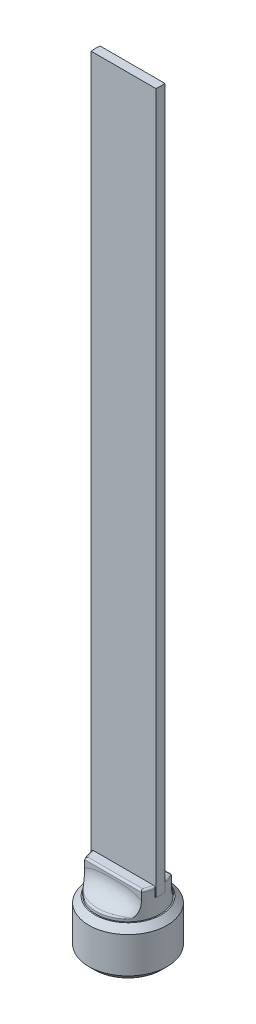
ISO-10303-21;
HEADER;
FILE_DESCRIPTION(('STEP AP214'),'2;1');
FILE_NAME('part.step','',(''),(''),'','','');
FILE_SCHEMA(('AUTOMOTIVE_DESIGN { 1 0 10303 214 1 1 1 1 }'));
ENDSEC;
DATA;
#1=APPLICATION_CONTEXT('core data for automotive mechanical design processes');
#2=APPLICATION_PROTOCOL_DEFINITION('international standard','automotive_design',2000,#1);
#3=PRODUCT_CONTEXT('',#1,'mechanical');
#4=PRODUCT('Part','Part','',(#3));
#5=PRODUCT_RELATED_PRODUCT_CATEGORY('part','',(#4));
#6=PRODUCT_DEFINITION_FORMATION('','',#4);
#7=PRODUCT_DEFINITION_CONTEXT('part definition',#1,'design');
#8=PRODUCT_DEFINITION('design','',#6,#7);
#9=PRODUCT_DEFINITION_SHAPE('','',#8);
#10=(LENGTH_UNIT() NAMED_UNIT(*) SI_UNIT(.MILLI.,.METRE.));
#11=(NAMED_UNIT(*) PLANE_ANGLE_UNIT() SI_UNIT($,.RADIAN.));
#12=(NAMED_UNIT(*) SI_UNIT($,.STERADIAN.) SOLID_ANGLE_UNIT());
#13=UNCERTAINTY_MEASURE_WITH_UNIT(LENGTH_MEASURE(1.E-05),#10,'distance_accuracy_value','');
#14=(GEOMETRIC_REPRESENTATION_CONTEXT(3) GLOBAL_UNCERTAINTY_ASSIGNED_CONTEXT((#13)) GLOBAL_UNIT_ASSIGNED_CONTEXT((#10,
#11,#12)) REPRESENTATION_CONTEXT('',''));
#15=CARTESIAN_POINT('',(0.,0.,0.));
#16=DIRECTION('',(0.,0.,1.));
#17=DIRECTION('',(1.,0.,0.));
#18=AXIS2_PLACEMENT_3D('',#15,#16,#17);
#19=CARTESIAN_POINT('',(0.,13.081,0.));
#20=DIRECTION('',(0.,-1.,0.));
#21=DIRECTION('',(0.,0.,-1.));
#22=AXIS2_PLACEMENT_3D('',#19,#20,#21);
#23=PLANE('',#22);
#24=DIRECTION('',(-0.866025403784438,0.,0.5));
#25=VECTOR('',#24,1.);
#26=CARTESIAN_POINT('',(0.,13.081,-5.48459661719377));
#27=LINE('',#26,#25);
#28=CARTESIAN_POINT('',(-4.7498,13.081,-2.74229830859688));
#29=VERTEX_POINT('',#28);
#30=CARTESIAN_POINT('',(0.,13.081,-5.48459661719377));
#31=VERTEX_POINT('',#30);
#32=EDGE_CURVE('E495',#29,#31,#27,.F.);
#33=ORIENTED_EDGE('',*,*,#32,.T.);
#34=DIRECTION('',(-0.866025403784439,0.,-0.5));
#35=VECTOR('',#34,1.);
#36=CARTESIAN_POINT('',(4.7498,13.081,-2.74229830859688));
#37=LINE('',#36,#35);
#38=CARTESIAN_POINT('',(4.7498,13.081,-2.74229830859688));
#39=VERTEX_POINT('',#38);
#40=EDGE_CURVE('E492',#31,#39,#37,.F.);
#41=ORIENTED_EDGE('',*,*,#40,.T.);
#42=DIRECTION('',(0.,0.,-1.));
#43=VECTOR('',#42,1.);
#44=CARTESIAN_POINT('',(4.7498,13.081,2.74229830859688));
#45=LINE('',#44,#43);
#46=CARTESIAN_POINT('',(4.7498,13.081,2.74229830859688));
#47=VERTEX_POINT('',#46);
#48=EDGE_CURVE('E484',#39,#47,#45,.F.);
#49=ORIENTED_EDGE('',*,*,#48,.T.);
#50=DIRECTION('',(0.866025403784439,0.,-0.5));
#51=VECTOR('',#50,1.);
#52=CARTESIAN_POINT('',(0.,13.081,5.48459661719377));
#53=LINE('',#52,#51);
#54=CARTESIAN_POINT('',(0.,13.081,5.48459661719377));
#55=VERTEX_POINT('',#54);
#56=EDGE_CURVE('E483',#47,#55,#53,.F.);
#57=ORIENTED_EDGE('',*,*,#56,.T.);
#58=DIRECTION('',(0.866025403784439,0.,0.5));
#59=VECTOR('',#58,1.);
#60=CARTESIAN_POINT('',(-4.7498,13.081,2.74229830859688));
#61=LINE('',#60,#59);
#62=CARTESIAN_POINT('',(-4.7498,13.081,2.74229830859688));
#63=VERTEX_POINT('',#62);
#64=EDGE_CURVE('E163',#55,#63,#61,.F.);
#65=ORIENTED_EDGE('',*,*,#64,.T.);
#66=DIRECTION('',(0.,0.,1.));
#67=VECTOR('',#66,1.);
#68=CARTESIAN_POINT('',(-4.7498,13.081,-2.74229830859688));
#69=LINE('',#68,#67);
#70=EDGE_CURVE('E162',#63,#29,#69,.F.);
#71=ORIENTED_EDGE('',*,*,#70,.T.);
#72=EDGE_LOOP('',(#33,#41,#49,#57,#65,#71));
#73=FACE_BOUND('',#72,.T.);
#74=ADVANCED_FACE('F35',(#73),#23,.T.);
#75=CARTESIAN_POINT('',(-4.7498,0.,2.74229830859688));
#76=DIRECTION('',(-0.5,0.,0.866025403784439));
#77=DIRECTION('',(0.866025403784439,0.,0.5));
#78=AXIS2_PLACEMENT_3D('',#75,#76,#77);
#79=PLANE('',#78);
#80=DIRECTION('',(0.,1.,0.));
#81=VECTOR('',#80,1.);
#82=CARTESIAN_POINT('',(-4.7498,0.,2.74229830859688));
#83=LINE('',#82,#81);
#84=CARTESIAN_POINT('',(-4.74979996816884,0.128803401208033,2.74229832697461));
#85=VERTEX_POINT('',#84);
#86=EDGE_CURVE('E152',#85,#63,#83,.T.);
#87=ORIENTED_EDGE('',*,*,#86,.T.);
#88=ORIENTED_EDGE('',*,*,#64,.F.);
#89=DIRECTION('',(0.,1.,0.));
#90=VECTOR('',#89,1.);
#91=CARTESIAN_POINT('',(0.,0.,5.48459661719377));
#92=LINE('',#91,#90);
#93=CARTESIAN_POINT('',(3.18339009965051E-08,0.128803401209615,5.48459659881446));
#94=VERTEX_POINT('',#93);
#95=EDGE_CURVE('E146',#55,#94,#92,.F.);
#96=ORIENTED_EDGE('',*,*,#95,.T.);
#97=CARTESIAN_POINT('',(2.4510609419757E-08,0.128803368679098,5.48459663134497));
#98=CARTESIAN_POINT('',(-0.0816649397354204,0.175945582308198,5.43744734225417));
#99=CARTESIAN_POINT('',(-0.163957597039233,0.221640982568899,5.38993565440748));
#100=CARTESIAN_POINT('',(-0.329921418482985,0.309698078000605,5.29411639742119));
#101=CARTESIAN_POINT('',(-0.413593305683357,0.352057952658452,5.24580841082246));
#102=CARTESIAN_POINT('',(-0.667639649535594,0.47383531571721,5.09913468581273));
#103=CARTESIAN_POINT('',(-0.840164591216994,0.547431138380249,4.99952736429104));
#104=CARTESIAN_POINT('',(-1.18807481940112,0.673458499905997,4.79866130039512));
#105=CARTESIAN_POINT('',(-1.36337120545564,0.726207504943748,4.69745388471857));
#106=CARTESIAN_POINT('',(-1.629197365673,0.787224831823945,4.54397907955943));
#107=CARTESIAN_POINT('',(-1.71819741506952,0.804538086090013,4.49259487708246));
#108=CARTESIAN_POINT('',(-1.89695098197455,0.832737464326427,4.38939145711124));
#109=CARTESIAN_POINT('',(-1.98670438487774,0.843624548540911,4.3375723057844));
#110=CARTESIAN_POINT('',(-2.20542887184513,0.861878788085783,4.21129166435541));
#111=CARTESIAN_POINT('',(-2.33463563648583,0.865708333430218,4.13669410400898));
#112=CARTESIAN_POINT('',(-2.59281620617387,0.859277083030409,3.98763348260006));
#113=CARTESIAN_POINT('',(-2.72178991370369,0.849011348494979,3.91317047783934));
#114=CARTESIAN_POINT('',(-2.97852129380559,0.814994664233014,3.76494654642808));
#115=CARTESIAN_POINT('',(-3.10627744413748,0.79122863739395,3.69118649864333));
#116=CARTESIAN_POINT('',(-3.3595938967,0.731503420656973,3.5449341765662));
#117=CARTESIAN_POINT('',(-3.48515436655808,0.695545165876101,3.47244180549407));
#118=CARTESIAN_POINT('',(-3.7080314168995,0.62157336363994,3.34376368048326));
#119=CARTESIAN_POINT('',(-3.80584181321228,0.58550635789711,3.28729282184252));
#120=CARTESIAN_POINT('',(-3.99970706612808,0.507561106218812,3.17536466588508));
#121=CARTESIAN_POINT('',(-4.09576186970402,0.465682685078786,3.11990739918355));
#122=CARTESIAN_POINT('',(-4.28581337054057,0.377053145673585,3.01018111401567));
#123=CARTESIAN_POINT('',(-4.37981547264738,0.33031735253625,2.95590897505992));
#124=CARTESIAN_POINT('',(-4.56607930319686,0.232586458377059,2.84836950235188));
#125=CARTESIAN_POINT('',(-4.6583420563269,0.181593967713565,2.79510157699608));
#126=CARTESIAN_POINT('',(-4.74979993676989,0.128803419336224,2.7422983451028));
#127=B_SPLINE_CURVE_WITH_KNOTS('',3,(#97,#98,#99,#100,#101,#102,#103,#104,#105,#106,#107,#108,
#109,#110,#111,#112,#113,#114,#115,#116,#117,#118,#119,#120,#121,#122,#123,#124,#125,#126),
.UNSPECIFIED.,.F.,.F.,(4,2,2,2,2,2,2,2,2,2,2,2,2,2,4),(0.,0.31625904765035,0.632689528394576,
1.26896606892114,1.89514068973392,2.20761402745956,2.52004066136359,2.96707777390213,
3.41427156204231,3.86196576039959,4.30962562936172,4.66514117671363,5.02066744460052,
5.37510423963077,5.72932525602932),.UNSPECIFIED.);
#128=EDGE_CURVE('E42',#94,#85,#127,.T.);
#129=ORIENTED_EDGE('',*,*,#128,.T.);
#130=EDGE_LOOP('',(#87,#88,#96,#129));
#131=FACE_BOUND('',#130,.T.);
#132=ADVANCED_FACE('F151',(#131),#79,.F.);
#133=CARTESIAN_POINT('',(-4.7498,0.,-2.74229830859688));
#134=DIRECTION('',(-1.,0.,0.));
#135=DIRECTION('',(0.,0.,1.));
#136=AXIS2_PLACEMENT_3D('',#133,#134,#135);
#137=PLANE('',#136);
#138=DIRECTION('',(0.,1.,0.));
#139=VECTOR('',#138,1.);
#140=CARTESIAN_POINT('',(-4.7498,0.,-2.74229830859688));
#141=LINE('',#140,#139);
#142=CARTESIAN_POINT('',(-4.7498,0.128803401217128,-2.74229827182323));
#143=VERTEX_POINT('',#142);
#144=EDGE_CURVE('E496',#143,#29,#141,.T.);
#145=ORIENTED_EDGE('',*,*,#144,.T.);
#146=ORIENTED_EDGE('',*,*,#70,.F.);
#147=ORIENTED_EDGE('',*,*,#86,.F.);
#148=CARTESIAN_POINT('',(-4.7498,0.12880336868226,2.74229833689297));
#149=CARTESIAN_POINT('',(-4.7498,0.175945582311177,2.64799975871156));
#150=CARTESIAN_POINT('',(-4.7498,0.221640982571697,2.5529763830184));
#151=CARTESIAN_POINT('',(-4.7498,0.309698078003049,2.36133786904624));
#152=CARTESIAN_POINT('',(-4.7498,0.352057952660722,2.26472189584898));
#153=CARTESIAN_POINT('',(-4.7498,0.47383531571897,1.97137444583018));
#154=CARTESIAN_POINT('',(-4.7498,0.547431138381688,1.77215980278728));
#155=CARTESIAN_POINT('',(-4.7498,0.673458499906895,1.3704276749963));
#156=CARTESIAN_POINT('',(-4.7498,0.726207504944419,1.16801284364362));
#157=CARTESIAN_POINT('',(-4.7498,0.787224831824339,0.861063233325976));
#158=CARTESIAN_POINT('',(-4.7498,0.804538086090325,0.758294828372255));
#159=CARTESIAN_POINT('',(-4.7498,0.832737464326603,0.551887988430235));
#160=CARTESIAN_POINT('',(-4.7498,0.843624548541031,0.448249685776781));
#161=CARTESIAN_POINT('',(-4.7498,0.861878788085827,0.195688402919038));
#162=CARTESIAN_POINT('',(-4.7498,0.865708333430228,0.0464932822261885));
#163=CARTESIAN_POINT('',(-4.7498,0.85927708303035,-0.251627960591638));
#164=CARTESIAN_POINT('',(-4.7498,0.849011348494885,-0.400553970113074));
#165=CARTESIAN_POINT('',(-4.7498,0.814994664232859,-0.697001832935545));
#166=CARTESIAN_POINT('',(-4.7498,0.79122863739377,-0.844521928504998));
#167=CARTESIAN_POINT('',(-4.7498,0.731503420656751,-1.13702657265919));
#168=CARTESIAN_POINT('',(-4.7498,0.695545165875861,-1.28201131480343));
#169=CARTESIAN_POINT('',(-4.7498,0.621573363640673,-1.53936756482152));
#170=CARTESIAN_POINT('',(-4.7498,0.585506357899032,-1.65230928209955));
#171=CARTESIAN_POINT('',(-4.7498,0.507561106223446,-1.87616559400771));
#172=CARTESIAN_POINT('',(-4.7498,0.465682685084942,-1.98708012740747));
#173=CARTESIAN_POINT('',(-4.7498,0.377053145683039,-2.20653269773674));
#174=CARTESIAN_POINT('',(-4.7498,0.330317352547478,-2.31507697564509));
#175=CARTESIAN_POINT('',(-4.7498,0.232586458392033,-2.53015592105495));
#176=CARTESIAN_POINT('',(-4.7498,0.181593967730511,-2.63669177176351));
#177=CARTESIAN_POINT('',(-4.7498,0.128803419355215,-2.74229823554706));
#178=B_SPLINE_CURVE_WITH_KNOTS('',3,(#148,#149,#150,#151,#152,#153,#154,#155,#156,#157,#158,
#159,#160,#161,#162,#163,#164,#165,#166,#167,#168,#169,#170,#171,#172,#173,#174,#175,#176,#177),
.UNSPECIFIED.,.F.,.F.,(4,2,2,2,2,2,2,2,2,2,2,2,2,2,4),(0.,0.316259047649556,0.632689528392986,
1.26896606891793,1.89514068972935,2.20761402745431,2.52004066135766,2.96707777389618,
3.41427156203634,3.86196576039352,4.30962562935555,4.66514117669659,5.02066744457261,
5.37510423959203,5.72932525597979),.UNSPECIFIED.);
#179=EDGE_CURVE('E157',#85,#143,#178,.T.);
#180=ORIENTED_EDGE('',*,*,#179,.T.);
#181=EDGE_LOOP('',(#145,#146,#147,#180));
#182=FACE_BOUND('',#181,.T.);
#183=ADVANCED_FACE('F160',(#182),#137,.F.);
#184=CARTESIAN_POINT('',(0.,0.,-5.48459661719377));
#185=DIRECTION('',(-0.5,0.,-0.866025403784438));
#186=DIRECTION('',(-0.866025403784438,0.,0.5));
#187=AXIS2_PLACEMENT_3D('',#184,#185,#186);
#188=PLANE('',#187);
#189=DIRECTION('',(0.,1.,0.));
#190=VECTOR('',#189,1.);
#191=CARTESIAN_POINT('',(0.,0.,-5.48459661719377));
#192=LINE('',#191,#190);
#193=CARTESIAN_POINT('',(0.,0.128803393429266,-5.4845966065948));
#194=VERTEX_POINT('',#193);
#195=EDGE_CURVE('E493',#194,#31,#192,.T.);
#196=ORIENTED_EDGE('',*,*,#195,.T.);
#197=ORIENTED_EDGE('',*,*,#32,.F.);
#198=ORIENTED_EDGE('',*,*,#144,.F.);
#199=CARTESIAN_POINT('',(-4.74980002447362,0.12880336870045,-2.74229829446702));
#200=CARTESIAN_POINT('',(-4.66813506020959,0.175945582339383,-2.78944758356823));
#201=CARTESIAN_POINT('',(-4.5858424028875,0.221640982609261,-2.83695927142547));
#202=CARTESIAN_POINT('',(-4.41987858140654,0.309698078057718,-2.93277852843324));
#203=CARTESIAN_POINT('',(-4.33620669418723,0.352057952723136,-2.98108651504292));
#204=CARTESIAN_POINT('',(-4.08216035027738,0.473835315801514,-3.1277602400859));
#205=CARTESIAN_POINT('',(-3.90963540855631,0.547431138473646,-3.22736756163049));
#206=CARTESIAN_POINT('',(-3.56172518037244,0.673458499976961,-3.42823362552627));
#207=CARTESIAN_POINT('',(-3.38642879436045,0.726207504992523,-3.52944104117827));
#208=CARTESIAN_POINT('',(-3.12060263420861,0.787224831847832,-3.68291584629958));
#209=CARTESIAN_POINT('',(-3.03160258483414,0.804538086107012,-3.73430004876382));
#210=CARTESIAN_POINT('',(-2.85284901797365,0.832737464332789,-3.83750346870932));
#211=CARTESIAN_POINT('',(-2.76309561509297,0.84362454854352,-3.88932262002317));
#212=CARTESIAN_POINT('',(-2.54437112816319,0.861878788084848,-4.01560326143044));
#213=CARTESIAN_POINT('',(-2.41516436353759,0.8657083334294,-4.09020082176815));
#214=CARTESIAN_POINT('',(-2.15698379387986,0.85927708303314,-4.23926144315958));
#215=CARTESIAN_POINT('',(-2.02801008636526,0.849011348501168,-4.31372444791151));
#216=CARTESIAN_POINT('',(-1.77127870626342,0.814994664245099,-4.46194837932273));
#217=CARTESIAN_POINT('',(-1.64352255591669,0.79122863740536,-4.53570842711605));
#218=CARTESIAN_POINT('',(-1.39020610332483,0.731503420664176,-4.68196074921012));
#219=CARTESIAN_POINT('',(-1.26464563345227,0.695545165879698,-4.75445312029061));
#220=CARTESIAN_POINT('',(-1.04176857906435,0.621573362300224,-4.88313124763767));
#221=CARTESIAN_POINT('',(-0.943958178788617,0.585506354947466,-4.93960210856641));
#222=CARTESIAN_POINT('',(-0.750092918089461,0.507561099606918,-5.05153026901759));
#223=CARTESIAN_POINT('',(-0.654038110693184,0.465682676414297,-5.10698753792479));
#224=CARTESIAN_POINT('',(-0.463986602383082,0.377053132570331,-5.21671382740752));
#225=CARTESIAN_POINT('',(-0.369984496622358,0.330317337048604,-5.27098596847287));
#226=CARTESIAN_POINT('',(-0.18372065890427,0.232586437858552,-5.3785254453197));
#227=CARTESIAN_POINT('',(-0.0914579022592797,0.181593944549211,-5.43179337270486));
#228=CARTESIAN_POINT('',(-1.83579513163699E-08,0.128803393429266,-5.4845966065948));
#229=B_SPLINE_CURVE_WITH_KNOTS('',3,(#199,#200,#201,#202,#203,#204,#205,#206,#207,#208,#209,
#210,#211,#212,#213,#214,#215,#216,#217,#218,#219,#220,#221,#222,#223,#224,#225,#226,#227,#228),
.UNSPECIFIED.,.F.,.F.,(4,2,2,2,2,2,2,2,2,2,2,2,2,2,4),(0.,0.316259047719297,0.632689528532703,
1.26896606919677,1.89514068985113,2.20761402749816,2.52004066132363,2.9670777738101,
3.41427156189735,3.86196576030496,4.30962562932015,4.66514119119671,5.02066747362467,
5.37510428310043,5.72932531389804),.UNSPECIFIED.);
#230=EDGE_CURVE('E169',#143,#194,#229,.T.);
#231=ORIENTED_EDGE('',*,*,#230,.T.);
#232=EDGE_LOOP('',(#196,#197,#198,#231));
#233=FACE_BOUND('',#232,.T.);
#234=ADVANCED_FACE('F221',(#233),#188,.F.);
#235=CARTESIAN_POINT('',(4.7498,0.,-2.74229830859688));
#236=DIRECTION('',(0.5,0.,-0.866025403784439));
#237=DIRECTION('',(-0.866025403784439,0.,-0.5));
#238=AXIS2_PLACEMENT_3D('',#235,#236,#237);
#239=PLANE('',#238);
#240=DIRECTION('',(0.,1.,0.));
#241=VECTOR('',#240,1.);
#242=CARTESIAN_POINT('',(4.7498,0.,-2.74229830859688));
#243=LINE('',#242,#241);
#244=CARTESIAN_POINT('',(4.74980001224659,0.128803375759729,-2.74229830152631));
#245=VERTEX_POINT('',#244);
#246=EDGE_CURVE('E482',#245,#39,#243,.T.);
#247=ORIENTED_EDGE('',*,*,#246,.T.);
#248=ORIENTED_EDGE('',*,*,#40,.F.);
#249=ORIENTED_EDGE('',*,*,#195,.F.);
#250=CARTESIAN_POINT('',(1.83579460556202E-08,0.128803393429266,-5.4845966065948));
#251=CARTESIAN_POINT('',(0.0816649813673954,0.175945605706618,-5.43744731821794));
#252=CARTESIAN_POINT('',(0.163957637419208,0.221641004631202,-5.38993563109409));
#253=CARTESIAN_POINT('',(0.329921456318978,0.309698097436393,-5.29411637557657));
#254=CARTESIAN_POINT('',(0.413593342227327,0.352057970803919,-5.24580838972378));
#255=CARTESIAN_POINT('',(0.667639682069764,0.473835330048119,-5.09913466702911));
#256=CARTESIAN_POINT('',(0.84016462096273,0.547431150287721,-4.99952734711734));
#257=CARTESIAN_POINT('',(1.18807484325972,0.673458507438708,-4.79866128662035));
#258=CARTESIAN_POINT('',(1.36337122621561,0.726207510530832,-4.6974538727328));
#259=CARTESIAN_POINT('',(1.62919738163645,0.787224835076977,-4.54397907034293));
#260=CARTESIAN_POINT('',(1.71819742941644,0.804538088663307,-4.49259486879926));
#261=CARTESIAN_POINT('',(1.89695099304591,0.832737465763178,-4.38939145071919));
#262=CARTESIAN_POINT('',(1.98670439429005,0.843624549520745,-4.3375723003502));
#263=CARTESIAN_POINT('',(2.20542887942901,0.861878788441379,-4.21129165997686));
#264=CARTESIAN_POINT('',(2.33463564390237,0.865708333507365,-4.13669409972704));
#265=CARTESIAN_POINT('',(2.59281621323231,0.859277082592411,-3.98763347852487));
#266=CARTESIAN_POINT('',(2.72178992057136,0.849011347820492,-3.91317047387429));
#267=CARTESIAN_POINT('',(2.97852130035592,0.814994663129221,-3.76494654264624));
#268=CARTESIAN_POINT('',(3.10627745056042,0.791228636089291,-3.69118649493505));
#269=CARTESIAN_POINT('',(3.35959390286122,0.73150341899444,-3.54493417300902));
#270=CARTESIAN_POINT('',(3.48515437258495,0.695545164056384,-3.47244180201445));
#271=CARTESIAN_POINT('',(3.70803143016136,0.621573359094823,-3.34376367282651));
#272=CARTESIAN_POINT('',(3.80584183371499,0.585506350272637,-3.28729281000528));
#273=CARTESIAN_POINT('',(3.99970710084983,0.507561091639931,-3.17536464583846));
#274=CARTESIAN_POINT('',(4.09576191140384,0.465682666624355,-3.11990737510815));
#275=CARTESIAN_POINT('',(4.28581342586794,0.377053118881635,-3.0101810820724));
#276=CARTESIAN_POINT('',(4.37981553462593,0.330317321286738,-2.95590893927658));
#277=CARTESIAN_POINT('',(4.56607937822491,0.232586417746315,-2.84836945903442));
#278=CARTESIAN_POINT('',(4.65834213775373,0.181593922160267,-2.79510152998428));
#279=CARTESIAN_POINT('',(4.74980002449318,0.128803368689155,-2.74229829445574));
#280=B_SPLINE_CURVE_WITH_KNOTS('',3,(#250,#251,#252,#253,#254,#255,#256,#257,#258,#259,#260,
#261,#262,#263,#264,#265,#266,#267,#268,#269,#270,#271,#272,#273,#274,#275,#276,#277,#278,#279),
.UNSPECIFIED.,.F.,.F.,(4,2,2,2,2,2,2,2,2,2,2,2,2,2,4),(0.,0.316259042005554,0.632689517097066,
1.26896604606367,1.89514065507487,2.20761398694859,2.52004061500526,2.96707772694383,
3.41427151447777,3.86196571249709,4.30962558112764,4.66514115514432,5.02066744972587,
5.37510427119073,5.72932531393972),.UNSPECIFIED.);
#281=EDGE_CURVE('E170',#194,#245,#280,.T.);
#282=ORIENTED_EDGE('',*,*,#281,.T.);
#283=EDGE_LOOP('',(#247,#248,#249,#282));
#284=FACE_BOUND('',#283,.T.);
#285=ADVANCED_FACE('F217',(#284),#239,.F.);
#286=CARTESIAN_POINT('',(4.7498,0.,2.74229830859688));
#287=DIRECTION('',(1.,0.,0.));
#288=DIRECTION('',(0.,0.,-1.));
#289=AXIS2_PLACEMENT_3D('',#286,#287,#288);
#290=PLANE('',#289);
#291=DIRECTION('',(0.,1.,0.));
#292=VECTOR('',#291,1.);
#293=CARTESIAN_POINT('',(4.7498,0.,2.74229830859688));
#294=LINE('',#293,#292);
#295=CARTESIAN_POINT('',(4.7498,0.12880340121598,2.74229827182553));
#296=VERTEX_POINT('',#295);
#297=EDGE_CURVE('E479',#296,#47,#294,.T.);
#298=ORIENTED_EDGE('',*,*,#297,.T.);
#299=ORIENTED_EDGE('',*,*,#48,.F.);
#300=ORIENTED_EDGE('',*,*,#246,.F.);
#301=CARTESIAN_POINT('',(4.74980000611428,0.12880342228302,-2.742298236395));
#302=CARTESIAN_POINT('',(4.74980000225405,0.1759456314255,-2.64799966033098));
#303=CARTESIAN_POINT('',(4.74980000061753,0.221641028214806,-2.55297628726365));
#304=CARTESIAN_POINT('',(4.74979999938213,0.3096981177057,-2.36133777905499));
#305=CARTESIAN_POINT('',(4.74979999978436,0.352057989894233,-2.26472180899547));
#306=CARTESIAN_POINT('',(4.74980000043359,0.473835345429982,-1.97137436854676));
#307=CARTESIAN_POINT('',(4.74980000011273,0.547431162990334,-1.7721597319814));
#308=CARTESIAN_POINT('',(4.74979999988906,0.673458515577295,-1.37042761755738));
#309=CARTESIAN_POINT('',(4.7497999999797,0.726207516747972,-1.16801279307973));
#310=CARTESIAN_POINT('',(4.74980000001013,0.787224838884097,-0.861063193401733));
#311=CARTESIAN_POINT('',(4.74980000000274,0.804538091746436,-0.758294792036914));
#312=CARTESIAN_POINT('',(4.74979999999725,0.832737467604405,-0.551887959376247));
#313=CARTESIAN_POINT('',(4.74979999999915,0.843624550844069,-0.448249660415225));
#314=CARTESIAN_POINT('',(4.74980000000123,0.86187878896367,-0.195688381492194));
#315=CARTESIAN_POINT('',(4.74980000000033,0.865708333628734,-0.0464932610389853));
#316=CARTESIAN_POINT('',(4.74979999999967,0.859277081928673,0.251627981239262));
#317=CARTESIAN_POINT('',(4.74979999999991,0.8490113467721,0.400553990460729));
#318=CARTESIAN_POINT('',(4.74980000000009,0.814994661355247,0.697001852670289));
#319=CARTESIAN_POINT('',(4.74980000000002,0.791228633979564,0.844521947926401));
#320=CARTESIAN_POINT('',(4.74979999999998,0.731503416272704,1.1370265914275));
#321=CARTESIAN_POINT('',(4.74979999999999,0.695545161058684,1.28201133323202));
#322=CARTESIAN_POINT('',(4.7498,0.621573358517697,1.53936758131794));
#323=CARTESIAN_POINT('',(4.7498,0.585506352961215,1.65230929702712));
#324=CARTESIAN_POINT('',(4.7498,0.507561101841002,1.87616560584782));
#325=CARTESIAN_POINT('',(4.7498,0.465682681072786,1.987080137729));
#326=CARTESIAN_POINT('',(4.7498,0.377053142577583,2.20653270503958));
#327=CARTESIAN_POINT('',(4.7498,0.330317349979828,2.3150769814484));
#328=CARTESIAN_POINT('',(4.7498,0.232586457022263,2.53015592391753));
#329=CARTESIAN_POINT('',(4.7498,0.181593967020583,2.6366917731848));
#330=CARTESIAN_POINT('',(4.7498,0.128803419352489,2.74229823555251));
#331=B_SPLINE_CURVE_WITH_KNOTS('',3,(#301,#302,#303,#304,#305,#306,#307,#308,#309,#310,#311,
#312,#313,#314,#315,#316,#317,#318,#319,#320,#321,#322,#323,#324,#325,#326,#327,#328,#329,#330),
.UNSPECIFIED.,.F.,.F.,(4,2,2,2,2,2,2,2,2,2,2,2,2,2,4),(0.,0.316259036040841,0.632689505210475,
1.26896602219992,1.89514062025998,2.20761394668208,2.52004056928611,2.96707768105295,
3.41427146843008,3.86196566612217,4.3096255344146,4.66514107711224,5.0206673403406,
5.37510413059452,5.72932514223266),.UNSPECIFIED.);
#332=EDGE_CURVE('E207',#245,#296,#331,.T.);
#333=ORIENTED_EDGE('',*,*,#332,.T.);
#334=EDGE_LOOP('',(#298,#299,#300,#333));
#335=FACE_BOUND('',#334,.T.);
#336=ADVANCED_FACE('F220',(#335),#290,.F.);
#337=CARTESIAN_POINT('',(0.,0.,5.48459661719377));
#338=DIRECTION('',(0.5,0.,0.866025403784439));
#339=DIRECTION('',(0.866025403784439,0.,-0.5));
#340=AXIS2_PLACEMENT_3D('',#337,#338,#339);
#341=PLANE('',#340);
#342=ORIENTED_EDGE('',*,*,#95,.F.);
#343=ORIENTED_EDGE('',*,*,#56,.F.);
#344=ORIENTED_EDGE('',*,*,#297,.F.);
#345=CARTESIAN_POINT('',(4.74980002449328,0.128803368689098,2.74229829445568));
#346=CARTESIAN_POINT('',(4.66813506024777,0.175945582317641,2.78944758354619));
#347=CARTESIAN_POINT('',(4.58584240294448,0.221640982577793,2.83695927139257));
#348=CARTESIAN_POINT('',(4.41987858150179,0.30969807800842,2.93277852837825));
#349=CARTESIAN_POINT('',(4.33620669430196,0.352057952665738,2.98108651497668));
#350=CARTESIAN_POINT('',(4.0821603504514,0.473835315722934,3.12776023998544));
#351=CARTESIAN_POINT('',(3.90963540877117,0.547431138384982,3.22736756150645));
#352=CARTESIAN_POINT('',(3.56172518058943,0.673458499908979,3.428233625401));
#353=CARTESIAN_POINT('',(3.38642879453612,0.726207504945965,3.52944104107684));
#354=CARTESIAN_POINT('',(3.12060263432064,0.787224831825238,3.68291584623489));
#355=CARTESIAN_POINT('',(3.03160258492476,0.804538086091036,3.7343000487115));
#356=CARTESIAN_POINT('',(2.85284901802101,0.832737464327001,3.83750346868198));
#357=CARTESIAN_POINT('',(2.76309561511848,0.843624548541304,3.88932262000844));
#358=CARTESIAN_POINT('',(2.54437112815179,0.861878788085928,4.01560326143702));
#359=CARTESIAN_POINT('',(2.41516436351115,0.865708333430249,4.09020082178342));
#360=CARTESIAN_POINT('',(2.15698379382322,0.859277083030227,4.23926144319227));
#361=CARTESIAN_POINT('',(2.02801008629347,0.849011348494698,4.31372444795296));
#362=CARTESIAN_POINT('',(1.77127870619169,0.814994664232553,4.46194837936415));
#363=CARTESIAN_POINT('',(1.64352255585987,0.791228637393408,4.53570842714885));
#364=CARTESIAN_POINT('',(1.39020610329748,0.731503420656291,4.68196074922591));
#365=CARTESIAN_POINT('',(1.26464563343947,0.695545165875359,4.75445312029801));
#366=CARTESIAN_POINT('',(1.0417685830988,0.621573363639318,4.88313124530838));
#367=CARTESIAN_POINT('',(0.943958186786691,0.585506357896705,4.93960210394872));
#368=CARTESIAN_POINT('',(0.750092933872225,0.507561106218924,5.0515302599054));
#369=CARTESIAN_POINT('',(0.65403813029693,0.465682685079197,5.10698752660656));
#370=CARTESIAN_POINT('',(0.463986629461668,0.37705314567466,5.21671381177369));
#371=CARTESIAN_POINT('',(0.369984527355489,0.330317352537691,5.27098595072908));
#372=CARTESIAN_POINT('',(0.183720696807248,0.232586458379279,5.3785254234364));
#373=CARTESIAN_POINT('',(0.0914579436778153,0.181593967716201,5.43179334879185));
#374=CARTESIAN_POINT('',(6.32354279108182E-08,0.128803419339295,5.48459658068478));
#375=B_SPLINE_CURVE_WITH_KNOTS('',3,(#345,#346,#347,#348,#349,#350,#351,#352,#353,#354,#355,
#356,#357,#358,#359,#360,#361,#362,#363,#364,#365,#366,#367,#368,#369,#370,#371,#372,#373,#374),
.UNSPECIFIED.,.F.,.F.,(4,2,2,2,2,2,2,2,2,2,2,2,2,2,4),(0.,0.316259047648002,0.632689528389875,
1.26896606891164,1.89514068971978,2.20761402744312,2.52004066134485,2.9670777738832,
3.41427156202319,3.86196576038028,4.30962562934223,4.66514117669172,5.02066744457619,
5.37510423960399,5.7293252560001),.UNSPECIFIED.);
#376=EDGE_CURVE('E199',#296,#94,#375,.T.);
#377=ORIENTED_EDGE('',*,*,#376,.T.);
#378=EDGE_LOOP('',(#342,#343,#344,#377));
#379=FACE_BOUND('',#378,.T.);
#380=ADVANCED_FACE('F189',(#379),#341,.F.);
#381=CARTESIAN_POINT('',(0.,1.13685646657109E-10,0.));
#382=DIRECTION('',(0.,-1.,0.));
#383=DIRECTION('',(0.,0.,-1.));
#384=AXIS2_PLACEMENT_3D('',#381,#382,#383);
#385=CONICAL_SURFACE('',#384,5.61339999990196,0.785398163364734);
#386=CARTESIAN_POINT('',(0.,5.6843742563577E-11,0.));
#387=DIRECTION('',(0.,-1.,0.));
#388=DIRECTION('',(0.,0.,-1.));
#389=AXIS2_PLACEMENT_3D('',#386,#387,#388);
#390=CIRCLE('',#389,5.6133999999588);
#391=CARTESIAN_POINT('',(0.,5.684255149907E-11,-5.6133999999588));
#392=VERTEX_POINT('',#391);
#393=EDGE_CURVE('E469',#392,#392,#390,.F.);
#394=ORIENTED_EDGE('',*,*,#393,.F.);
#395=EDGE_LOOP('',(#394));
#396=FACE_BOUND('',#395,.T.);
#397=ORIENTED_EDGE('',*,*,#332,.F.);
#398=ORIENTED_EDGE('',*,*,#281,.F.);
#399=ORIENTED_EDGE('',*,*,#230,.F.);
#400=ORIENTED_EDGE('',*,*,#179,.F.);
#401=ORIENTED_EDGE('',*,*,#128,.F.);
#402=ORIENTED_EDGE('',*,*,#376,.F.);
#403=EDGE_LOOP('',(#397,#398,#399,#400,#401,#402));
#404=FACE_BOUND('',#403,.T.);
#405=ADVANCED_FACE('F167',(#396,#404),#385,.F.);
#406=CARTESIAN_POINT('',(0.,0.,-4.7244));
#407=DIRECTION('',(0.,-1.,0.));
#408=DIRECTION('',(0.,0.,-1.));
#409=AXIS2_PLACEMENT_3D('',#406,#407,#408);
#410=PLANE('',#409);
#411=ORIENTED_EDGE('',*,*,#393,.T.);
#412=EDGE_LOOP('',(#411));
#413=FACE_BOUND('',#412,.T.);
#414=CARTESIAN_POINT('',(0.,0.,0.));
#415=DIRECTION('',(0.,1.,0.));
#416=DIRECTION('',(0.,0.,1.));
#417=AXIS2_PLACEMENT_3D('',#414,#415,#416);
#418=CIRCLE('',#417,8.8138);
#419=CARTESIAN_POINT('',(0.,0.,8.8138));
#420=VERTEX_POINT('',#419);
#421=EDGE_CURVE('E466',#420,#420,#418,.T.);
#422=ORIENTED_EDGE('',*,*,#421,.F.);
#423=EDGE_LOOP('',(#422));
#424=FACE_BOUND('',#423,.T.);
#425=ADVANCED_FACE('F188',(#413,#424),#410,.T.);
#426=CARTESIAN_POINT('',(0.,1.5927,0.));
#427=DIRECTION('',(0.,1.,0.));
#428=DIRECTION('',(0.,0.,1.));
#429=AXIS2_PLACEMENT_3D('',#426,#427,#428);
#430=CONICAL_SURFACE('',#429,10.4065,0.785398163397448);
#431=CARTESIAN_POINT('',(0.,1.5927,0.));
#432=DIRECTION('',(0.,-1.,0.));
#433=DIRECTION('',(0.,0.,-1.));
#434=AXIS2_PLACEMENT_3D('',#431,#432,#433);
#435=CIRCLE('',#434,10.4065);
#436=CARTESIAN_POINT('',(0.,1.5927,-10.4065));
#437=VERTEX_POINT('',#436);
#438=EDGE_CURVE('E468',#437,#437,#435,.F.);
#439=ORIENTED_EDGE('',*,*,#438,.F.);
#440=EDGE_LOOP('',(#439));
#441=FACE_BOUND('',#440,.T.);
#442=ORIENTED_EDGE('',*,*,#421,.T.);
#443=EDGE_LOOP('',(#442));
#444=FACE_BOUND('',#443,.T.);
#445=ADVANCED_FACE('F776',(#441,#444),#430,.T.);
#446=CARTESIAN_POINT('',(0.,6.35,0.));
#447=DIRECTION('',(0.,-1.,0.));
#448=DIRECTION('',(0.,0.,-1.));
#449=AXIS2_PLACEMENT_3D('',#446,#447,#448);
#450=CYLINDRICAL_SURFACE('',#449,10.4065);
#451=CARTESIAN_POINT('',(0.,11.1073,0.));
#452=DIRECTION('',(0.,-1.,0.));
#453=DIRECTION('',(0.,0.,1.));
#454=AXIS2_PLACEMENT_3D('',#451,#452,#453);
#455=CIRCLE('',#454,10.4065);
#456=CARTESIAN_POINT('',(0.,11.1073,10.4065));
#457=VERTEX_POINT('',#456);
#458=EDGE_CURVE('E1182',#457,#457,#455,.F.);
#459=ORIENTED_EDGE('',*,*,#458,.F.);
#460=EDGE_LOOP('',(#459));
#461=FACE_BOUND('',#460,.T.);
#462=ORIENTED_EDGE('',*,*,#438,.T.);
#463=EDGE_LOOP('',(#462));
#464=FACE_BOUND('',#463,.T.);
#465=ADVANCED_FACE('F769',(#461,#464),#450,.T.);
#466=CARTESIAN_POINT('',(0.,11.1073,0.));
#467=DIRECTION('',(0.,-1.,0.));
#468=DIRECTION('',(0.,0.,-1.));
#469=AXIS2_PLACEMENT_3D('',#466,#467,#468);
#470=CONICAL_SURFACE('',#469,10.4065,0.785398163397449);
#471=CARTESIAN_POINT('',(0.,12.7,0.));
#472=DIRECTION('',(0.,-1.,0.));
#473=DIRECTION('',(0.,0.,-1.));
#474=AXIS2_PLACEMENT_3D('',#471,#472,#473);
#475=CIRCLE('',#474,8.8138);
#476=CARTESIAN_POINT('',(0.,12.7,-8.8138));
#477=VERTEX_POINT('',#476);
#478=EDGE_CURVE('E461',#477,#477,#475,.F.);
#479=ORIENTED_EDGE('',*,*,#478,.F.);
#480=EDGE_LOOP('',(#479));
#481=FACE_BOUND('',#480,.T.);
#482=ORIENTED_EDGE('',*,*,#458,.T.);
#483=EDGE_LOOP('',(#482));
#484=FACE_BOUND('',#483,.T.);
#485=ADVANCED_FACE('F761',(#481,#484),#470,.T.);
#486=CARTESIAN_POINT('',(0.,19.177,-3.4544));
#487=DIRECTION('',(-1.,0.,0.));
#488=DIRECTION('',(0.,0.,1.));
#489=AXIS2_PLACEMENT_3D('',#486,#487,#488);
#490=CYLINDRICAL_SURFACE('',#489,0.508);
#491=DIRECTION('',(1.,0.,0.));
#492=VECTOR('',#491,1.);
#493=CARTESIAN_POINT('',(0.,19.177,-3.9624));
#494=LINE('',#493,#492);
#495=CARTESIAN_POINT('',(7.53010406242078,19.177,-3.96240000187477));
#496=VERTEX_POINT('',#495);
#497=CARTESIAN_POINT('',(-7.53010406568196,19.177,-3.9624));
#498=VERTEX_POINT('',#497);
#499=EDGE_CURVE('E854',#496,#498,#494,.F.);
#500=ORIENTED_EDGE('',*,*,#499,.T.);
#501=CARTESIAN_POINT('',(-7.21686369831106,19.685,-3.45440000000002));
#502=CARTESIAN_POINT('',(-7.22289829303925,19.6850001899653,-3.46397850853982));
#503=CARTESIAN_POINT('',(-7.2289407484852,19.6847290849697,-3.47355225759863));
#504=CARTESIAN_POINT('',(-7.24086131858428,19.6836558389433,-3.49242388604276));
#505=CARTESIAN_POINT('',(-7.24673961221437,19.6828677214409,-3.50172245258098));
#506=CARTESIAN_POINT('',(-7.25831125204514,19.6808000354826,-3.52002935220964));
#507=CARTESIAN_POINT('',(-7.26400532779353,19.6795342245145,-3.52903877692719));
#508=CARTESIAN_POINT('',(-7.27519174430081,19.6765512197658,-3.54675451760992));
#509=CARTESIAN_POINT('',(-7.28068530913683,19.6748474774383,-3.55546232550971));
#510=CARTESIAN_POINT('',(-7.29145738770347,19.6710284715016,-3.57256369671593));
#511=CARTESIAN_POINT('',(-7.29673756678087,19.6689263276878,-3.58095914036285));
#512=CARTESIAN_POINT('',(-7.30707283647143,19.6643499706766,-3.59742625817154));
#513=CARTESIAN_POINT('',(-7.312129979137,19.661888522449,-3.60550019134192));
#514=CARTESIAN_POINT('',(-7.32201217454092,19.6566323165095,-3.62131632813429));
#515=CARTESIAN_POINT('',(-7.32683961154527,19.6538499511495,-3.62906115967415));
#516=CARTESIAN_POINT('',(-7.33625819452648,19.6479897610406,-3.64421261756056));
#517=CARTESIAN_POINT('',(-7.34085200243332,19.6449239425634,-3.65162223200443));
#518=CARTESIAN_POINT('',(-7.34980168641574,19.6385335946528,-3.66609818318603));
#519=CARTESIAN_POINT('',(-7.35416044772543,19.6352206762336,-3.67316786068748));
#520=CARTESIAN_POINT('',(-7.36264072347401,19.6283716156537,-3.68696017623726));
#521=CARTESIAN_POINT('',(-7.36676529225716,19.6248466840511,-3.6936865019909));
#522=CARTESIAN_POINT('',(-7.37477995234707,19.6176076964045,-3.70678957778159));
#523=CARTESIAN_POINT('',(-7.37867321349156,19.6139044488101,-3.71317035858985));
#524=CARTESIAN_POINT('',(-7.38622991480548,19.6063414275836,-3.7255809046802));
#525=CARTESIAN_POINT('',(-7.38989658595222,19.6024920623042,-3.7316150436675));
#526=CARTESIAN_POINT('',(-7.39700632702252,19.5946678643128,-3.74333197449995));
#527=CARTESIAN_POINT('',(-7.40045263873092,19.5907030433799,-3.7490194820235));
#528=CARTESIAN_POINT('',(-7.40712960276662,19.5826772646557,-3.76004343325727));
#529=CARTESIAN_POINT('',(-7.4103634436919,19.5786259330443,-3.76538495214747));
#530=CARTESIAN_POINT('',(-7.41662362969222,19.5704551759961,-3.77571910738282));
#531=CARTESIAN_POINT('',(-7.41965309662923,19.5663449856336,-3.78071714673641));
#532=CARTESIAN_POINT('',(-7.42551729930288,19.5580815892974,-3.79036346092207));
#533=CARTESIAN_POINT('',(-7.42835489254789,19.5539372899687,-3.79501763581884));
#534=CARTESIAN_POINT('',(-7.43520638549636,19.5435585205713,-3.80623124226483));
#535=CARTESIAN_POINT('',(-7.4391807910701,19.5372158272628,-3.81271515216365));
#536=CARTESIAN_POINT('',(-7.44688982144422,19.5242233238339,-3.82529350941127));
#537=CARTESIAN_POINT('',(-7.45062704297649,19.5175791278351,-3.83139216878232));
#538=CARTESIAN_POINT('',(-7.45785752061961,19.5040061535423,-3.84318849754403));
#539=CARTESIAN_POINT('',(-7.46135345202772,19.4970826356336,-3.84889057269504));
#540=CARTESIAN_POINT('',(-7.46809325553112,19.4829761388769,-3.85988753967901));
#541=CARTESIAN_POINT('',(-7.47133992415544,19.4757980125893,-3.86518693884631));
#542=CARTESIAN_POINT('',(-7.47757568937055,19.4612070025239,-3.87537203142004));
#543=CARTESIAN_POINT('',(-7.48056765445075,19.4537985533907,-3.88026231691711));
#544=CARTESIAN_POINT('',(-7.4862893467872,19.4387718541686,-3.88962382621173));
#545=CARTESIAN_POINT('',(-7.48902198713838,19.4311576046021,-3.89409968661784));
#546=CARTESIAN_POINT('',(-7.49422162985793,19.4157442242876,-3.90262776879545));
#547=CARTESIAN_POINT('',(-7.49669155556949,19.407948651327,-3.90668463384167));
#548=CARTESIAN_POINT('',(-7.50136348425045,19.3921974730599,-3.91437102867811));
#549=CARTESIAN_POINT('',(-7.50356838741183,19.3842449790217,-3.91800516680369));
#550=CARTESIAN_POINT('',(-7.50770909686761,19.3682046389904,-3.92484325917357));
#551=CARTESIAN_POINT('',(-7.50964774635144,19.3601194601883,-3.92805174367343));
#552=CARTESIAN_POINT('',(-7.5132558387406,19.3438381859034,-3.93403652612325));
#553=CARTESIAN_POINT('',(-7.51492803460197,19.3356443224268,-3.93681723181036));
#554=CARTESIAN_POINT('',(-7.51800413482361,19.3191697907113,-3.94194528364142));
#555=CARTESIAN_POINT('',(-7.519410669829,19.3108909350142,-3.94429687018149));
#556=CARTESIAN_POINT('',(-7.52195734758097,19.2942701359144,-3.94856632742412));
#557=CARTESIAN_POINT('',(-7.52309996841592,19.2859296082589,-3.95048822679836));
#558=CARTESIAN_POINT('',(-7.52512164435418,19.2692087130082,-3.95389873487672));
#559=CARTESIAN_POINT('',(-7.52600299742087,19.2608293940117,-3.95539111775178));
#560=CARTESIAN_POINT('',(-7.52750588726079,19.244053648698,-3.95794382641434));
#561=CARTESIAN_POINT('',(-7.52812951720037,19.2356579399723,-3.95900763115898));
#562=CARTESIAN_POINT('',(-7.52912142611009,19.2188715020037,-3.96070500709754));
#563=CARTESIAN_POINT('',(-7.52949157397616,19.2104812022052,-3.96134172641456));
#564=CARTESIAN_POINT('',(-7.52998223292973,19.1937272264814,-3.96218801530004));
#565=CARTESIAN_POINT('',(-7.53010436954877,19.1853637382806,-3.96240036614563));
#566=CARTESIAN_POINT('',(-7.53010406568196,19.177,-3.9624));
#567=B_SPLINE_CURVE_WITH_KNOTS('',3,(#501,#502,#503,#504,#505,#506,#507,#508,#509,#510,#511,
#512,#513,#514,#515,#516,#517,#518,#519,#520,#521,#522,#523,#524,#525,#526,#527,#528,#529,#530,
#531,#532,#533,#534,#535,#536,#537,#538,#539,#540,#541,#542,#543,#544,#545,#546,#547,#548,#549,
#550,#551,#552,#553,#554,#555,#556,#557,#558,#559,#560,#561,#562,#563,#564,#565,#566),
.UNSPECIFIED.,.F.,.F.,(4,2,2,2,2,2,2,2,2,2,2,2,2,2,2,2,2,2,2,2,2,2,2,2,2,2,2,2,2,2,2,2,4),(0.,
0.0339598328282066,0.0670346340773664,0.0992217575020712,0.130518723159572,0.160923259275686,
0.190433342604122,0.219047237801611,0.246763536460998,0.273581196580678,0.299499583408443,
0.32451851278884,0.348638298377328,0.371859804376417,0.394184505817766,0.415614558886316,
0.436152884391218,0.465846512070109,0.495120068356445,0.523985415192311,0.552455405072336,
0.580543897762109,0.608265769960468,0.635636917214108,0.662674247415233,0.689395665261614,
0.715820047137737,0.741967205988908,0.767857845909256,0.793513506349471,0.818956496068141,
0.844209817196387,0.869297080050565),.UNSPECIFIED.);
#568=CARTESIAN_POINT('',(-7.21686369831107,19.685,-3.4544));
#569=VERTEX_POINT('',#568);
#570=EDGE_CURVE('E850',#569,#498,#567,.T.);
#571=ORIENTED_EDGE('',*,*,#570,.F.);
#572=DIRECTION('',(1.,0.,0.));
#573=VECTOR('',#572,1.);
#574=CARTESIAN_POINT('',(0.,19.685,-3.4544));
#575=LINE('',#574,#573);
#576=CARTESIAN_POINT('',(7.21686369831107,19.685,-3.4544));
#577=VERTEX_POINT('',#576);
#578=EDGE_CURVE('E465',#577,#569,#575,.F.);
#579=ORIENTED_EDGE('',*,*,#578,.F.);
#580=CARTESIAN_POINT('',(7.53010406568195,19.177,-3.96240000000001));
#581=CARTESIAN_POINT('',(7.53010436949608,19.1853624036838,-3.96240036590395));
#582=CARTESIAN_POINT('',(7.52998229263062,19.1937245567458,-3.96218804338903));
#583=CARTESIAN_POINT('',(7.52949185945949,19.2104760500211,-3.96134187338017));
#584=CARTESIAN_POINT('',(7.52912187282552,19.2188652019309,-3.96070523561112));
#585=CARTESIAN_POINT('',(7.52813036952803,19.2356495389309,-3.95900807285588));
#586=CARTESIAN_POINT('',(7.52750697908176,19.2440442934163,-3.95794439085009));
#587=CARTESIAN_POINT('',(7.52600462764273,19.2608183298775,-3.95539196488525));
#588=CARTESIAN_POINT('',(7.52512356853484,19.2691968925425,-3.95389973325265));
#589=CARTESIAN_POINT('',(7.5231025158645,19.2859164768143,-3.95048955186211));
#590=CARTESIAN_POINT('',(7.5219602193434,19.2942564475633,-3.9485678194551));
#591=CARTESIAN_POINT('',(7.51941420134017,19.3108763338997,-3.94429870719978));
#592=CARTESIAN_POINT('',(7.51800799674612,19.3191548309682,-3.94194729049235));
#593=CARTESIAN_POINT('',(7.51493254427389,19.3356288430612,-3.93681957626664));
#594=CARTESIAN_POINT('',(7.51326066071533,19.3438225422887,-3.93403903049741));
#595=CARTESIAN_POINT('',(7.50965315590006,19.3601036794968,-3.92805455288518));
#596=CARTESIAN_POINT('',(7.50771477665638,19.368188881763,-3.92484620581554));
#597=CARTESIAN_POINT('',(7.50357454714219,19.384229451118,-3.91800836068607));
#598=CARTESIAN_POINT('',(7.50136984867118,19.3921821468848,-3.91437432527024));
#599=CARTESIAN_POINT('',(7.49669824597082,19.4079338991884,-3.90668809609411));
#600=CARTESIAN_POINT('',(7.49422843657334,19.4157298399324,-3.90263128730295));
#601=CARTESIAN_POINT('',(7.4890289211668,19.4311441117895,-3.8941032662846));
#602=CARTESIAN_POINT('',(7.48629628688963,19.4387588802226,-3.88962740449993));
#603=CARTESIAN_POINT('',(7.48057448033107,19.4537867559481,-3.88026583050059));
#604=CARTESIAN_POINT('',(7.47758239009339,19.4611958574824,-3.87537547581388));
#605=CARTESIAN_POINT('',(7.47134622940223,19.4757882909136,-3.86519017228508));
#606=CARTESIAN_POINT('',(7.4680992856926,19.4829671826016,-3.8598906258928));
#607=CARTESIAN_POINT('',(7.46135876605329,19.4970753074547,-3.84889328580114));
#608=CARTESIAN_POINT('',(7.45786238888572,19.5039996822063,-3.84319097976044));
#609=CARTESIAN_POINT('',(7.4506308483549,19.5175744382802,-3.83139409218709));
#610=CARTESIAN_POINT('',(7.44689300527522,19.5242195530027,-3.8252951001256));
#611=CARTESIAN_POINT('',(7.43918250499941,19.5372139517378,-3.81271601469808));
#612=CARTESIAN_POINT('',(7.43520724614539,19.5435576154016,-3.80623170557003));
#613=CARTESIAN_POINT('',(7.42835557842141,19.5539359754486,-3.79501941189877));
#614=CARTESIAN_POINT('',(7.4255187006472,19.5580790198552,-3.79036704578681));
#615=CARTESIAN_POINT('',(7.41965593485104,19.5663401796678,-3.78072413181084));
#616=CARTESIAN_POINT('',(7.41662719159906,19.5704493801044,-3.77572767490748));
#617=CARTESIAN_POINT('',(7.4103684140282,19.5786184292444,-3.76539648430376));
#618=CARTESIAN_POINT('',(7.40713525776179,19.5826690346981,-3.76005634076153));
#619=CARTESIAN_POINT('',(7.40045961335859,19.5906936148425,-3.74903492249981));
#620=CARTESIAN_POINT('',(7.39701393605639,19.5946579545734,-3.74334856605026));
#621=CARTESIAN_POINT('',(7.38990539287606,19.6024814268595,-3.73163371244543));
#622=CARTESIAN_POINT('',(7.38623928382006,19.6063305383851,-3.72560049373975));
#623=CARTESIAN_POINT('',(7.37868361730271,19.6138932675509,-3.71319155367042));
#624=CARTESIAN_POINT('',(7.37479082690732,19.6175964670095,-3.70681145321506));
#625=CARTESIAN_POINT('',(7.36677699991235,19.6248355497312,-3.69370949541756));
#626=CARTESIAN_POINT('',(7.36265279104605,19.628360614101,-3.68698360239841));
#627=CARTESIAN_POINT('',(7.35417310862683,19.6352101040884,-3.67319190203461));
#628=CARTESIAN_POINT('',(7.34981457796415,19.6385233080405,-3.6661224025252));
#629=CARTESIAN_POINT('',(7.34086521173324,19.6449143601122,-3.65164655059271));
#630=CARTESIAN_POINT('',(7.33627148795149,19.6479805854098,-3.64423685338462));
#631=CARTESIAN_POINT('',(7.3268529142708,19.6538416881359,-3.62908496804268));
#632=CARTESIAN_POINT('',(7.32202539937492,19.6566245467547,-3.62133978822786));
#633=CARTESIAN_POINT('',(7.31214287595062,19.6618818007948,-3.60552268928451));
#634=CARTESIAN_POINT('',(7.3070854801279,19.6643437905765,-3.59744813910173));
#635=CARTESIAN_POINT('',(7.296749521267,19.6689212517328,-3.58097951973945));
#636=CARTESIAN_POINT('',(7.29146890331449,19.6710239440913,-3.57258318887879));
#637=CARTESIAN_POINT('',(7.28069575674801,19.6748440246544,-3.55547977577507));
#638=CARTESIAN_POINT('',(7.27520156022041,19.6765482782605,-3.54677081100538));
#639=CARTESIAN_POINT('',(7.26401368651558,19.6795322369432,-3.52905249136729));
#640=CARTESIAN_POINT('',(7.25831878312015,19.6807984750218,-3.52004164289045));
#641=CARTESIAN_POINT('',(7.24674529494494,19.6828668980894,-3.50173163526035));
#642=CARTESIAN_POINT('',(7.24086597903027,19.6836553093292,-3.49243138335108));
#643=CARTESIAN_POINT('',(7.22894317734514,19.6847289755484,-3.47355613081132));
#644=CARTESIAN_POINT('',(7.22289951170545,19.6850001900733,-3.46398044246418));
#645=CARTESIAN_POINT('',(7.21686369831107,19.685,-3.4544));
#646=B_SPLINE_CURVE_WITH_KNOTS('',3,(#580,#581,#582,#583,#584,#585,#586,#587,#588,#589,#590,
#591,#592,#593,#594,#595,#596,#597,#598,#599,#600,#601,#602,#603,#604,#605,#606,#607,#608,#609,
#610,#611,#612,#613,#614,#615,#616,#617,#618,#619,#620,#621,#622,#623,#624,#625,#626,#627,#628,
#629,#630,#631,#632,#633,#634,#635,#636,#637,#638,#639,#640,#641,#642,#643,#644,#645),
.UNSPECIFIED.,.F.,.F.,(4,2,2,2,2,2,2,2,2,2,2,2,2,2,2,2,2,2,2,2,2,2,2,2,2,2,2,2,2,2,2,2,4),(0.,
0.025083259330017,0.050333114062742,0.0757731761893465,0.101426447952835,0.127315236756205,
0.153461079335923,0.17988467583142,0.206605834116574,0.233643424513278,0.26101534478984,
0.288738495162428,0.316828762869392,0.345301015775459,0.374169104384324,0.403445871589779,
0.433143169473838,0.45367464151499,0.475098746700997,0.497418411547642,0.52063579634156,
0.544752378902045,0.569769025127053,0.595686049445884,0.622503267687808,0.650220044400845,
0.678835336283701,0.70834773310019,0.738755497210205,0.770056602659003,0.802248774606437,
0.835329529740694,0.869296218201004),.UNSPECIFIED.);
#647=EDGE_CURVE('E918',#577,#496,#646,.F.);
#648=ORIENTED_EDGE('',*,*,#647,.T.);
#649=EDGE_LOOP('',(#500,#571,#579,#648));
#650=FACE_BOUND('',#649,.T.);
#651=ADVANCED_FACE('F752',(#650),#490,.T.);
#652=CARTESIAN_POINT('',(0.,19.685,-8.509));
#653=DIRECTION('',(0.,1.,0.));
#654=DIRECTION('',(0.,0.,1.));
#655=AXIS2_PLACEMENT_3D('',#652,#653,#654);
#656=PLANE('',#655);
#657=ORIENTED_EDGE('',*,*,#578,.T.);
#658=CARTESIAN_POINT('',(0.,19.685,0.));
#659=DIRECTION('',(0.,-1.,0.));
#660=DIRECTION('',(-0.988806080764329,0.,-0.149206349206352));
#661=AXIS2_PLACEMENT_3D('',#658,#659,#660);
#662=CIRCLE('',#661,8.00100000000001);
#663=CARTESIAN_POINT('',(-7.91143745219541,19.685,-1.1938));
#664=VERTEX_POINT('',#663);
#665=EDGE_CURVE('E464',#664,#569,#662,.T.);
#666=ORIENTED_EDGE('',*,*,#665,.F.);
#667=DIRECTION('',(1.,0.,0.));
#668=VECTOR('',#667,1.);
#669=CARTESIAN_POINT('',(8.59155703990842,19.685,-1.1938));
#670=LINE('',#669,#668);
#671=CARTESIAN_POINT('',(7.91143745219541,19.685,-1.1938));
#672=VERTEX_POINT('',#671);
#673=EDGE_CURVE('E936',#672,#664,#670,.F.);
#674=ORIENTED_EDGE('',*,*,#673,.F.);
#675=CARTESIAN_POINT('',(0.,19.685,0.));
#676=DIRECTION('',(0.,-1.,0.));
#677=DIRECTION('',(0.901995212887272,0.,-0.431746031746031));
#678=AXIS2_PLACEMENT_3D('',#675,#676,#677);
#679=CIRCLE('',#678,8.001);
#680=EDGE_CURVE('E900',#577,#672,#679,.T.);
#681=ORIENTED_EDGE('',*,*,#680,.F.);
#682=EDGE_LOOP('',(#657,#666,#674,#681));
#683=FACE_BOUND('',#682,.T.);
#684=ADVANCED_FACE('F744',(#683),#656,.T.);
#685=CARTESIAN_POINT('',(0.,12.7,-10.4648));
#686=DIRECTION('',(0.,1.,0.));
#687=DIRECTION('',(0.,0.,1.));
#688=AXIS2_PLACEMENT_3D('',#685,#686,#687);
#689=PLANE('',#688);
#690=CARTESIAN_POINT('',(0.,12.7,0.));
#691=DIRECTION('',(0.,-1.,0.));
#692=DIRECTION('',(0.,0.,-1.));
#693=AXIS2_PLACEMENT_3D('',#690,#691,#692);
#694=CIRCLE('',#693,8.509);
#695=CARTESIAN_POINT('',(0.,12.7,-8.509));
#696=VERTEX_POINT('',#695);
#697=EDGE_CURVE('E511',#696,#696,#694,.F.);
#698=ORIENTED_EDGE('',*,*,#697,.F.);
#699=EDGE_LOOP('',(#698));
#700=FACE_BOUND('',#699,.T.);
#701=ORIENTED_EDGE('',*,*,#478,.T.);
#702=EDGE_LOOP('',(#701));
#703=FACE_BOUND('',#702,.T.);
#704=ADVANCED_FACE('F737',(#700,#703),#689,.T.);
#705=CARTESIAN_POINT('',(0.,19.177,0.));
#706=DIRECTION('',(0.,-1.,0.));
#707=DIRECTION('',(0.,0.,-1.));
#708=AXIS2_PLACEMENT_3D('',#705,#706,#707);
#709=TOROIDAL_SURFACE('',#708,8.001,0.508);
#710=ORIENTED_EDGE('',*,*,#570,.T.);
#711=CARTESIAN_POINT('',(0.,19.177,0.));
#712=DIRECTION('',(0.,-1.,0.));
#713=DIRECTION('',(0.,0.,-1.));
#714=AXIS2_PLACEMENT_3D('',#711,#712,#713);
#715=CIRCLE('',#714,8.509);
#716=CARTESIAN_POINT('',(-8.42483961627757,19.177,-1.1938));
#717=VERTEX_POINT('',#716);
#718=EDGE_CURVE('E897',#717,#498,#715,.T.);
#719=ORIENTED_EDGE('',*,*,#718,.F.);
#720=CARTESIAN_POINT('',(-7.91143745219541,19.685,-1.1938));
#721=CARTESIAN_POINT('',(-7.94055325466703,19.6850233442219,-1.19380000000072));
#722=CARTESIAN_POINT('',(-7.96966421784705,19.6825539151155,-1.19380000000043));
#723=CARTESIAN_POINT('',(-8.02705434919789,19.6727951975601,-1.19379999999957));
#724=CARTESIAN_POINT('',(-8.05533387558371,19.665508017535,-1.19379999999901));
#725=CARTESIAN_POINT('',(-8.11028288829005,19.6462732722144,-1.19379999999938));
#726=CARTESIAN_POINT('',(-8.13695136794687,19.634322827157,-1.19380000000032));
#727=CARTESIAN_POINT('',(-8.1878813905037,19.6060940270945,-1.19379999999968));
#728=CARTESIAN_POINT('',(-8.21214360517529,19.5898168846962,-1.19379999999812));
#729=CARTESIAN_POINT('',(-8.25743003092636,19.5534799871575,-1.19379999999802));
#730=CARTESIAN_POINT('',(-8.27847121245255,19.5334413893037,-1.19379999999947));
#731=CARTESIAN_POINT('',(-8.31684739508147,19.4900844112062,-1.19380000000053));
#732=CARTESIAN_POINT('',(-8.33418278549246,19.4667663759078,-1.19380000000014));
#733=CARTESIAN_POINT('',(-8.36447534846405,19.4177599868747,-1.19379999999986));
#734=CARTESIAN_POINT('',(-8.37747366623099,19.3920970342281,-1.19379999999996));
#735=CARTESIAN_POINT('',(-8.39892579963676,19.3389462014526,-1.19380000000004));
#736=CARTESIAN_POINT('',(-8.40738293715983,19.3114596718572,-1.19380000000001));
#737=CARTESIAN_POINT('',(-8.41723122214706,19.2659817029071,-1.19379999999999));
#738=CARTESIAN_POINT('',(-8.42008272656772,19.2482932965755,-1.1938));
#739=CARTESIAN_POINT('',(-8.42388650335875,19.2127392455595,-1.1938));
#740=CARTESIAN_POINT('',(-8.42484150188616,19.1948738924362,-1.19380000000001));
#741=CARTESIAN_POINT('',(-8.42483961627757,19.177,-1.1938));
#742=B_SPLINE_CURVE_WITH_KNOTS('',3,(#720,#721,#722,#723,#724,#725,#726,#727,#728,#729,#730,
#731,#732,#733,#734,#735,#736,#737,#738,#739,#740,#741),.UNSPECIFIED.,.F.,.F.,(4,2,2,2,2,2,2,2,
2,2,4),(0.,0.0872363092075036,0.174434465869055,0.261686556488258,0.348914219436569,
0.435665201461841,0.52240706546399,0.608300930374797,0.694131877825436,0.747788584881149,
0.801368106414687),.UNSPECIFIED.);
#743=EDGE_CURVE('E327',#664,#717,#742,.T.);
#744=ORIENTED_EDGE('',*,*,#743,.F.);
#745=ORIENTED_EDGE('',*,*,#665,.T.);
#746=EDGE_LOOP('',(#710,#719,#744,#745));
#747=FACE_BOUND('',#746,.T.);
#748=ADVANCED_FACE('F728',(#747),#709,.T.);
#749=CARTESIAN_POINT('',(0.,13.335,0.));
#750=DIRECTION('',(0.,-1.,0.));
#751=DIRECTION('',(0.,0.,-1.));
#752=AXIS2_PLACEMENT_3D('',#749,#750,#751);
#753=TOROIDAL_SURFACE('',#752,8.001,0.508);
#754=CARTESIAN_POINT('',(6.41420136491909,13.335,-5.59116283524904));
#755=CARTESIAN_POINT('',(6.41420144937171,13.3364073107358,-5.59116276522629));
#756=CARTESIAN_POINT('',(6.41417498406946,13.3378145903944,-5.59118482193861));
#757=CARTESIAN_POINT('',(6.41406941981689,13.3406287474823,-5.59127270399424));
#758=CARTESIAN_POINT('',(6.41399021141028,13.3420356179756,-5.59133862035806));
#759=CARTESIAN_POINT('',(6.41377917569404,13.344848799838,-5.59151411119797));
#760=CARTESIAN_POINT('',(6.41364712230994,13.3462550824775,-5.59162387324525));
#761=CARTESIAN_POINT('',(6.41333053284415,13.3490669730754,-5.59188684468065));
#762=CARTESIAN_POINT('',(6.41314566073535,13.3504725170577,-5.59204033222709));
#763=CARTESIAN_POINT('',(6.41272352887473,13.3532828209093,-5.59239057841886));
#764=CARTESIAN_POINT('',(6.41248583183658,13.3546874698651,-5.59258769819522));
#765=CARTESIAN_POINT('',(6.41195814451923,13.3574958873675,-5.59302503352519));
#766=CARTESIAN_POINT('',(6.41166762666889,13.3588994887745,-5.59326568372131));
#767=CARTESIAN_POINT('',(6.41103437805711,13.3617057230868,-5.59378991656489));
#768=CARTESIAN_POINT('',(6.41069104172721,13.3631081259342,-5.59407399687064));
#769=CARTESIAN_POINT('',(6.40995222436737,13.3659118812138,-5.59468493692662));
#770=CARTESIAN_POINT('',(6.40955607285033,13.3673129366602,-5.59501234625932));
#771=CARTESIAN_POINT('',(6.40871167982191,13.3701139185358,-5.59570980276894));
#772=CARTESIAN_POINT('',(6.40826271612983,13.3715134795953,-5.59608044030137));
#773=CARTESIAN_POINT('',(6.40731274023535,13.374311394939,-5.59686422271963));
#774=CARTESIAN_POINT('',(6.40681096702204,13.375709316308,-5.59727798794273));
#775=CARTESIAN_POINT('',(6.4057554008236,13.3785038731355,-5.59814790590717));
#776=CARTESIAN_POINT('',(6.40520082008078,13.3799000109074,-5.59860469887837));
#777=CARTESIAN_POINT('',(6.40403965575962,13.38269091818,-5.59956056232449));
#778=CARTESIAN_POINT('',(6.40343226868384,13.3840851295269,-5.60006028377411));
#779=CARTESIAN_POINT('',(6.40216549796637,13.3868720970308,-5.60110190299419));
#780=CARTESIAN_POINT('',(6.40150530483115,13.3882642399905,-5.60164445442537));
#781=CARTESIAN_POINT('',(6.40013291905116,13.3910469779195,-5.60277164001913));
#782=CARTESIAN_POINT('',(6.39941991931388,13.3924369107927,-5.60335692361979));
#783=CARTESIAN_POINT('',(6.39794190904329,13.3952151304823,-5.60456948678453));
#784=CARTESIAN_POINT('',(6.39717610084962,13.3966027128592,-5.60519740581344));
#785=CARTESIAN_POINT('',(6.39559245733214,13.399376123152,-5.60649515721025));
#786=CARTESIAN_POINT('',(6.39477383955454,13.4007612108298,-5.60716561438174));
#787=CARTESIAN_POINT('',(6.39308454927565,13.4035295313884,-5.60854836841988));
#788=CARTESIAN_POINT('',(6.39221311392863,13.404911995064,-5.60926127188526));
#789=CARTESIAN_POINT('',(6.39041817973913,13.4076749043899,-5.61072883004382));
#790=CARTESIAN_POINT('',(6.3894939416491,13.4090545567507,-5.61148406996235));
#791=CARTESIAN_POINT('',(6.38660941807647,13.4132392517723,-5.61383980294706));
#792=CARTESIAN_POINT('',(6.38459961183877,13.4159884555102,-5.61547931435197));
#793=CARTESIAN_POINT('',(6.38037430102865,13.4214803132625,-5.61892218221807));
#794=CARTESIAN_POINT('',(6.37815355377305,13.424216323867,-5.6207296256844));
#795=CARTESIAN_POINT('',(6.37350566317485,13.4296809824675,-5.62450817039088));
#796=CARTESIAN_POINT('',(6.37107372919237,13.4324029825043,-5.62648296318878));
#797=CARTESIAN_POINT('',(6.36600300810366,13.4378383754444,-5.63059581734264));
#798=CARTESIAN_POINT('',(6.36335988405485,13.4405452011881,-5.6327371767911));
#799=CARTESIAN_POINT('',(6.35786627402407,13.4459489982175,-5.63718281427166));
#800=CARTESIAN_POINT('',(6.35501187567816,13.4486395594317,-5.63949002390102));
#801=CARTESIAN_POINT('',(6.34909525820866,13.4540094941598,-5.64426696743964));
#802=CARTESIAN_POINT('',(6.34602951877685,13.4566826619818,-5.64673929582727));
#803=CARTESIAN_POINT('',(6.33968979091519,13.4620164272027,-5.65184605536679));
#804=CARTESIAN_POINT('',(6.33641263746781,13.464671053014,-5.65448277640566));
#805=CARTESIAN_POINT('',(6.32964968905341,13.4699663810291,-5.65991786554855));
#806=CARTESIAN_POINT('',(6.32616104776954,13.4726013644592,-5.66271825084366));
#807=CARTESIAN_POINT('',(6.3189747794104,13.4778558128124,-5.66848018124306));
#808=CARTESIAN_POINT('',(6.31527459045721,13.480469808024,-5.67144350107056));
#809=CARTESIAN_POINT('',(6.30362649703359,13.4884474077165,-5.6807612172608));
#810=CARTESIAN_POINT('',(6.2955827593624,13.4935961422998,-5.68718028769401));
#811=CARTESIAN_POINT('',(6.27866571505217,13.503834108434,-5.70065008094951));
#812=CARTESIAN_POINT('',(6.2697774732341,13.5088857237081,-5.70771029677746));
#813=CARTESIAN_POINT('',(6.25117213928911,13.5189202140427,-5.72245285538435));
#814=CARTESIAN_POINT('',(6.24144275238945,13.5238697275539,-5.73014225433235));
#815=CARTESIAN_POINT('',(6.22115979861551,13.5336921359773,-5.74612939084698));
#816=CARTESIAN_POINT('',(6.21059606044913,13.5385356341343,-5.75443216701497));
#817=CARTESIAN_POINT('',(6.18864923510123,13.5481369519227,-5.77163238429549));
#818=CARTESIAN_POINT('',(6.17725757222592,13.5528686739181,-5.78053335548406));
#819=CARTESIAN_POINT('',(6.14082269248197,13.5673427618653,-5.80891596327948));
#820=CARTESIAN_POINT('',(6.11556013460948,13.5763963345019,-5.82846721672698));
#821=CARTESIAN_POINT('',(6.06185680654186,13.5941641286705,-5.86976398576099));
#822=CARTESIAN_POINT('',(6.03337220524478,13.602731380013,-5.89151421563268));
#823=CARTESIAN_POINT('',(5.97326460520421,13.6194593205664,-5.93709496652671));
#824=CARTESIAN_POINT('',(5.94160580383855,13.6274994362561,-5.96092208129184));
#825=CARTESIAN_POINT('',(5.87519972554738,13.6431133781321,-6.01054698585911));
#826=CARTESIAN_POINT('',(5.84042276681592,13.6505862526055,-6.03633642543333));
#827=CARTESIAN_POINT('',(5.76775030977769,13.6650492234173,-6.08972662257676));
#828=CARTESIAN_POINT('',(5.72982524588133,13.6719547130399,-6.11730975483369));
#829=CARTESIAN_POINT('',(5.60713784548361,13.6926789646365,-6.20548348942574));
#830=CARTESIAN_POINT('',(5.521565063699,13.7046791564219,-6.26537600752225));
#831=CARTESIAN_POINT('',(5.33732985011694,13.7271206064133,-6.39048085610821));
#832=CARTESIAN_POINT('',(5.23840700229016,13.7371589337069,-6.45537812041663));
#833=CARTESIAN_POINT('',(5.02697895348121,13.7557075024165,-6.58917216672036));
#834=CARTESIAN_POINT('',(4.91420590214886,13.7639152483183,-6.65768759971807));
#835=CARTESIAN_POINT('',(4.67513347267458,13.7788460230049,-6.79700582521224));
#836=CARTESIAN_POINT('',(4.54857896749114,13.7853493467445,-6.86739132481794));
#837=CARTESIAN_POINT('',(4.2446112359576,13.7984955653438,-7.02919882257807));
#838=CARTESIAN_POINT('',(4.06603233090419,13.8042645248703,-7.11853267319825));
#839=CARTESIAN_POINT('',(3.82965033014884,13.8106620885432,-7.22780554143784));
#840=CARTESIAN_POINT('',(3.7741817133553,13.8120763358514,-7.25281678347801));
#841=CARTESIAN_POINT('',(3.54172738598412,13.8176238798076,-7.35507873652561));
#842=CARTESIAN_POINT('',(3.36265454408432,13.8209862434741,-7.42772058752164));
#843=CARTESIAN_POINT('',(3.04047889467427,13.8258877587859,-7.54719121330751));
#844=CARTESIAN_POINT('',(2.89817330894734,13.8276656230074,-7.59617670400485));
#845=CARTESIAN_POINT('',(2.66566536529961,13.8300862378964,-7.66993354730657));
#846=CARTESIAN_POINT('',(2.57614197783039,13.8309038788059,-7.69684916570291));
#847=CARTESIAN_POINT('',(2.39246911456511,13.8323711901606,-7.7490832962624));
#848=CARTESIAN_POINT('',(2.29828592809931,13.8330121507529,-7.77428377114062));
#849=CARTESIAN_POINT('',(2.10522550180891,13.8341586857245,-7.82256940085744));
#850=CARTESIAN_POINT('',(2.00631539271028,13.8346575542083,-7.84552373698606));
#851=CARTESIAN_POINT('',(1.82995259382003,13.8354307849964,-7.88319574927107));
#852=CARTESIAN_POINT('',(1.75264788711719,13.8357304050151,-7.89860743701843));
#853=CARTESIAN_POINT('',(1.59536938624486,13.8362782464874,-7.92767812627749));
#854=CARTESIAN_POINT('',(1.51538372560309,13.8365247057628,-7.9412725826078));
#855=CARTESIAN_POINT('',(1.23313437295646,13.8373119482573,-7.98515837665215));
#856=CARTESIAN_POINT('',(1.02989794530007,13.8377303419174,-8.00940180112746));
#857=CARTESIAN_POINT('',(0.67553307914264,13.8382386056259,-8.04005020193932));
#858=CARTESIAN_POINT('',(0.524647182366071,13.8383857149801,-8.04945934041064));
#859=CARTESIAN_POINT('',(0.2931825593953,13.8385017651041,-8.05854004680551));
#860=CARTESIAN_POINT('',(0.21269905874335,13.8385218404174,-8.06070732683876));
#861=CARTESIAN_POINT('',(0.0881312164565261,13.8385278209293,-8.06249403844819));
#862=CARTESIAN_POINT('',(0.0440563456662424,13.8385250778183,-8.06282261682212));
#863=CARTESIAN_POINT('',(-0.0835256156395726,13.8385107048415,-8.06283957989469));
#864=CARTESIAN_POINT('',(-0.167033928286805,13.8384933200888,-8.06169224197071));
#865=CARTESIAN_POINT('',(-0.343606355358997,13.8384078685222,-8.05703807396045));
#866=CARTESIAN_POINT('',(-0.436663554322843,13.8383341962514,-8.05327476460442));
#867=CARTESIAN_POINT('',(-0.63188591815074,13.8381251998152,-8.04253958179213));
#868=CARTESIAN_POINT('',(-0.734035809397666,13.8379844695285,-8.03528565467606));
#869=CARTESIAN_POINT('',(-0.946751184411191,13.8376218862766,-8.01668446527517));
#870=CARTESIAN_POINT('',(-1.05729078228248,13.837394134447,-8.00504066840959));
#871=CARTESIAN_POINT('',(-1.28580985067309,13.8368287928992,-7.97673419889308));
#872=CARTESIAN_POINT('',(-1.40375255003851,13.8364844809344,-7.95977076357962));
#873=CARTESIAN_POINT('',(-1.64571663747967,13.8356988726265,-7.91952424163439));
#874=CARTESIAN_POINT('',(-1.76968603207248,13.8352530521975,-7.89592730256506));
#875=CARTESIAN_POINT('',(-1.96579053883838,13.8343413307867,-7.85439087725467));
#876=CARTESIAN_POINT('',(-2.038285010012,13.8339590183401,-7.83811315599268));
#877=CARTESIAN_POINT('',(-2.19209773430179,13.8330695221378,-7.8014606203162));
#878=CARTESIAN_POINT('',(-2.27335487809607,13.8325526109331,-7.78082809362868));
#879=CARTESIAN_POINT('',(-2.46337072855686,13.8311983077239,-7.7297080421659));
#880=CARTESIAN_POINT('',(-2.57187824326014,13.8303119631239,-7.69828674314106));
#881=CARTESIAN_POINT('',(-2.81306498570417,13.8280192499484,-7.62358917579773));
#882=CARTESIAN_POINT('',(-2.94541855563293,13.8265395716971,-7.57926372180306));
#883=CARTESIAN_POINT('',(-3.22964091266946,13.8227164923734,-7.47713865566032));
#884=CARTESIAN_POINT('',(-3.3811437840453,13.8202711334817,-7.41832175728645));
#885=CARTESIAN_POINT('',(-3.61129161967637,13.815683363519,-7.32252555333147));
#886=CARTESIAN_POINT('',(-3.69102891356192,13.8139296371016,-7.28812291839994));
#887=CARTESIAN_POINT('',(-3.84699565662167,13.8101113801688,-7.21848629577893));
#888=CARTESIAN_POINT('',(-3.92325422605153,13.8080589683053,-7.18331686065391));
#889=CARTESIAN_POINT('',(-4.14225645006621,13.8015234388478,-7.07916704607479));
#890=CARTESIAN_POINT('',(-4.28390282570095,13.7965003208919,-7.00789635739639));
#891=CARTESIAN_POINT('',(-4.55211491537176,13.7847780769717,-6.8655854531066));
#892=CARTESIAN_POINT('',(-4.67894647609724,13.7782556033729,-6.79503074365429));
#893=CARTESIAN_POINT('',(-4.91794549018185,13.7633362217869,-6.65561541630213));
#894=CARTESIAN_POINT('',(-5.03038590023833,13.7551678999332,-6.58719954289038));
#895=CARTESIAN_POINT('',(-5.24115353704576,13.7367232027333,-6.45356047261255));
#896=CARTESIAN_POINT('',(-5.33975109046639,13.7267465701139,-6.38872267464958));
#897=CARTESIAN_POINT('',(-5.52339307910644,13.7044541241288,-6.2637074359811));
#898=CARTESIAN_POINT('',(-5.60869790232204,13.6925363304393,-6.20384507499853));
#899=CARTESIAN_POINT('',(-5.73106825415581,13.6719357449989,-6.11571594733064));
#900=CARTESIAN_POINT('',(-5.76892927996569,13.6650639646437,-6.08812842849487));
#901=CARTESIAN_POINT('',(-5.84149664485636,13.650655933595,-6.03474975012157));
#902=CARTESIAN_POINT('',(-5.87623142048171,13.643204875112,-6.00897455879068));
#903=CARTESIAN_POINT('',(-5.94257549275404,13.6276250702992,-5.95939552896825));
#904=CARTESIAN_POINT('',(-5.97421323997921,13.6195976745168,-5.935598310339));
#905=CARTESIAN_POINT('',(-6.03429231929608,13.6028860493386,-5.89009052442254));
#906=CARTESIAN_POINT('',(-6.06276849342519,13.5943230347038,-5.86838189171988));
#907=CARTESIAN_POINT('',(-6.11645988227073,13.5765560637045,-5.82717803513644));
#908=CARTESIAN_POINT('',(-6.14171831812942,13.5674999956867,-5.80767690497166));
#909=CARTESIAN_POINT('',(-6.17814612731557,13.5530162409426,-5.77937455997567));
#910=CARTESIAN_POINT('',(-6.1895343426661,13.5482811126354,-5.77050068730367));
#911=CARTESIAN_POINT('',(-6.21147207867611,13.5386717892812,-5.75335570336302));
#912=CARTESIAN_POINT('',(-6.22203022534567,13.5338239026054,-5.74508098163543));
#913=CARTESIAN_POINT('',(-6.24229874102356,13.5239917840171,-5.72915062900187));
#914=CARTESIAN_POINT('',(-6.25201939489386,13.5190372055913,-5.7214899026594));
#915=CARTESIAN_POINT('',(-6.27060286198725,13.5089918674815,-5.70680494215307));
#916=CARTESIAN_POINT('',(-6.27947817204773,13.5039347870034,-5.6997736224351));
#917=CARTESIAN_POINT('',(-6.29636437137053,13.4936853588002,-5.68636147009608));
#918=CARTESIAN_POINT('',(-6.3043904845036,13.4885309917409,-5.67997112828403));
#919=CARTESIAN_POINT('',(-6.3160092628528,13.4805438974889,-5.67069660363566));
#920=CARTESIAN_POINT('',(-6.31969905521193,13.4779270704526,-5.66774765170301));
#921=CARTESIAN_POINT('',(-6.3268635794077,13.4726669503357,-5.6620144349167));
#922=CARTESIAN_POINT('',(-6.33034091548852,13.4700291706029,-5.6592283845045));
#923=CARTESIAN_POINT('',(-6.33708039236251,13.4647282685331,-5.65382194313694));
#924=CARTESIAN_POINT('',(-6.34034542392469,13.462070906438,-5.6511995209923));
#925=CARTESIAN_POINT('',(-6.34666013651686,13.4567317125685,-5.64612133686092));
#926=CARTESIAN_POINT('',(-6.34971302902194,13.4540558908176,-5.64366326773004));
#927=CARTESIAN_POINT('',(-6.35560327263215,13.4486807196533,-5.63891482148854));
#928=CARTESIAN_POINT('',(-6.35844419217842,13.4459876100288,-5.636621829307));
#929=CARTESIAN_POINT('',(-6.36391025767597,13.4405788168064,-5.63220460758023));
#930=CARTESIAN_POINT('',(-6.36653936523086,13.4378695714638,-5.6300774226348));
#931=CARTESIAN_POINT('',(-6.37158156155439,13.4324294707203,-5.62599290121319));
#932=CARTESIAN_POINT('',(-6.37399903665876,13.4297052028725,-5.62403224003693));
#933=CARTESIAN_POINT('',(-6.37861761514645,13.424236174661,-5.62028194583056));
#934=CARTESIAN_POINT('',(-6.3808235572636,13.4214980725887,-5.6184885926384));
#935=CARTESIAN_POINT('',(-6.38501896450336,13.4160022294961,-5.61507389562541));
#936=CARTESIAN_POINT('',(-6.38701371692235,13.4132511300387,-5.61344843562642));
#937=CARTESIAN_POINT('',(-6.38987522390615,13.4090637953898,-5.61111404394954));
#938=CARTESIAN_POINT('',(-6.39079186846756,13.4076832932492,-5.61036582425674));
#939=CARTESIAN_POINT('',(-6.39257158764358,13.4049187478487,-5.6089123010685));
#940=CARTESIAN_POINT('',(-6.39343540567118,13.403535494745,-5.60820640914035));
#941=CARTESIAN_POINT('',(-6.39510944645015,13.4007656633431,-5.60683767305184));
#942=CARTESIAN_POINT('',(-6.39592043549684,13.3993798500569,-5.60617421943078));
#943=CARTESIAN_POINT('',(-6.39748882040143,13.3966050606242,-5.60489047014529));
#944=CARTESIAN_POINT('',(-6.39824700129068,13.3952168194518,-5.60426954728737));
#945=CARTESIAN_POINT('',(-6.39970976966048,13.3924373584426,-5.60307097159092));
#946=CARTESIAN_POINT('',(-6.40041515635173,13.3910468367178,-5.60249267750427));
#947=CARTESIAN_POINT('',(-6.40177234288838,13.3882630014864,-5.60137946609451));
#948=CARTESIAN_POINT('',(-6.40242495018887,13.3868703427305,-5.60084389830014));
#949=CARTESIAN_POINT('',(-6.40367659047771,13.3840824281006,-5.59981624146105));
#950=CARTESIAN_POINT('',(-6.40427643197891,13.3826877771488,-5.59932349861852));
#951=CARTESIAN_POINT('',(-6.40542256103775,13.3798960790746,-5.59838158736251));
#952=CARTESIAN_POINT('',(-6.40596964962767,13.3784995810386,-5.59793176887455));
#953=CARTESIAN_POINT('',(-6.40701030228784,13.3757043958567,-5.59707579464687));
#954=CARTESIAN_POINT('',(-6.40750465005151,13.3743061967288,-5.59666900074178));
#955=CARTESIAN_POINT('',(-6.40843986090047,13.3715078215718,-5.59589915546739));
#956=CARTESIAN_POINT('',(-6.40888147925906,13.3701080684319,-5.59553548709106));
#957=CARTESIAN_POINT('',(-6.4097112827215,13.367306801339,-5.59485196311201));
#958=CARTESIAN_POINT('',(-6.41010018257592,13.3659056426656,-5.59453152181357));
#959=CARTESIAN_POINT('',(-6.4108246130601,13.3631017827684,-5.59393451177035));
#960=CARTESIAN_POINT('',(-6.41116080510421,13.3616993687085,-5.59365739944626));
#961=CARTESIAN_POINT('',(-6.41177989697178,13.3588932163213,-5.59314709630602));
#962=CARTESIAN_POINT('',(-6.41206339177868,13.3574896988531,-5.59291341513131));
#963=CARTESIAN_POINT('',(-6.41257718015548,13.354681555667,-5.5924900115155));
#964=CARTESIAN_POINT('',(-6.41280798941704,13.353277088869,-5.59229986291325));
#965=CARTESIAN_POINT('',(-6.41321650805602,13.3504672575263,-5.59196355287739));
#966=CARTESIAN_POINT('',(-6.41339464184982,13.3490619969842,-5.59181703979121));
#967=CARTESIAN_POINT('',(-6.41369793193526,13.3462507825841,-5.59156801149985));
#968=CARTESIAN_POINT('',(-6.41382341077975,13.3448448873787,-5.59146522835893));
#969=CARTESIAN_POINT('',(-6.41402148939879,13.3420325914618,-5.59130369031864));
#970=CARTESIAN_POINT('',(-6.41409430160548,13.3406262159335,-5.59124475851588));
#971=CARTESIAN_POINT('',(-6.41418727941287,13.3378131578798,-5.5911708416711));
#972=CARTESIAN_POINT('',(-6.41420754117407,13.3364064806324,-5.59115577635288));
#973=CARTESIAN_POINT('',(-6.41420136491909,13.335,-5.59116283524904));
#974=B_SPLINE_CURVE_WITH_KNOTS('',3,(#754,#755,#756,#757,#758,#759,#760,#761,#762,#763,#764,
#765,#766,#767,#768,#769,#770,#771,#772,#773,#774,#775,#776,#777,#778,#779,#780,#781,#782,#783,
#784,#785,#786,#787,#788,#789,#790,#791,#792,#793,#794,#795,#796,#797,#798,#799,#800,#801,#802,
#803,#804,#805,#806,#807,#808,#809,#810,#811,#812,#813,#814,#815,#816,#817,#818,#819,#820,#821,
#822,#823,#824,#825,#826,#827,#828,#829,#830,#831,#832,#833,#834,#835,#836,#837,#838,#839,#840,
#841,#842,#843,#844,#845,#846,#847,#848,#849,#850,#851,#852,#853,#854,#855,#856,#857,#858,#859,
#860,#861,#862,#863,#864,#865,#866,#867,#868,#869,#870,#871,#872,#873,#874,#875,#876,#877,#878,
#879,#880,#881,#882,#883,#884,#885,#886,#887,#888,#889,#890,#891,#892,#893,#894,#895,#896,#897,
#898,#899,#900,#901,#902,#903,#904,#905,#906,#907,#908,#909,#910,#911,#912,#913,#914,#915,#916,
#917,#918,#919,#920,#921,#922,#923,#924,#925,#926,#927,#928,#929,#930,#931,#932,#933,#934,#935,
#936,#937,#938,#939,#940,#941,#942,#943,#944,#945,#946,#947,#948,#949,#950,#951,#952,#953,#954,
#955,#956,#957,#958,#959,#960,#961,#962,#963,#964,#965,#966,#967,#968,#969,#970,#971,#972,#973),
.UNSPECIFIED.,.F.,.F.,(4,2,2,2,2,2,2,2,2,2,2,2,2,2,2,2,2,2,2,2,2,2,2,2,2,2,2,2,2,2,2,2,2,2,2,2,
2,2,2,2,2,2,2,2,2,2,2,2,2,2,2,2,2,2,2,2,2,2,2,2,2,2,2,2,2,2,2,2,2,2,2,2,2,2,2,2,2,2,2,2,2,2,2,2,
2,2,2,2,2,2,2,2,2,2,2,2,2,2,2,2,2,2,2,2,2,2,2,2,2,4),(0.,0.00422146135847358,
0.00845171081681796,0.0127002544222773,0.0169764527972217,0.0212894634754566,0.0256481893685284,
0.0300612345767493,0.0345368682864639,0.039082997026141,0.0437071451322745,0.0484164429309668,
0.0532176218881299,0.0581170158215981,0.0631205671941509,0.0682338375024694,0.0734620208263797,
0.0788099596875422,0.0842821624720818,0.0956147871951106,0.107491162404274,0.119937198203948,
0.1329752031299,0.146624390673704,0.16090132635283,0.175820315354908,0.19139373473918,
0.207632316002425,0.242138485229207,0.279401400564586,0.319449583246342,0.362289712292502,
0.407918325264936,0.507484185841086,0.618006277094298,0.739277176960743,0.87106798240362,
1.01325671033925,1.32855201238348,1.68466473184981,2.08117206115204,2.51594199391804,
3.11482473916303,3.29741072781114,3.87683340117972,4.32819691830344,4.60861372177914,
4.90105937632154,5.20561588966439,5.44206477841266,5.68543811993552,6.29892206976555,
6.75230877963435,6.99382197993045,7.12604654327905,7.37656362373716,7.6559273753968,
7.96309454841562,8.29647957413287,8.65384489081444,9.03229829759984,9.25518092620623,
9.50665659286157,9.84548251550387,10.2641049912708,10.7514975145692,11.0120529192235,
11.2640391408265,11.7397993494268,12.1755155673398,12.5710139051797,12.9261988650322,
13.2407622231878,13.3827902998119,13.5144446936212,13.6356055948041,13.7460313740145,
13.8455009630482,13.891077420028,13.9338606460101,13.9738457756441,14.0110382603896,
14.0454668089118,14.0616645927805,14.0771962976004,14.0920729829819,14.1063073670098,
14.1199141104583,14.1329101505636,14.1453150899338,14.1571516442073,14.1684461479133,
14.1739000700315,14.1792303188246,14.1844414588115,14.189538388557,14.1945263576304,
14.1994109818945,14.2041982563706,14.208894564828,14.2135066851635,14.2180417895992,
14.2225074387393,14.2269115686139,14.2312624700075,14.2355687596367,14.2398393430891,
14.2440833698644,14.2483101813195,14.2525292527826),.UNSPECIFIED.);
#975=CARTESIAN_POINT('',(6.41420136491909,13.335,-5.59116283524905));
#976=VERTEX_POINT('',#975);
#977=CARTESIAN_POINT('',(-6.41420136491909,13.335,-5.59116283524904));
#978=VERTEX_POINT('',#977);
#979=EDGE_CURVE('E858',#976,#978,#974,.T.);
#980=ORIENTED_EDGE('',*,*,#979,.F.);
#981=CARTESIAN_POINT('',(0.,13.335,0.));
#982=DIRECTION('',(0.,-1.,0.));
#983=DIRECTION('',(0.,0.,-1.));
#984=AXIS2_PLACEMENT_3D('',#981,#982,#983);
#985=CIRCLE('',#984,8.509);
#986=EDGE_CURVE('E1042',#978,#976,#985,.T.);
#987=ORIENTED_EDGE('',*,*,#986,.F.);
#988=EDGE_LOOP('',(#980,#987));
#989=FACE_BOUND('',#988,.T.);
#990=ADVANCED_FACE('F721',(#989),#753,.T.);
#991=CARTESIAN_POINT('',(-6.38728599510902,13.335,-5.62204024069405));
#992=CARTESIAN_POINT('',(-6.38728599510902,13.3887951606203,-5.62204024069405));
#993=CARTESIAN_POINT('',(-6.30043293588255,13.4958915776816,-5.69756318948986));
#994=CARTESIAN_POINT('',(-5.77251881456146,13.6731725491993,-6.12394416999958));
#995=CARTESIAN_POINT('',(-4.502544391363,13.7924819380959,-7.04476971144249));
#996=CARTESIAN_POINT('',(-1.76774552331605,13.8308616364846,-8.17593754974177));
#997=CARTESIAN_POINT('',(1.77250011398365,13.8305819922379,-8.18119152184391));
#998=CARTESIAN_POINT('',(4.49896228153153,13.7927181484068,-7.04616312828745));
#999=CARTESIAN_POINT('',(5.77266637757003,13.6731237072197,-6.12499974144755));
#1000=CARTESIAN_POINT('',(6.2999666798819,13.4959271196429,-5.69770176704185));
#1001=CARTESIAN_POINT('',(6.38728599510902,13.3887924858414,-5.62204024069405));
#1002=CARTESIAN_POINT('',(6.38728599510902,13.335,-5.62204024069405));
#1003=CARTESIAN_POINT('',(-6.39625778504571,13.335,-5.61174777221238));
#1004=CARTESIAN_POINT('',(-6.39625778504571,13.3901485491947,-5.61174777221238));
#1005=CARTESIAN_POINT('',(-6.30877831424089,13.4999526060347,-5.68683001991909));
#1006=CARTESIAN_POINT('',(-5.77771626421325,13.6808463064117,-6.11080800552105));
#1007=CARTESIAN_POINT('',(-4.50347908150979,13.7999677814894,-7.02664517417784));
#1008=CARTESIAN_POINT('',(-1.76769580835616,13.8338204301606,-8.15299877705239));
#1009=CARTESIAN_POINT('',(1.77244606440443,13.8334768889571,-8.15822576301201));
#1010=CARTESIAN_POINT('',(4.49990588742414,13.8001929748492,-7.02805226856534));
#1011=CARTESIAN_POINT('',(5.77786486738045,13.6807897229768,-6.11186210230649));
#1012=CARTESIAN_POINT('',(6.30831317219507,13.4999868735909,-5.68697040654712));
#1013=CARTESIAN_POINT('',(6.39625778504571,13.3901458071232,-5.61174777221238));
#1014=CARTESIAN_POINT('',(6.39625778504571,13.335,-5.61174777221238));
#1015=CARTESIAN_POINT('',(-6.4052295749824,13.335,-5.60145530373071));
#1016=CARTESIAN_POINT('',(-6.4052295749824,13.3915019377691,-5.60145530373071));
#1017=CARTESIAN_POINT('',(-6.31712369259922,13.5040136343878,-5.67609685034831));
#1018=CARTESIAN_POINT('',(-5.78291371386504,13.6885200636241,-6.09767184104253));
#1019=CARTESIAN_POINT('',(-4.50441377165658,13.8074536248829,-7.00852063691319));
#1020=CARTESIAN_POINT('',(-1.76764609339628,13.8367792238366,-8.13006000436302));
#1021=CARTESIAN_POINT('',(1.77239201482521,13.8363717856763,-8.1352600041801));
#1022=CARTESIAN_POINT('',(4.50084949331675,13.8076678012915,-7.00994140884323));
#1023=CARTESIAN_POINT('',(5.78306335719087,13.6884557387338,-6.09872446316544));
#1024=CARTESIAN_POINT('',(6.31665966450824,13.5040466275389,-5.6762390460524));
#1025=CARTESIAN_POINT('',(6.4052295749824,13.391499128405,-5.60145530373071));
#1026=CARTESIAN_POINT('',(6.4052295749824,13.335,-5.60145530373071));
#1027=CARTESIAN_POINT('',(-6.41420136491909,13.335,-5.59116283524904));
#1028=CARTESIAN_POINT('',(-6.41420136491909,13.3928553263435,-5.59116283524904));
#1029=CARTESIAN_POINT('',(-6.32546907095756,13.5080746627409,-5.66536368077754));
#1030=CARTESIAN_POINT('',(-5.78811116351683,13.6961938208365,-6.084535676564));
#1031=CARTESIAN_POINT('',(-4.50534846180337,13.8149394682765,-6.99039609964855));
#1032=CARTESIAN_POINT('',(-1.7675963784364,13.8397380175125,-8.10712123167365));
#1033=CARTESIAN_POINT('',(1.77233796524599,13.8392666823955,-8.1122942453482));
#1034=CARTESIAN_POINT('',(4.50179309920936,13.8151426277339,-6.99183054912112));
#1035=CARTESIAN_POINT('',(5.78826184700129,13.6961217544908,-6.08558682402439));
#1036=CARTESIAN_POINT('',(6.32500615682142,13.5081063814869,-5.66550768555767));
#1037=CARTESIAN_POINT('',(6.41420136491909,13.3928524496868,-5.59116283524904));
#1038=CARTESIAN_POINT('',(6.41420136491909,13.335,-5.59116283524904));
#1039=CARTESIAN_POINT('',(-6.92179909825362,13.335,-5.00884495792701));
#1040=CARTESIAN_POINT('',(-6.92179909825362,13.4694261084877,-5.00884495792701));
#1041=CARTESIAN_POINT('',(-6.79762626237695,13.7378358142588,-5.05811221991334));
#1042=CARTESIAN_POINT('',(-6.08216772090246,14.1303526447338,-5.34132976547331));
#1043=CARTESIAN_POINT('',(-4.55823050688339,14.2384666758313,-5.96496259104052));
#1044=CARTESIAN_POINT('',(-1.76478365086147,14.0071379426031,-6.80931231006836));
#1045=CARTESIAN_POINT('',(1.76927999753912,14.0030515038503,-6.81295852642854));
#1046=CARTESIAN_POINT('',(4.55517957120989,14.2380465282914,-5.96717087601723));
#1047=CARTESIAN_POINT('',(6.0823772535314,14.1298425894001,-5.34229748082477));
#1048=CARTESIAN_POINT('',(6.79722637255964,13.73779543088,-5.05835857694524));
#1049=CARTESIAN_POINT('',(6.92179909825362,13.4694194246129,-5.00884495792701));
#1050=CARTESIAN_POINT('',(6.92179909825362,13.335,-5.00884495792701));
#1051=CARTESIAN_POINT('',(-8.06301816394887,13.335,-4.21184656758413));
#1052=CARTESIAN_POINT('',(-8.06301816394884,13.6419950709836,-4.21184656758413));
#1053=CARTESIAN_POINT('',(-7.87588879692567,14.2533493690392,-4.22360636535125));
#1054=CARTESIAN_POINT('',(-6.84056842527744,15.1902169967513,-4.29462288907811));
#1055=CARTESIAN_POINT('',(-4.80981915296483,15.5891792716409,-4.45244225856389));
#1056=CARTESIAN_POINT('',(-1.77012336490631,15.2905040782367,-4.68827052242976));
#1057=CARTESIAN_POINT('',(1.77311991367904,15.2857335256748,-4.68975342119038));
#1058=CARTESIAN_POINT('',(4.80802534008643,15.5883013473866,-4.45332524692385));
#1059=CARTESIAN_POINT('',(6.8409192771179,15.1891547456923,-4.29491819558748));
#1060=CARTESIAN_POINT('',(7.87563980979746,14.2532909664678,-4.22371264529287));
#1061=CARTESIAN_POINT('',(8.06301816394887,13.6419798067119,-4.21184656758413));
#1062=CARTESIAN_POINT('',(8.06301816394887,13.335,-4.21184656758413));
#1063=CARTESIAN_POINT('',(-9.41529425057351,13.335,-3.9624));
#1064=CARTESIAN_POINT('',(-9.41529425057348,13.8463009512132,-3.9624));
#1065=CARTESIAN_POINT('',(-9.16550939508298,14.8644037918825,-3.9625139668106));
#1066=CARTESIAN_POINT('',(-7.80932211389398,16.5085781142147,-3.96244930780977));
#1067=CARTESIAN_POINT('',(-5.21144919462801,17.488793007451,-3.96268698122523));
#1068=CARTESIAN_POINT('',(-1.78934751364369,17.5800436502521,-3.96200788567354));
#1069=CARTESIAN_POINT('',(1.78995908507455,17.5754342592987,-3.96172202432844));
#1070=CARTESIAN_POINT('',(5.21164071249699,17.490002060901,-3.96266152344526));
#1071=CARTESIAN_POINT('',(7.80966780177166,16.5077292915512,-3.96245971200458));
#1072=CARTESIAN_POINT('',(9.16551644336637,14.8646184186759,-3.96250769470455));
#1073=CARTESIAN_POINT('',(9.41529425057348,13.8462755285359,-3.9624));
#1074=CARTESIAN_POINT('',(9.41529425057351,13.335,-3.9624));
#1075=CARTESIAN_POINT('',(-9.99466600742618,13.335,-3.9624));
#1076=CARTESIAN_POINT('',(-9.99466600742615,13.933802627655,-3.9624));
#1077=CARTESIAN_POINT('',(-9.71801542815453,15.1263227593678,-3.9624));
#1078=CARTESIAN_POINT('',(-8.22424781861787,17.0733560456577,-3.9624));
#1079=CARTESIAN_POINT('',(-5.38321520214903,18.3023734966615,-3.9624));
#1080=CARTESIAN_POINT('',(-1.79758112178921,18.5590384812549,-3.9624));
#1081=CARTESIAN_POINT('',(1.79715821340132,18.5541601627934,-3.9624));
#1082=CARTESIAN_POINT('',(5.38429552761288,18.304476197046,-3.9624));
#1083=CARTESIAN_POINT('',(8.22457920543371,17.0726101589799,-3.9624));
#1084=CARTESIAN_POINT('',(9.7181382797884,15.1266510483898,-3.9624));
#1085=CARTESIAN_POINT('',(9.99466600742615,13.9337728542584,-3.9624));
#1086=CARTESIAN_POINT('',(9.99466600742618,13.335,-3.9624));
#1087=CARTESIAN_POINT('',(-10.0081846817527,13.335,-3.9624));
#1088=CARTESIAN_POINT('',(-10.0081846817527,13.9358443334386,-3.9624));
#1089=CARTESIAN_POINT('',(-9.73090723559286,15.1324342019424,-3.96239734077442));
#1090=CARTESIAN_POINT('',(-8.23392941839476,17.0865341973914,-3.96239884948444));
#1091=CARTESIAN_POINT('',(-5.38722307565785,18.3213570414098,-3.96239330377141));
#1092=CARTESIAN_POINT('',(-1.7977732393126,18.5818816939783,-3.96240914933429));
#1093=CARTESIAN_POINT('',(1.79732619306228,18.5769971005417,-3.96241581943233));
#1094=CARTESIAN_POINT('',(5.38832413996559,18.3234805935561,-3.96239389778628));
#1095=CARTESIAN_POINT('',(8.23426047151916,17.0857907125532,-3.96239860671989));
#1096=CARTESIAN_POINT('',(9.73103278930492,15.1327651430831,-3.96239748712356));
#1097=CARTESIAN_POINT('',(10.0081846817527,13.9358144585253,-3.9624));
#1098=CARTESIAN_POINT('',(10.0081846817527,13.335,-3.9624));
#1099=CARTESIAN_POINT('',(-10.0217033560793,13.335,-3.9624));
#1100=CARTESIAN_POINT('',(-10.0217033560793,13.9378860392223,-3.9624));
#1101=CARTESIAN_POINT('',(-9.7437990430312,15.1385456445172,-3.96239468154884));
#1102=CARTESIAN_POINT('',(-8.24361101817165,17.0997123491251,-3.96239769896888));
#1103=CARTESIAN_POINT('',(-5.39123094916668,18.340340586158,-3.96238660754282));
#1104=CARTESIAN_POINT('',(-1.797965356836,18.6047249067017,-3.96241829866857));
#1105=CARTESIAN_POINT('',(1.79749417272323,18.5998340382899,-3.96243163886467));
#1106=CARTESIAN_POINT('',(5.39235275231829,18.3424849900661,-3.96238779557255));
#1107=CARTESIAN_POINT('',(8.24394173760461,17.0989712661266,-3.96239721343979));
#1108=CARTESIAN_POINT('',(9.74392729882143,15.1388792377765,-3.96239497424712));
#1109=CARTESIAN_POINT('',(10.0217033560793,13.9378560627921,-3.9624));
#1110=CARTESIAN_POINT('',(10.0217033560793,13.335,-3.9624));
#1111=CARTESIAN_POINT('',(-10.0352220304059,13.335,-3.9624));
#1112=CARTESIAN_POINT('',(-10.0352220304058,13.9399277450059,-3.9624));
#1113=CARTESIAN_POINT('',(-9.75669085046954,15.1446570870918,-3.96239202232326));
#1114=CARTESIAN_POINT('',(-8.25329261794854,17.1128905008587,-3.96239654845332));
#1115=CARTESIAN_POINT('',(-5.3952388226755,18.3593241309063,-3.96237991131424));
#1116=CARTESIAN_POINT('',(-1.79815747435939,18.6275681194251,-3.96242744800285));
#1117=CARTESIAN_POINT('',(1.7976621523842,18.6226709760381,-3.96244745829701));
#1118=CARTESIAN_POINT('',(5.396381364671,18.3614893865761,-3.96238169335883));
#1119=CARTESIAN_POINT('',(8.25362300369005,17.1121518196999,-3.96239582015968));
#1120=CARTESIAN_POINT('',(9.75682180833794,15.1449933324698,-3.96239246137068));
#1121=CARTESIAN_POINT('',(10.0352220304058,13.939897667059,-3.9624));
#1122=CARTESIAN_POINT('',(10.0352220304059,13.335,-3.9624));
#1123=B_SPLINE_SURFACE_WITH_KNOTS('',3,3,((#991,#992,#993,#994,#995,#996,#997,#998,#999,#1000,
#1001,#1002),(#1003,#1004,#1005,#1006,#1007,#1008,#1009,#1010,#1011,#1012,#1013,#1014),(#1015,
#1016,#1017,#1018,#1019,#1020,#1021,#1022,#1023,#1024,#1025,#1026),(#1027,#1028,#1029,#1030,
#1031,#1032,#1033,#1034,#1035,#1036,#1037,#1038),(#1039,#1040,#1041,#1042,#1043,#1044,#1045,
#1046,#1047,#1048,#1049,#1050),(#1051,#1052,#1053,#1054,#1055,#1056,#1057,#1058,#1059,#1060,
#1061,#1062),(#1063,#1064,#1065,#1066,#1067,#1068,#1069,#1070,#1071,#1072,#1073,#1074),(#1075,
#1076,#1077,#1078,#1079,#1080,#1081,#1082,#1083,#1084,#1085,#1086),(#1087,#1088,#1089,#1090,
#1091,#1092,#1093,#1094,#1095,#1096,#1097,#1098),(#1099,#1100,#1101,#1102,#1103,#1104,#1105,
#1106,#1107,#1108,#1109,#1110),(#1111,#1112,#1113,#1114,#1115,#1116,#1117,#1118,#1119,#1120,
#1121,#1122)),.UNSPECIFIED.,.F.,.F.,.F.,(4,3,1,3,4),(4,1,1,1,1,1,1,1,1,4),(-0.0101,0.,
0.571428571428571,1.,1.01),(5.74296455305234,5.92258316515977,6.10220177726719,6.46143900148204,
6.82067622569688,7.17991344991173,7.53915067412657,7.89838789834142,8.07800651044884,
8.25762512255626),.UNSPECIFIED.);
#1124=CARTESIAN_POINT('',(-6.41420136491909,13.335,-5.59116283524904));
#1125=CARTESIAN_POINT('',(-6.42394436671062,13.3410462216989,-5.57998561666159));
#1126=CARTESIAN_POINT('',(-6.43361396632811,13.3472888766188,-5.56884961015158));
#1127=CARTESIAN_POINT('',(-6.45354334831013,13.3606856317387,-5.54580205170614));
#1128=CARTESIAN_POINT('',(-6.46378986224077,13.367872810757,-5.53389825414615));
#1129=CARTESIAN_POINT('',(-6.48488243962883,13.3833268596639,-5.50927307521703));
#1130=CARTESIAN_POINT('',(-6.49571117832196,13.3916341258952,-5.49656216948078));
#1131=CARTESIAN_POINT('',(-6.51797473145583,13.4094856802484,-5.47027962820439));
#1132=CARTESIAN_POINT('',(-6.52938821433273,13.4190757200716,-5.45672101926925));
#1133=CARTESIAN_POINT('',(-6.55282298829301,13.4396505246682,-5.42870330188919));
#1134=CARTESIAN_POINT('',(-6.56481897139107,13.45068538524,-5.41425985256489));
#1135=CARTESIAN_POINT('',(-6.58941720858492,13.4743043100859,-5.3844366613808));
#1136=CARTESIAN_POINT('',(-6.6019904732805,13.4869415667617,-5.36907520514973));
#1137=CARTESIAN_POINT('',(-6.62773807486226,13.5139186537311,-5.33738635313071));
#1138=CARTESIAN_POINT('',(-6.64088010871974,13.5283138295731,-5.32107991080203));
#1139=CARTESIAN_POINT('',(-6.6677594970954,13.5589545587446,-5.28747801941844));
#1140=CARTESIAN_POINT('',(-6.68146191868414,13.5752564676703,-5.27020614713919));
#1141=CARTESIAN_POINT('',(-6.71258611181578,13.6137565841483,-5.23067391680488));
#1142=CARTESIAN_POINT('',(-6.72983993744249,13.6362123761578,-5.20853191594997));
#1143=CARTESIAN_POINT('',(-6.76541985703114,13.6848109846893,-5.16240113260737));
#1144=CARTESIAN_POINT('',(-6.78365243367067,13.711086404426,-5.13848011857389));
#1145=CARTESIAN_POINT('',(-6.82104861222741,13.7677345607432,-5.08884746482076));
#1146=CARTESIAN_POINT('',(-6.84010601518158,13.7982463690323,-5.06321482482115));
#1147=CARTESIAN_POINT('',(-6.87901002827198,13.8638097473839,-5.01024161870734));
#1148=CARTESIAN_POINT('',(-6.89873832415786,13.8990066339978,-4.98299414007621));
#1149=CARTESIAN_POINT('',(-6.93166265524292,13.9609032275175,-4.93694676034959));
#1150=CARTESIAN_POINT('',(-6.94515589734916,13.9872597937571,-4.91789527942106));
#1151=CARTESIAN_POINT('',(-6.9724236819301,14.0425036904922,-4.87905425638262));
#1152=CARTESIAN_POINT('',(-6.98615388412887,14.0714405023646,-4.85930390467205));
#1153=CARTESIAN_POINT('',(-7.01382839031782,14.1320121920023,-4.81913131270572));
#1154=CARTESIAN_POINT('',(-7.02772521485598,14.1636978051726,-4.7987529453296));
#1155=CARTESIAN_POINT('',(-7.05566228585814,14.2299376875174,-4.7574033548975));
#1156=CARTESIAN_POINT('',(-7.06965206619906,14.2645437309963,-4.73648102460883));
#1157=CARTESIAN_POINT('',(-7.09769880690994,14.3367971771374,-4.69413902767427));
#1158=CARTESIAN_POINT('',(-7.11170235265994,14.3744971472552,-4.67277375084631));
#1159=CARTESIAN_POINT('',(-7.1396953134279,14.453112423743,-4.62966000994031));
#1160=CARTESIAN_POINT('',(-7.15362846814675,14.4940808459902,-4.60797193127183));
#1161=CARTESIAN_POINT('',(-7.18139260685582,14.5794072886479,-4.56434881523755));
#1162=CARTESIAN_POINT('',(-7.19516450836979,14.6238187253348,-4.54248075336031));
#1163=CARTESIAN_POINT('',(-7.22251599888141,14.7162037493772,-4.49865762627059));
#1164=CARTESIAN_POINT('',(-7.23603401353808,14.7642307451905,-4.47677669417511));
#1165=CARTESIAN_POINT('',(-7.25866167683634,14.8487002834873,-4.43982335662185));
#1166=CARTESIAN_POINT('',(-7.26801111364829,14.884946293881,-4.42444691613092));
#1167=CARTESIAN_POINT('',(-7.2864641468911,14.9592079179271,-4.39390591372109));
#1168=CARTESIAN_POINT('',(-7.29554665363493,14.9972401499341,-4.3787690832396));
#1169=CARTESIAN_POINT('',(-7.32286297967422,15.1161212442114,-4.33299753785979));
#1170=CARTESIAN_POINT('',(-7.34009316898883,15.1977465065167,-4.30376262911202));
#1171=CARTESIAN_POINT('',(-7.37325486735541,15.368455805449,-4.24695106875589));
#1172=CARTESIAN_POINT('',(-7.3890096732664,15.4576605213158,-4.21963586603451));
#1173=CARTESIAN_POINT('',(-7.41884644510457,15.6438232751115,-4.16737144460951));
#1174=CARTESIAN_POINT('',(-7.4327396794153,15.7408935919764,-4.14271281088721));
#1175=CARTESIAN_POINT('',(-7.45170858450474,15.8899961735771,-4.1086870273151));
#1176=CARTESIAN_POINT('',(-7.45783759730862,15.9415163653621,-4.09762065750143));
#1177=CARTESIAN_POINT('',(-7.46949858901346,16.0465797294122,-4.07644342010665));
#1178=CARTESIAN_POINT('',(-7.47500481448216,16.1001343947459,-4.06637508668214));
#1179=CARTESIAN_POINT('',(-7.48536385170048,16.2092759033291,-4.04732111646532));
#1180=CARTESIAN_POINT('',(-7.4901902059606,16.2648730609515,-4.03838028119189));
#1181=CARTESIAN_POINT('',(-7.49913149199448,16.3781042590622,-4.02171707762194));
#1182=CARTESIAN_POINT('',(-7.50321928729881,16.4357473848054,-4.0140418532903));
#1183=CARTESIAN_POINT('',(-7.51062359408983,16.5530660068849,-4.00005550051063));
#1184=CARTESIAN_POINT('',(-7.51391230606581,16.6127491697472,-3.99379396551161));
#1185=CARTESIAN_POINT('',(-7.51965693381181,16.7341341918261,-3.98279075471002));
#1186=CARTESIAN_POINT('',(-7.52208440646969,16.7958421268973,-3.97810122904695));
#1187=CARTESIAN_POINT('',(-7.52604359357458,16.921252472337,-3.97040841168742));
#1188=CARTESIAN_POINT('',(-7.52754624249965,16.9849591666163,-3.96745994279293));
#1189=CARTESIAN_POINT('',(-7.52959123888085,17.1143312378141,-3.96342710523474));
#1190=CARTESIAN_POINT('',(-7.53010390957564,17.1799988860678,-3.96240037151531));
#1191=CARTESIAN_POINT('',(-7.53010406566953,17.2456666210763,-3.96239987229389));
#1192=B_SPLINE_CURVE_WITH_KNOTS('',3,(#1124,#1125,#1126,#1127,#1128,#1129,#1130,#1131,#1132,
#1133,#1134,#1135,#1136,#1137,#1138,#1139,#1140,#1141,#1142,#1143,#1144,#1145,#1146,#1147,#1148,
#1149,#1150,#1151,#1152,#1153,#1154,#1155,#1156,#1157,#1158,#1159,#1160,#1161,#1162,#1163,#1164,
#1165,#1166,#1167,#1168,#1169,#1170,#1171,#1172,#1173,#1174,#1175,#1176,#1177,#1178,#1179,#1180,
#1181,#1182,#1183,#1184,#1185,#1186,#1187,#1188,#1189,#1190,#1191),.UNSPECIFIED.,.F.,.F.,(4,2,2,
2,2,2,2,2,2,2,2,2,2,2,2,2,2,2,2,2,2,2,2,2,2,2,2,2,2,2,2,2,2,4),(0.,0.0480385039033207,
0.0998486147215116,0.155789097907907,0.21623021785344,0.28155030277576,0.352131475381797,
0.428355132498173,0.510597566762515,0.618406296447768,0.738180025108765,0.870650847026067,
1.01665676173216,1.1222690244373,1.23513561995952,1.35557741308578,1.48392531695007,
1.62051810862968,1.76570010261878,1.91981880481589,2.08322271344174,2.20461185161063,
2.33038716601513,2.59544147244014,2.87914709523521,3.18230258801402,3.34143572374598,
3.5057208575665,3.67524838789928,3.85010563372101,4.03037685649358,4.21614347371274,
4.40748452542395,4.60447746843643),.UNSPECIFIED.);
#1193=CARTESIAN_POINT('',(-7.53010406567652,17.2456666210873,-3.96239994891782));
#1194=VERTEX_POINT('',#1193);
#1195=EDGE_CURVE('E1039',#1194,#978,#1192,.F.);
#1196=CARTESIAN_POINT('',(-7.53010406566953,17.2456666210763,-3.96239987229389));
#1197=CARTESIAN_POINT('',(-7.46950081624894,17.2810832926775,-3.96239988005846));
#1198=CARTESIAN_POINT('',(-7.40832337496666,17.3155199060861,-3.96239988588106));
#1199=CARTESIAN_POINT('',(-7.24826547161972,17.4023662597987,-3.96239989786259));
#1200=CARTESIAN_POINT('',(-7.14857937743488,17.4532987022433,-3.96239990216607));
#1201=CARTESIAN_POINT('',(-6.98319140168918,17.5330082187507,-3.96239990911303));
#1202=CARTESIAN_POINT('',(-6.91814972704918,17.5631698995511,-3.96239991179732));
#1203=CARTESIAN_POINT('',(-6.77760589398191,17.6259336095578,-3.96239991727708));
#1204=CARTESIAN_POINT('',(-6.70197229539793,17.6582420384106,-3.96239992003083));
#1205=CARTESIAN_POINT('',(-6.5399610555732,17.7245065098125,-3.96239992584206));
#1206=CARTESIAN_POINT('',(-6.45345194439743,17.7581405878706,-3.96239992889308));
#1207=CARTESIAN_POINT('',(-6.2694749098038,17.826214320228,-3.96239993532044));
#1208=CARTESIAN_POINT('',(-6.17187995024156,17.8603102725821,-3.96239993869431));
#1209=CARTESIAN_POINT('',(-5.96562961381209,17.9284321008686,-3.96239994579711));
#1210=CARTESIAN_POINT('',(-5.85685629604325,17.9621002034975,-3.96239994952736));
#1211=CARTESIAN_POINT('',(-5.6283050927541,18.028480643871,-3.96239995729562));
#1212=CARTESIAN_POINT('',(-5.50842223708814,18.0608306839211,-3.96239996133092));
#1213=CARTESIAN_POINT('',(-5.25784341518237,18.1237167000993,-3.96239996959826));
#1214=CARTESIAN_POINT('',(-5.12705767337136,18.1538938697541,-3.96239997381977));
#1215=CARTESIAN_POINT('',(-4.85467057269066,18.2117113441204,-3.96239998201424));
#1216=CARTESIAN_POINT('',(-4.71299322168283,18.2389920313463,-3.96239998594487));
#1217=CARTESIAN_POINT('',(-4.41875349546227,18.2904600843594,-3.96239999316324));
#1218=CARTESIAN_POINT('',(-4.26612945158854,18.3142925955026,-3.96239999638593));
#1219=CARTESIAN_POINT('',(-3.94996339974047,18.3584786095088,-3.96240000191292));
#1220=CARTESIAN_POINT('',(-3.78637450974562,18.3784923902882,-3.96240000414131));
#1221=CARTESIAN_POINT('',(-3.26357984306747,18.4347668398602,-3.96240000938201));
#1222=CARTESIAN_POINT('',(-2.90340612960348,18.4619942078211,-3.96240001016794));
#1223=CARTESIAN_POINT('',(-2.34689365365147,18.4931559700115,-3.96240000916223));
#1224=CARTESIAN_POINT('',(-2.1507659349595,18.5020501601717,-3.96240000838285));
#1225=CARTESIAN_POINT('',(-1.74796152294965,18.5176404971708,-3.96240000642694));
#1226=CARTESIAN_POINT('',(-1.54127901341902,18.5241944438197,-3.96240000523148));
#1227=CARTESIAN_POINT('',(-0.889935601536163,18.5408632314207,-3.9624000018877));
#1228=CARTESIAN_POINT('',(-0.445151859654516,18.5463950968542,-3.96240000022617));
#1229=CARTESIAN_POINT('',(0.444458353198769,18.5457059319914,-3.96239999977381));
#1230=CARTESIAN_POINT('',(0.889284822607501,18.5394834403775,-3.96240000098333));
#1231=CARTESIAN_POINT('',(1.54071656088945,18.5222285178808,-3.96240000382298));
#1232=CARTESIAN_POINT('',(1.74744319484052,18.5155507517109,-3.96240000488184));
#1233=CARTESIAN_POINT('',(2.15034581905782,18.4998778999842,-3.96240000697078));
#1234=CARTESIAN_POINT('',(2.34652734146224,18.4910168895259,-3.96240000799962));
#1235=CARTESIAN_POINT('',(2.90319289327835,18.4600890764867,-3.96240001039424));
#1236=CARTESIAN_POINT('',(3.26347423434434,18.433179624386,-3.96240001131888));
#1237=CARTESIAN_POINT('',(3.78643775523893,18.3774295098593,-3.96240001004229));
#1238=CARTESIAN_POINT('',(3.95007332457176,18.3575901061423,-3.96240000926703));
#1239=CARTESIAN_POINT('',(4.26632338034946,18.3137356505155,-3.96240000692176));
#1240=CARTESIAN_POINT('',(4.41898449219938,18.2900611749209,-3.96240000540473));
#1241=CARTESIAN_POINT('',(4.71328746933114,18.2388743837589,-3.96240000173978));
#1242=CARTESIAN_POINT('',(4.85499098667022,18.2117189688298,-3.96239999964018));
#1243=CARTESIAN_POINT('',(5.12741848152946,18.1541063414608,-3.96239999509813));
#1244=CARTESIAN_POINT('',(5.25821876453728,18.1240116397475,-3.96239999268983));
#1245=CARTESIAN_POINT('',(5.50881456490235,18.0612419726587,-3.96239998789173));
#1246=CARTESIAN_POINT('',(5.6287005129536,18.0289291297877,-3.96239998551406));
#1247=CARTESIAN_POINT('',(5.85724936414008,17.9625910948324,-3.96239998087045));
#1248=CARTESIAN_POINT('',(5.96601788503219,17.9289306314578,-3.96239997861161));
#1249=CARTESIAN_POINT('',(6.17225253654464,17.8608036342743,-3.96239997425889));
#1250=CARTESIAN_POINT('',(6.26983722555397,17.826696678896,-3.96239997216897));
#1251=CARTESIAN_POINT('',(6.45378954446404,17.7585892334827,-3.96239996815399));
#1252=CARTESIAN_POINT('',(6.54028477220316,17.7249337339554,-3.9623999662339));
#1253=CARTESIAN_POINT('',(6.7022656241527,17.6586209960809,-3.96239996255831));
#1254=CARTESIAN_POINT('',(6.77788320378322,17.6262866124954,-3.96239996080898));
#1255=CARTESIAN_POINT('',(6.91839324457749,17.563469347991,-3.96239995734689));
#1256=CARTESIAN_POINT('',(6.98341759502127,17.533280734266,-3.96239995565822));
#1257=CARTESIAN_POINT('',(7.14875572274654,17.4535004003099,-3.96239995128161));
#1258=CARTESIAN_POINT('',(7.24840779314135,17.4025224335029,-3.96239994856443));
#1259=CARTESIAN_POINT('',(7.40839402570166,17.3155916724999,-3.96239994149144));
#1260=CARTESIAN_POINT('',(7.46953781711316,17.2811213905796,-3.96239993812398));
#1261=CARTESIAN_POINT('',(7.53010405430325,17.2456666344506,-3.96239993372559));
#1262=B_SPLINE_CURVE_WITH_KNOTS('',3,(#1196,#1197,#1198,#1199,#1200,#1201,#1202,#1203,#1204,
#1205,#1206,#1207,#1208,#1209,#1210,#1211,#1212,#1213,#1214,#1215,#1216,#1217,#1218,#1219,#1220,
#1221,#1222,#1223,#1224,#1225,#1226,#1227,#1228,#1229,#1230,#1231,#1232,#1233,#1234,#1235,#1236,
#1237,#1238,#1239,#1240,#1241,#1242,#1243,#1244,#1245,#1246,#1247,#1248,#1249,#1250,#1251,#1252,
#1253,#1254,#1255,#1256,#1257,#1258,#1259,#1260,#1261),.UNSPECIFIED.,.F.,.F.,(4,2,2,2,2,2,2,2,2,
2,2,2,2,2,2,2,2,2,2,2,2,2,2,2,2,2,2,2,2,2,2,2,4),(0.,0.210576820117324,0.546262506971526,
0.761321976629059,1.00801417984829,1.2864136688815,1.59648690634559,1.93800575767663,
2.31043452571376,2.7130098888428,3.14575594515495,3.60908435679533,4.10343107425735,
5.18645311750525,5.77544153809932,6.39578129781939,7.73007236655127,9.06452932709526,
9.68501521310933,10.2741623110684,11.3574472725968,11.8518695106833,12.3152344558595,
12.7479855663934,13.1505463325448,13.5229536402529,13.8644511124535,14.1745055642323,
14.4528891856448,14.6995675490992,14.914613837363,15.2502699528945,15.460808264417),.UNSPECIFIED.);
#1263=CARTESIAN_POINT('',(7.53010405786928,17.2456666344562,-3.96239997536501));
#1264=VERTEX_POINT('',#1263);
#1265=EDGE_CURVE('E935',#1194,#1264,#1262,.T.);
#1266=CARTESIAN_POINT('',(7.53010405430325,17.2456666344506,-3.96239993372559));
#1267=CARTESIAN_POINT('',(7.5301039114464,17.182525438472,-3.96240426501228));
#1268=CARTESIAN_POINT('',(7.52963020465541,17.1193844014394,-3.96335718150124));
#1269=CARTESIAN_POINT('',(7.52774056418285,16.9949210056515,-3.96709484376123));
#1270=CARTESIAN_POINT('',(7.52635108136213,16.9335966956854,-3.96982814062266));
#1271=CARTESIAN_POINT('',(7.52268857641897,16.8128023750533,-3.97696263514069));
#1272=CARTESIAN_POINT('',(7.52044147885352,16.7533286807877,-3.98131480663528));
#1273=CARTESIAN_POINT('',(7.51512108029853,16.6362610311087,-3.99153329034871));
#1274=CARTESIAN_POINT('',(7.51207316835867,16.5786618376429,-3.9973528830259));
#1275=CARTESIAN_POINT('',(7.50520718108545,16.4653583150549,-4.01036196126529));
#1276=CARTESIAN_POINT('',(7.50141394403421,16.4096473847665,-4.0175069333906));
#1277=CARTESIAN_POINT('',(7.49311220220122,16.3001301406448,-4.03303100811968));
#1278=CARTESIAN_POINT('',(7.48862796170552,16.2463159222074,-4.04136772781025));
#1279=CARTESIAN_POINT('',(7.47439779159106,16.0900968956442,-4.06764081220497));
#1280=CARTESIAN_POINT('',(7.46358001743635,15.9880874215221,-4.08740365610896));
#1281=CARTESIAN_POINT('',(7.43960956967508,15.7916454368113,-4.13059251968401));
#1282=CARTESIAN_POINT('',(7.42663663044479,15.6971264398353,-4.1537264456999));
#1283=CARTESIAN_POINT('',(7.39873673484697,15.515498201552,-4.20284598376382));
#1284=CARTESIAN_POINT('',(7.38397969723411,15.428291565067,-4.22856762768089));
#1285=CARTESIAN_POINT('',(7.35287067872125,15.2610557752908,-4.28215712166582));
#1286=CARTESIAN_POINT('',(7.3366782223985,15.1809210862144,-4.30978693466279));
#1287=CARTESIAN_POINT('',(7.31100176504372,15.0640174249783,-4.35309425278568));
#1288=CARTESIAN_POINT('',(7.30245273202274,15.026544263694,-4.36744142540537));
#1289=CARTESIAN_POINT('',(7.28507634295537,14.953284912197,-4.39642273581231));
#1290=CARTESIAN_POINT('',(7.27626780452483,14.9174841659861,-4.41103130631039));
#1291=CARTESIAN_POINT('',(7.25468977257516,14.8329815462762,-4.4465842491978));
#1292=CARTESIAN_POINT('',(7.24167377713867,14.7844770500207,-4.4678499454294));
#1293=CARTESIAN_POINT('',(7.21529476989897,14.6910364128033,-4.51052420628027));
#1294=CARTESIAN_POINT('',(7.20199024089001,14.6460507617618,-4.53186055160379));
#1295=CARTESIAN_POINT('',(7.17512653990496,14.5594874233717,-4.57450098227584));
#1296=CARTESIAN_POINT('',(7.16162354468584,14.5178601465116,-4.59573970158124));
#1297=CARTESIAN_POINT('',(7.13445284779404,14.4378512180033,-4.63803441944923));
#1298=CARTESIAN_POINT('',(7.12083878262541,14.3994201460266,-4.65903133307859));
#1299=CARTESIAN_POINT('',(7.09352999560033,14.3256404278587,-4.70071452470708));
#1300=CARTESIAN_POINT('',(7.07988633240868,14.2902427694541,-4.72134743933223));
#1301=CARTESIAN_POINT('',(7.05259766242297,14.2223671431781,-4.76219404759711));
#1302=CARTESIAN_POINT('',(7.03900105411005,14.1898407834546,-4.78235961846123));
#1303=CARTESIAN_POINT('',(7.0118811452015,14.1275457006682,-4.82217995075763));
#1304=CARTESIAN_POINT('',(6.99840351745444,14.0977294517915,-4.84179138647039));
#1305=CARTESIAN_POINT('',(6.97159168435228,14.040696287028,-4.88042594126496));
#1306=CARTESIAN_POINT('',(6.95830037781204,14.0134328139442,-4.89941017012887));
#1307=CARTESIAN_POINT('',(6.9253237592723,13.9483001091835,-4.94607104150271));
#1308=CARTESIAN_POINT('',(6.90530515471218,13.9108053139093,-4.97403812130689));
#1309=CARTESIAN_POINT('',(6.86574640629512,13.8408567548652,-5.02851239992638));
#1310=CARTESIAN_POINT('',(6.84632963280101,13.8082553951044,-5.05491954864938));
#1311=CARTESIAN_POINT('',(6.80813764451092,13.7476294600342,-5.10614841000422));
#1312=CARTESIAN_POINT('',(6.78947422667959,13.7194630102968,-5.13088521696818));
#1313=CARTESIAN_POINT('',(6.752952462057,13.6672805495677,-5.17868660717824));
#1314=CARTESIAN_POINT('',(6.73519386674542,13.6431280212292,-5.2016781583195));
#1315=CARTESIAN_POINT('',(6.70237547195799,13.6007421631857,-5.24371226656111));
#1316=CARTESIAN_POINT('',(6.68747077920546,13.5822780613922,-5.26264337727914));
#1317=CARTESIAN_POINT('',(6.65824800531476,13.5476836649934,-5.29942882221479));
#1318=CARTESIAN_POINT('',(6.64397431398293,13.5314835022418,-5.31725254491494));
#1319=CARTESIAN_POINT('',(6.61603020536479,13.5012347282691,-5.35183978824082));
#1320=CARTESIAN_POINT('',(6.60240092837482,13.4871171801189,-5.36857612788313));
#1321=CARTESIAN_POINT('',(6.57576526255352,13.4608392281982,-5.40101275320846));
#1322=CARTESIAN_POINT('',(6.56279568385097,13.448612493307,-5.41668942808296));
#1323=CARTESIAN_POINT('',(6.53749434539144,13.4259189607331,-5.44703930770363));
#1324=CARTESIAN_POINT('',(6.52519462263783,13.4153896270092,-5.46169239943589));
#1325=CARTESIAN_POINT('',(6.50124427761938,13.3958865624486,-5.49003268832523));
#1326=CARTESIAN_POINT('',(6.48962052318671,13.386855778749,-5.50370329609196));
#1327=CARTESIAN_POINT('',(6.46702703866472,13.3701438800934,-5.53012072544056));
#1328=CARTESIAN_POINT('',(6.45607898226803,13.3624125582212,-5.54285437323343));
#1329=CARTESIAN_POINT('',(6.43483781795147,13.3480746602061,-5.56743761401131));
#1330=CARTESIAN_POINT('',(6.42456115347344,13.3414274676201,-5.57927772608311));
#1331=CARTESIAN_POINT('',(6.41420136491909,13.335,-5.59116283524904));
#1332=B_SPLINE_CURVE_WITH_KNOTS('',3,(#1266,#1267,#1268,#1269,#1270,#1271,#1272,#1273,#1274,
#1275,#1276,#1277,#1278,#1279,#1280,#1281,#1282,#1283,#1284,#1285,#1286,#1287,#1288,#1289,#1290,
#1291,#1292,#1293,#1294,#1295,#1296,#1297,#1298,#1299,#1300,#1301,#1302,#1303,#1304,#1305,#1306,
#1307,#1308,#1309,#1310,#1311,#1312,#1313,#1314,#1315,#1316,#1317,#1318,#1319,#1320,#1321,#1322,
#1323,#1324,#1325,#1326,#1327,#1328,#1329,#1330,#1331),.UNSPECIFIED.,.F.,.F.,(4,2,2,2,2,2,2,2,2,
2,2,2,2,2,2,2,2,2,2,2,2,2,2,2,2,2,2,2,2,2,2,2,4),(0.,0.189414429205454,0.373584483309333,
0.552579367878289,0.726469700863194,0.895328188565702,1.05923003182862,1.37244582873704,
1.66680867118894,1.94301186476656,2.20177650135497,2.32484416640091,2.44380359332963,
2.60737979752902,2.76195714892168,2.90786101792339,3.04541614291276,3.17494490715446,
3.29676539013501,3.41118935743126,3.51852031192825,3.67110057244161,3.80974137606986,
3.93532523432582,4.0486281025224,4.1396743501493,4.22364706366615,4.30100034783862,
4.37219457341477,4.43769042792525,4.49794276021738,4.55339477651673,4.60447344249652),.UNSPECIFIED.);
#1333=EDGE_CURVE('E950',#976,#1264,#1332,.F.);
#1334=ORIENTED_EDGE('',*,*,#1195,.F.);
#1335=ORIENTED_EDGE('',*,*,#1265,.T.);
#1336=ORIENTED_EDGE('',*,*,#1333,.F.);
#1337=ORIENTED_EDGE('',*,*,#979,.T.);
#1338=EDGE_LOOP('',(#1334,#1335,#1336,#1337));
#1339=FACE_BOUND('',#1338,.T.);
#1340=ADVANCED_FACE('F715',(#1339),#1123,.T.);
#1341=CARTESIAN_POINT('',(0.,19.685,-3.9624));
#1342=DIRECTION('',(0.,0.,1.));
#1343=DIRECTION('',(1.,0.,0.));
#1344=AXIS2_PLACEMENT_3D('',#1341,#1342,#1343);
#1345=PLANE('',#1344);
#1346=DIRECTION('',(0.,-1.,0.));
#1347=VECTOR('',#1346,1.);
#1348=CARTESIAN_POINT('',(-7.53010406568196,16.1925,-3.9624));
#1349=LINE('',#1348,#1347);
#1350=EDGE_CURVE('E1037',#498,#1194,#1349,.T.);
#1351=ORIENTED_EDGE('',*,*,#1350,.F.);
#1352=ORIENTED_EDGE('',*,*,#499,.F.);
#1353=DIRECTION('',(0.,-1.,0.));
#1354=VECTOR('',#1353,1.);
#1355=CARTESIAN_POINT('',(7.53010406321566,16.1925,-3.96240000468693));
#1356=LINE('',#1355,#1354);
#1357=EDGE_CURVE('E947',#1264,#496,#1356,.F.);
#1358=ORIENTED_EDGE('',*,*,#1357,.F.);
#1359=ORIENTED_EDGE('',*,*,#1265,.F.);
#1360=EDGE_LOOP('',(#1351,#1352,#1358,#1359));
#1361=FACE_BOUND('',#1360,.T.);
#1362=ADVANCED_FACE('F707',(#1361),#1345,.F.);
#1363=CARTESIAN_POINT('',(0.,19.177,0.));
#1364=DIRECTION('',(0.,-1.,0.));
#1365=DIRECTION('',(0.,0.,-1.));
#1366=AXIS2_PLACEMENT_3D('',#1363,#1364,#1365);
#1367=TOROIDAL_SURFACE('',#1366,8.001,0.508);
#1368=ORIENTED_EDGE('',*,*,#647,.F.);
#1369=ORIENTED_EDGE('',*,*,#680,.T.);
#1370=CARTESIAN_POINT('',(8.42483961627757,19.177,-1.1938));
#1371=CARTESIAN_POINT('',(8.42486500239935,19.2053708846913,-1.1938));
#1372=CARTESIAN_POINT('',(8.42244074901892,19.2337329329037,-1.1938));
#1373=CARTESIAN_POINT('',(8.4128821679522,19.2896224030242,-1.1938));
#1374=CARTESIAN_POINT('',(8.4057528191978,19.317150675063,-1.1938));
#1375=CARTESIAN_POINT('',(8.38696887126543,19.3706293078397,-1.1938));
#1376=CARTESIAN_POINT('',(8.37531251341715,19.3965790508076,-1.1938));
#1377=CARTESIAN_POINT('',(8.34782940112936,19.4461617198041,-1.1938));
#1378=CARTESIAN_POINT('',(8.33200306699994,19.4697948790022,-1.1938));
#1379=CARTESIAN_POINT('',(8.29656359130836,19.5141914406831,-1.1938));
#1380=CARTESIAN_POINT('',(8.27693466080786,19.5349422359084,-1.1938));
#1381=CARTESIAN_POINT('',(8.23449963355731,19.5728920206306,-1.1938));
#1382=CARTESIAN_POINT('',(8.21169332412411,19.590090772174,-1.1938));
#1383=CARTESIAN_POINT('',(8.16331952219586,19.6206254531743,-1.1938));
#1384=CARTESIAN_POINT('',(8.13772744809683,19.6339223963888,-1.1938));
#1385=CARTESIAN_POINT('',(8.0846929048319,19.6560731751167,-1.1938));
#1386=CARTESIAN_POINT('',(8.05725122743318,19.6649288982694,-1.1938));
#1387=CARTESIAN_POINT('',(8.00996790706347,19.6759541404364,-1.1938));
#1388=CARTESIAN_POINT('',(7.99040176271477,19.6793446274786,-1.1938));
#1389=CARTESIAN_POINT('',(7.95103865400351,19.683867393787,-1.1938));
#1390=CARTESIAN_POINT('',(7.93124206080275,19.6850029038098,-1.1938));
#1391=CARTESIAN_POINT('',(7.91143745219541,19.685,-1.1938));
#1392=B_SPLINE_CURVE_WITH_KNOTS('',3,(#1370,#1371,#1372,#1373,#1374,#1375,#1376,#1377,#1378,
#1379,#1380,#1381,#1382,#1383,#1384,#1385,#1386,#1387,#1388,#1389,#1390,#1391),.UNSPECIFIED.,
.F.,.F.,(4,2,2,2,2,2,2,2,2,2,4),(0.,0.0849963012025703,0.169902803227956,0.254842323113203,
0.339773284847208,0.425064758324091,0.510361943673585,0.596484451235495,0.682570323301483,
0.742021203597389,0.801386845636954),.UNSPECIFIED.);
#1393=CARTESIAN_POINT('',(8.42483961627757,19.177,-1.1938));
#1394=VERTEX_POINT('',#1393);
#1395=EDGE_CURVE('E460',#1394,#672,#1392,.T.);
#1396=ORIENTED_EDGE('',*,*,#1395,.F.);
#1397=CARTESIAN_POINT('',(0.,19.177,0.));
#1398=DIRECTION('',(0.,-1.,0.));
#1399=DIRECTION('',(0.,0.,-1.));
#1400=AXIS2_PLACEMENT_3D('',#1397,#1398,#1399);
#1401=CIRCLE('',#1400,8.509);
#1402=EDGE_CURVE('E946',#496,#1394,#1401,.T.);
#1403=ORIENTED_EDGE('',*,*,#1402,.F.);
#1404=EDGE_LOOP('',(#1368,#1369,#1396,#1403));
#1405=FACE_BOUND('',#1404,.T.);
#1406=ADVANCED_FACE('F439',(#1405),#1367,.T.);
#1407=CARTESIAN_POINT('',(0.,13.843,3.9624));
#1408=DIRECTION('',(0.,0.,-1.));
#1409=DIRECTION('',(-1.,0.,0.));
#1410=AXIS2_PLACEMENT_3D('',#1407,#1408,#1409);
#1411=PLANE('',#1410);
#1412=DIRECTION('',(0.,-1.,0.));
#1413=VECTOR('',#1412,1.);
#1414=CARTESIAN_POINT('',(7.53010406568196,16.1925,3.9624));
#1415=LINE('',#1414,#1413);
#1416=CARTESIAN_POINT('',(7.53010406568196,19.177,3.9624));
#1417=VERTEX_POINT('',#1416);
#1418=CARTESIAN_POINT('',(7.53010406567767,17.2456666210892,3.96239997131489));
#1419=VERTEX_POINT('',#1418);
#1420=EDGE_CURVE('E524',#1417,#1419,#1415,.T.);
#1421=ORIENTED_EDGE('',*,*,#1420,.F.);
#1422=DIRECTION('',(1.,0.,0.));
#1423=VECTOR('',#1422,1.);
#1424=CARTESIAN_POINT('',(0.,19.177,3.9624));
#1425=LINE('',#1424,#1423);
#1426=CARTESIAN_POINT('',(-7.53010406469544,19.177,3.96240000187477));
#1427=VERTEX_POINT('',#1426);
#1428=EDGE_CURVE('E297',#1427,#1417,#1425,.T.);
#1429=ORIENTED_EDGE('',*,*,#1428,.F.);
#1430=DIRECTION('',(0.,-1.,0.));
#1431=VECTOR('',#1430,1.);
#1432=CARTESIAN_POINT('',(-7.53010406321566,16.1925,3.96240000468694));
#1433=LINE('',#1432,#1431);
#1434=CARTESIAN_POINT('',(-7.53010405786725,17.2456666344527,3.96239995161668));
#1435=VERTEX_POINT('',#1434);
#1436=EDGE_CURVE('E515',#1435,#1427,#1433,.F.);
#1437=ORIENTED_EDGE('',*,*,#1436,.F.);
#1438=CARTESIAN_POINT('',(7.53010406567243,17.2456666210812,3.96239992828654));
#1439=CARTESIAN_POINT('',(7.4696357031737,17.2810671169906,3.9623999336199));
#1440=CARTESIAN_POINT('',(7.40858843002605,17.3154808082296,3.96239993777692));
#1441=CARTESIAN_POINT('',(7.24887127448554,17.4022483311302,3.962399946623));
#1442=CARTESIAN_POINT('',(7.14939088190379,17.4531177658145,3.96239995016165));
#1443=CARTESIAN_POINT('',(6.98433865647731,17.5327142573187,3.96239995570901));
#1444=CARTESIAN_POINT('',(6.91942877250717,17.5628289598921,3.96239995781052));
#1445=CARTESIAN_POINT('',(6.77916378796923,17.6254869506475,3.96239996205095));
#1446=CARTESIAN_POINT('',(6.70367682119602,17.6577357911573,3.96239996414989));
#1447=CARTESIAN_POINT('',(6.54196824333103,17.7238694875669,3.9623999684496));
#1448=CARTESIAN_POINT('',(6.45561472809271,17.7574312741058,3.96239997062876));
#1449=CARTESIAN_POINT('',(6.2719482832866,17.8253492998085,3.96239997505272));
#1450=CARTESIAN_POINT('',(6.17450781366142,17.8593602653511,3.96239997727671));
#1451=CARTESIAN_POINT('',(5.9685509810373,17.9273025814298,3.9623999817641));
#1452=CARTESIAN_POINT('',(5.8599161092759,17.9608739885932,3.96239998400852));
#1453=CARTESIAN_POINT('',(5.63160520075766,18.0270543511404,3.96239998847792));
#1454=CARTESIAN_POINT('',(5.51182356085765,18.0592980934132,3.96239999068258));
#1455=CARTESIAN_POINT('',(5.26138568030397,18.1219680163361,3.96239999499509));
#1456=CARTESIAN_POINT('',(5.13063901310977,18.1520317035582,3.9623999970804));
#1457=CARTESIAN_POINT('',(4.85825968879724,18.2096257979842,3.96240000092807));
#1458=CARTESIAN_POINT('',(4.71655067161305,18.2367933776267,3.96240000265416));
#1459=CARTESIAN_POINT('',(4.42217807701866,18.2880470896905,3.96240000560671));
#1460=CARTESIAN_POINT('',(4.26945276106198,18.3117762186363,3.96240000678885));
#1461=CARTESIAN_POINT('',(3.95302160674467,18.3557778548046,3.96240000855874));
#1462=CARTESIAN_POINT('',(3.78926902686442,18.3757099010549,3.96240000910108));
#1463=CARTESIAN_POINT('',(3.26585617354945,18.4317939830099,3.96240000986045));
#1464=CARTESIAN_POINT('',(2.90524033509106,18.4589762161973,3.96240000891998));
#1465=CARTESIAN_POINT('',(2.34806626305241,18.4902879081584,3.96240000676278));
#1466=CARTESIAN_POINT('',(2.15171537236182,18.4992769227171,3.9624000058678));
#1467=CARTESIAN_POINT('',(1.74851871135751,18.5151671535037,3.9624000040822));
#1468=CARTESIAN_POINT('',(1.5416672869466,18.5219327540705,3.96240000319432));
#1469=CARTESIAN_POINT('',(0.890018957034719,18.5393916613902,3.96240000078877));
#1470=CARTESIAN_POINT('',(0.445097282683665,18.5456566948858,3.96239999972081));
#1471=CARTESIAN_POINT('',(-0.444604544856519,18.5463402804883,3.96240000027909));
#1472=CARTESIAN_POINT('',(-0.889384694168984,18.540762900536,3.96240000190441));
#1473=CARTESIAN_POINT('',(-1.54072376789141,18.5240471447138,3.96240000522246));
#1474=CARTESIAN_POINT('',(-1.74740582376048,18.5174811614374,3.96240000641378));
#1475=CARTESIAN_POINT('',(-2.15022337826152,18.5018823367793,3.96240000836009));
#1476=CARTESIAN_POINT('',(-2.34636465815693,18.4929907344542,3.96240000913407));
#1477=CARTESIAN_POINT('',(-2.9029393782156,18.4618485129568,3.96240001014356));
#1478=CARTESIAN_POINT('',(-3.26316251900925,18.4346485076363,3.96240000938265));
#1479=CARTESIAN_POINT('',(-3.78603577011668,18.378420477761,3.96240000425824));
#1480=CARTESIAN_POINT('',(-3.94965229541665,18.3584218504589,3.96240000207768));
#1481=CARTESIAN_POINT('',(-4.26587161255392,18.3142645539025,3.96239999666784));
#1482=CARTESIAN_POINT('',(-4.41852125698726,18.29044567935,3.96239999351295));
#1483=CARTESIAN_POINT('',(-4.71280837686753,18.239001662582,3.96239998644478));
#1484=CARTESIAN_POINT('',(-4.85450752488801,18.2117316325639,3.96239998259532));
#1485=CARTESIAN_POINT('',(-5.12693329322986,18.153931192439,3.96239997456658));
#1486=CARTESIAN_POINT('',(-5.25773595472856,18.1237607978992,3.96239997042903));
#1487=CARTESIAN_POINT('',(-5.50834351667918,18.0608836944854,3.96239996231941));
#1488=CARTESIAN_POINT('',(-5.62823828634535,18.028536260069,3.96239995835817));
#1489=CARTESIAN_POINT('',(-5.85680943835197,17.9621579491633,3.96239995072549));
#1490=CARTESIAN_POINT('',(-5.96559088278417,17.9284897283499,3.96239994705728));
#1491=CARTESIAN_POINT('',(-6.17185462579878,17.8603656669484,3.96239994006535));
#1492=CARTESIAN_POINT('',(-6.26945495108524,17.826267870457,3.96239993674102));
#1493=CARTESIAN_POINT('',(-6.45344066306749,17.7581893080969,3.96239993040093));
#1494=CARTESIAN_POINT('',(-6.53995316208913,17.7245524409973,3.96239992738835));
#1495=CARTESIAN_POINT('',(-6.7019697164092,17.6582818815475,3.96239992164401));
#1496=CARTESIAN_POINT('',(-6.77760530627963,17.6259702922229,3.96239991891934));
#1497=CARTESIAN_POINT('',(-6.91815208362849,17.5632001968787,3.96239991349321));
#1498=CARTESIAN_POINT('',(-6.98319476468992,17.5330353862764,3.96239991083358));
#1499=CARTESIAN_POINT('',(-7.14858404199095,17.4533178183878,3.96239990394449));
#1500=CARTESIAN_POINT('',(-7.24827025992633,17.4023802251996,3.96239989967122));
#1501=CARTESIAN_POINT('',(-7.40832653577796,17.315525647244,3.96239988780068));
#1502=CARTESIAN_POINT('',(-7.4695024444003,17.2810862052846,3.9623998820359));
#1503=CARTESIAN_POINT('',(-7.53010405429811,17.2456666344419,3.96239987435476));
#1504=B_SPLINE_CURVE_WITH_KNOTS('',3,(#1438,#1439,#1440,#1441,#1442,#1443,#1444,#1445,#1446,
#1447,#1448,#1449,#1450,#1451,#1452,#1453,#1454,#1455,#1456,#1457,#1458,#1459,#1460,#1461,#1462,
#1463,#1464,#1465,#1466,#1467,#1468,#1469,#1470,#1471,#1472,#1473,#1474,#1475,#1476,#1477,#1478,
#1479,#1480,#1481,#1482,#1483,#1484,#1485,#1486,#1487,#1488,#1489,#1490,#1491,#1492,#1493,#1494,
#1495,#1496,#1497,#1498,#1499,#1500,#1501,#1502,#1503),.UNSPECIFIED.,.F.,.F.,(4,2,2,2,2,2,2,2,2,
2,2,2,2,2,2,2,2,2,2,2,2,2,2,2,2,2,2,2,2,2,2,2,4),(0.,0.210202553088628,0.545251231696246,
0.759892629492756,1.00610972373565,1.28399517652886,1.5935462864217,1.93458205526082,
2.30663400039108,2.70901823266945,3.14179353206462,3.60537496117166,4.10018010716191,
5.18452892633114,5.77420033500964,6.3950685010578,7.72980848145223,9.06409004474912,
9.68442980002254,10.2734586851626,11.3566236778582,11.8510471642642,12.3144451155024,
12.7472492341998,13.1498693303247,13.5223304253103,13.8638725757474,14.1739627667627,
14.4523747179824,14.6990761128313,14.9141422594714,15.2498352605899,15.4604122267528),.UNSPECIFIED.);
#1505=EDGE_CURVE('E312',#1419,#1435,#1504,.T.);
#1506=ORIENTED_EDGE('',*,*,#1505,.F.);
#1507=EDGE_LOOP('',(#1421,#1429,#1437,#1506));
#1508=FACE_BOUND('',#1507,.T.);
#1509=ADVANCED_FACE('F430',(#1508),#1411,.F.);
#1510=CARTESIAN_POINT('',(6.41420136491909,13.335,5.59116283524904));
#1511=CARTESIAN_POINT('',(6.41420136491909,13.3928553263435,5.59116283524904));
#1512=CARTESIAN_POINT('',(6.3246107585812,13.5081583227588,5.66565586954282));
#1513=CARTESIAN_POINT('',(5.78761736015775,13.6963556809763,6.08493322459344));
#1514=CARTESIAN_POINT('',(4.50264660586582,13.8147758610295,6.99295624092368));
#1515=CARTESIAN_POINT('',(1.77206251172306,13.8393113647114,8.11235047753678));
#1516=CARTESIAN_POINT('',(-1.76748983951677,13.8396981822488,8.10719622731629));
#1517=CARTESIAN_POINT('',(-4.50542411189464,13.8149552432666,6.99039113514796));
#1518=CARTESIAN_POINT('',(-5.78809534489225,13.6961866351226,6.08453966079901));
#1519=CARTESIAN_POINT('',(-6.32548164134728,13.5080785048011,5.66536173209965));
#1520=CARTESIAN_POINT('',(-6.41420136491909,13.3928524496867,5.59116283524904));
#1521=CARTESIAN_POINT('',(-6.41420136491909,13.335,5.59116283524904));
#1522=CARTESIAN_POINT('',(6.92179909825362,13.335,5.00884495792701));
#1523=CARTESIAN_POINT('',(6.92179909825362,13.4694261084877,5.00884495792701));
#1524=CARTESIAN_POINT('',(6.79666601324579,13.7376694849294,5.05846543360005));
#1525=CARTESIAN_POINT('',(6.08063411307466,14.1311610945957,5.34200845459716));
#1526=CARTESIAN_POINT('',(4.55772339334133,14.2364687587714,5.96804584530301));
#1527=CARTESIAN_POINT('',(1.76884625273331,14.0030393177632,6.81299911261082));
#1528=CARTESIAN_POINT('',(-1.76450565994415,14.0070143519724,6.80937292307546));
#1529=CARTESIAN_POINT('',(-4.55836366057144,14.2384862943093,5.96495772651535));
#1530=CARTESIAN_POINT('',(-6.08213106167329,14.1303358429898,5.34133354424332));
#1531=CARTESIAN_POINT('',(-6.79764790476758,13.7378423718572,5.05811069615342));
#1532=CARTESIAN_POINT('',(-6.92179909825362,13.4694194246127,5.00884495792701));
#1533=CARTESIAN_POINT('',(-6.92179909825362,13.335,5.00884495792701));
#1534=CARTESIAN_POINT('',(8.06301816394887,13.335,4.21184656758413));
#1535=CARTESIAN_POINT('',(8.06301816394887,13.6419950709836,4.21184656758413));
#1536=CARTESIAN_POINT('',(7.87497719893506,14.2534861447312,4.22384413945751));
#1537=CARTESIAN_POINT('',(6.83816169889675,15.190754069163,4.29471487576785));
#1538=CARTESIAN_POINT('',(4.81217614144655,15.5855347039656,4.45356110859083));
#1539=CARTESIAN_POINT('',(1.77257573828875,15.2859457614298,4.68982363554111));
#1540=CARTESIAN_POINT('',(-1.76969114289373,15.2902318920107,4.6882733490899));
#1541=CARTESIAN_POINT('',(-4.8099984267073,15.5892693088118,4.45245472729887));
#1542=CARTESIAN_POINT('',(-6.84051491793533,15.1901733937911,4.29462106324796));
#1543=CARTESIAN_POINT('',(-7.87591828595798,14.2533708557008,4.22360799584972));
#1544=CARTESIAN_POINT('',(-8.06301816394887,13.6419798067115,4.21184656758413));
#1545=CARTESIAN_POINT('',(-8.06301816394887,13.335,4.21184656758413));
#1546=CARTESIAN_POINT('',(9.41529425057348,13.335,3.9624));
#1547=CARTESIAN_POINT('',(9.41529425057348,13.8463009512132,3.9624));
#1548=CARTESIAN_POINT('',(9.16490566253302,14.8650900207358,3.96246987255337));
#1549=CARTESIAN_POINT('',(7.80648595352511,16.5098297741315,3.96254182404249));
#1550=CARTESIAN_POINT('',(5.21652689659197,17.4865319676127,3.96263044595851));
#1551=CARTESIAN_POINT('',(1.78941986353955,17.5758415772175,3.96170304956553));
#1552=CARTESIAN_POINT('',(-1.78885692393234,17.5796701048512,3.96200981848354));
#1553=CARTESIAN_POINT('',(-5.21163775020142,17.4889387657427,3.9626829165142));
#1554=CARTESIAN_POINT('',(-7.80926474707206,16.508512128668,3.96244998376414));
#1555=CARTESIAN_POINT('',(-9.16554128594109,14.8644387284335,3.96251337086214));
#1556=CARTESIAN_POINT('',(-9.41529425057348,13.8462755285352,3.9624));
#1557=CARTESIAN_POINT('',(-9.41529425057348,13.335,3.9624));
#1558=CARTESIAN_POINT('',(9.99466600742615,13.335,3.9624));
#1559=CARTESIAN_POINT('',(9.99466600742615,13.933802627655,3.9624));
#1560=CARTESIAN_POINT('',(9.71755072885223,15.1271886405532,3.9624));
#1561=CARTESIAN_POINT('',(8.22120202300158,17.0750312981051,3.9624));
#1562=CARTESIAN_POINT('',(5.38951657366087,18.3006801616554,3.9624));
#1563=CARTESIAN_POINT('',(1.79662007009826,18.554622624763,3.9624));
#1564=CARTESIAN_POINT('',(-1.79706369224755,18.5586261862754,3.9624));
#1565=CARTESIAN_POINT('',(-5.38340821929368,18.3025367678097,3.9624));
#1566=CARTESIAN_POINT('',(-8.22418857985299,17.073281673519,3.9624));
#1567=CARTESIAN_POINT('',(-9.71804841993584,15.1263625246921,3.9624));
#1568=CARTESIAN_POINT('',(-9.99466600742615,13.9337728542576,3.9624));
#1569=CARTESIAN_POINT('',(-9.99466600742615,13.335,3.9624));
#1570=CARTESIAN_POINT('',(10.0081846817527,13.335,3.9624));
#1571=CARTESIAN_POINT('',(10.0081846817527,13.9358443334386,3.9624));
#1572=CARTESIAN_POINT('',(9.73044578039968,15.1333042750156,3.96239836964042));
#1573=CARTESIAN_POINT('',(8.23087873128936,17.0882193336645,3.96239669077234));
#1574=CARTESIAN_POINT('',(5.39355299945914,18.3196769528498,3.96239462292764));
#1575=CARTESIAN_POINT('',(1.79678807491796,18.5774608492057,3.9624162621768));
#1576=CARTESIAN_POINT('',(-1.79725518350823,18.581468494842,3.96240910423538));
#1577=CARTESIAN_POINT('',(-5.38741619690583,18.3215207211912,3.96239339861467));
#1578=CARTESIAN_POINT('',(-8.23387013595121,17.0864596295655,3.96239883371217));
#1579=CARTESIAN_POINT('',(-9.73094025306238,15.1324740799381,3.96239735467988));
#1580=CARTESIAN_POINT('',(-10.0081846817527,13.9358144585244,3.9624));
#1581=CARTESIAN_POINT('',(-10.0081846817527,13.335,3.9624));
#1582=CARTESIAN_POINT('',(10.0217033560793,13.335,3.9624));
#1583=CARTESIAN_POINT('',(10.0217033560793,13.9378860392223,3.9624));
#1584=CARTESIAN_POINT('',(9.74334083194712,15.139419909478,3.96239673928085));
#1585=CARTESIAN_POINT('',(8.24055543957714,17.1014073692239,3.96239338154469));
#1586=CARTESIAN_POINT('',(5.39758942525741,18.3386737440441,3.96238924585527));
#1587=CARTESIAN_POINT('',(1.79695607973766,18.6002990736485,3.96243252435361));
#1588=CARTESIAN_POINT('',(-1.79744667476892,18.6043108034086,3.96241820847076));
#1589=CARTESIAN_POINT('',(-5.39142417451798,18.3405046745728,3.96238679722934));
#1590=CARTESIAN_POINT('',(-8.24355169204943,17.0996375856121,3.96239766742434));
#1591=CARTESIAN_POINT('',(-9.74383208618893,15.1385856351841,3.96239470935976));
#1592=CARTESIAN_POINT('',(-10.0217033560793,13.9378560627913,3.9624));
#1593=CARTESIAN_POINT('',(-10.0217033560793,13.335,3.9624));
#1594=CARTESIAN_POINT('',(10.0352220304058,13.335,3.9624));
#1595=CARTESIAN_POINT('',(10.0352220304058,13.9399277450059,3.9624));
#1596=CARTESIAN_POINT('',(9.75623588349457,15.1455355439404,3.96239510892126));
#1597=CARTESIAN_POINT('',(8.25023214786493,17.1145954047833,3.96239007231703));
#1598=CARTESIAN_POINT('',(5.40162585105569,18.3576705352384,3.9623838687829));
#1599=CARTESIAN_POINT('',(1.79712408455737,18.6231372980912,3.96244878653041));
#1600=CARTESIAN_POINT('',(-1.79763816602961,18.6271531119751,3.96242731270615));
#1601=CARTESIAN_POINT('',(-5.39543215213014,18.3594886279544,3.962380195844));
#1602=CARTESIAN_POINT('',(-8.25323324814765,17.1128155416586,3.96239650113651));
#1603=CARTESIAN_POINT('',(-9.75672391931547,15.1446971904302,3.96239206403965));
#1604=CARTESIAN_POINT('',(-10.0352220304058,13.9398976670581,3.9624));
#1605=CARTESIAN_POINT('',(-10.0352220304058,13.335,3.9624));
#1606=B_SPLINE_SURFACE_WITH_KNOTS('',3,3,((#1510,#1511,#1512,#1513,#1514,#1515,#1516,#1517,
#1518,#1519,#1520,#1521),(#1522,#1523,#1524,#1525,#1526,#1527,#1528,#1529,#1530,#1531,#1532,
#1533),(#1534,#1535,#1536,#1537,#1538,#1539,#1540,#1541,#1542,#1543,#1544,#1545),(#1546,#1547,
#1548,#1549,#1550,#1551,#1552,#1553,#1554,#1555,#1556,#1557),(#1558,#1559,#1560,#1561,#1562,
#1563,#1564,#1565,#1566,#1567,#1568,#1569),(#1570,#1571,#1572,#1573,#1574,#1575,#1576,#1577,
#1578,#1579,#1580,#1581),(#1582,#1583,#1584,#1585,#1586,#1587,#1588,#1589,#1590,#1591,#1592,
#1593),(#1594,#1595,#1596,#1597,#1598,#1599,#1600,#1601,#1602,#1603,#1604,#1605)),.UNSPECIFIED.,
.F.,.F.,.F.,(4,1,3,4),(4,1,1,1,1,1,1,1,1,4),(0.,0.571428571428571,1.,1.01),(5.7429646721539,
5.92258328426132,6.10220189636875,6.4614391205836,6.82067634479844,7.17991356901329,
7.53915079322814,7.89838801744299,8.07800662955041,8.25762524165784),.UNSPECIFIED.);
#1607=CARTESIAN_POINT('',(6.41420136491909,13.335,5.59116283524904));
#1608=CARTESIAN_POINT('',(6.42393530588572,13.3410406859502,5.57999580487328));
#1609=CARTESIAN_POINT('',(6.43359434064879,13.3472773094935,5.56886842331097));
#1610=CARTESIAN_POINT('',(6.45350205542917,13.3606619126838,5.54583391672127));
#1611=CARTESIAN_POINT('',(6.46373727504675,13.3678429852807,5.53393438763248));
#1612=CARTESIAN_POINT('',(6.48480807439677,13.3832850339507,5.5093136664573));
#1613=CARTESIAN_POINT('',(6.49562620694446,13.3915864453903,5.49660286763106));
#1614=CARTESIAN_POINT('',(6.51787039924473,13.4094270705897,5.47031645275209));
#1615=CARTESIAN_POINT('',(6.52927504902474,13.4190121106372,5.45675384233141));
#1616=CARTESIAN_POINT('',(6.55269494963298,13.4395784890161,5.42872404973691));
#1617=CARTESIAN_POINT('',(6.56468484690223,13.4506100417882,5.41427256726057));
#1618=CARTESIAN_POINT('',(6.58927449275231,13.4742249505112,5.3844292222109));
#1619=CARTESIAN_POINT('',(6.60184522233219,13.4868616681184,5.36905574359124));
#1620=CARTESIAN_POINT('',(6.62759198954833,13.5138415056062,5.33733872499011));
#1621=CARTESIAN_POINT('',(6.6407356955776,13.5282401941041,5.32101629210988));
#1622=CARTESIAN_POINT('',(6.66762318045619,13.5588931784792,5.28737824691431));
#1623=CARTESIAN_POINT('',(6.68133198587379,13.5752041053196,5.27008641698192));
#1624=CARTESIAN_POINT('',(6.71245214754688,13.6137021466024,5.23053549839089));
#1625=CARTESIAN_POINT('',(6.72969678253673,13.6361459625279,5.2083948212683));
#1626=CARTESIAN_POINT('',(6.76526470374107,13.6847254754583,5.16226307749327));
#1627=CARTESIAN_POINT('',(6.78349456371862,13.710994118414,5.13834017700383));
#1628=CARTESIAN_POINT('',(6.82089198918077,13.7676355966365,5.08870004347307));
#1629=CARTESIAN_POINT('',(6.83995335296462,13.7981479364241,5.06306226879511));
#1630=CARTESIAN_POINT('',(6.87887055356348,13.863720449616,5.01007545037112));
#1631=CARTESIAN_POINT('',(6.89860792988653,13.8989264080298,4.98281993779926));
#1632=CARTESIAN_POINT('',(6.93153654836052,13.9608184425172,4.93677668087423));
#1633=CARTESIAN_POINT('',(6.94502550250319,13.9871603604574,4.91773637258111));
#1634=CARTESIAN_POINT('',(6.97228785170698,14.0423786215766,4.87891489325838));
#1635=CARTESIAN_POINT('',(6.98601684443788,14.0713045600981,4.85917302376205));
#1636=CARTESIAN_POINT('',(7.01369154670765,14.1318585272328,4.81901475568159));
#1637=CARTESIAN_POINT('',(7.02758968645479,14.1635374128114,4.79864234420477));
#1638=CARTESIAN_POINT('',(7.0555315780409,14.2297682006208,4.75730215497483));
#1639=CARTESIAN_POINT('',(7.06952475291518,14.2643720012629,4.73638338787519));
#1640=CARTESIAN_POINT('',(7.09758009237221,14.3366257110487,4.69404614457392));
#1641=CARTESIAN_POINT('',(7.1115887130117,14.3743283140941,4.67268218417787));
#1642=CARTESIAN_POINT('',(7.13959334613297,14.4529540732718,4.62956886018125));
#1643=CARTESIAN_POINT('',(7.15353295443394,14.4939304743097,4.60788002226));
#1644=CARTESIAN_POINT('',(7.18131124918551,14.5792787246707,4.56425339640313));
#1645=CARTESIAN_POINT('',(7.1950906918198,14.6237041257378,4.54238274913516));
#1646=CARTESIAN_POINT('',(7.222458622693,14.716123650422,4.4985526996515));
#1647=CARTESIAN_POINT('',(7.2359853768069,14.7641713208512,4.47666762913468));
#1648=CARTESIAN_POINT('',(7.2586258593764,14.8486738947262,4.43971014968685));
#1649=CARTESIAN_POINT('',(7.26797979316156,14.8849319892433,4.42433327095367));
#1650=CARTESIAN_POINT('',(7.2864401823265,14.9592163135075,4.39379328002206));
#1651=CARTESIAN_POINT('',(7.29552554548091,14.9972591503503,4.37865787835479));
#1652=CARTESIAN_POINT('',(7.32284805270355,15.1161670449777,4.33289459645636));
#1653=CARTESIAN_POINT('',(7.34008050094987,15.1978089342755,4.30366760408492));
#1654=CARTESIAN_POINT('',(7.37324524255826,15.368544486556,4.24687645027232));
#1655=CARTESIAN_POINT('',(7.38900107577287,15.4577586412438,4.21957346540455));
#1656=CARTESIAN_POINT('',(7.41883920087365,15.6439338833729,4.16733504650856));
#1657=CARTESIAN_POINT('',(7.43273296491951,15.741007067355,4.14268983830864));
#1658=CARTESIAN_POINT('',(7.45170272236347,15.8901112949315,4.10868233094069));
#1659=CARTESIAN_POINT('',(7.45783196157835,15.9416307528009,4.09762199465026));
#1660=CARTESIAN_POINT('',(7.46949341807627,16.046691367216,4.07645596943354));
#1661=CARTESIAN_POINT('',(7.47499989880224,16.1002439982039,4.06639275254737));
#1662=CARTESIAN_POINT('',(7.48535947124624,16.2093802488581,4.04734778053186));
#1663=CARTESIAN_POINT('',(7.49018612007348,16.2649741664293,4.03841075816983));
#1664=CARTESIAN_POINT('',(7.49912801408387,16.3781977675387,4.02175359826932));
#1665=CARTESIAN_POINT('',(7.50321613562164,16.4358365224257,4.01408052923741));
#1666=CARTESIAN_POINT('',(7.51062109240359,16.5531453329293,4.00009659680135));
#1667=CARTESIAN_POINT('',(7.51391013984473,16.6128230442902,3.9938352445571));
#1668=CARTESIAN_POINT('',(7.51965540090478,16.7341961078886,3.98283025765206));
#1669=CARTESIAN_POINT('',(7.52208318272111,16.7958975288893,3.97813868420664));
#1670=CARTESIAN_POINT('',(7.52604290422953,16.9212937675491,3.97043943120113));
#1671=CARTESIAN_POINT('',(7.52754579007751,16.9849928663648,3.96748647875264));
#1672=CARTESIAN_POINT('',(7.52959111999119,17.1143485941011,3.96344226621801));
#1673=CARTESIAN_POINT('',(7.53010390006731,17.1800074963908,3.96240854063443));
#1674=CARTESIAN_POINT('',(7.53010406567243,17.2456666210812,3.96239992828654));
#1675=B_SPLINE_CURVE_WITH_KNOTS('',3,(#1607,#1608,#1609,#1610,#1611,#1612,#1613,#1614,#1615,
#1616,#1617,#1618,#1619,#1620,#1621,#1622,#1623,#1624,#1625,#1626,#1627,#1628,#1629,#1630,#1631,
#1632,#1633,#1634,#1635,#1636,#1637,#1638,#1639,#1640,#1641,#1642,#1643,#1644,#1645,#1646,#1647,
#1648,#1649,#1650,#1651,#1652,#1653,#1654,#1655,#1656,#1657,#1658,#1659,#1660,#1661,#1662,#1663,
#1664,#1665,#1666,#1667,#1668,#1669,#1670,#1671,#1672,#1673,#1674),.UNSPECIFIED.,.F.,.F.,(4,2,2,
2,2,2,2,2,2,2,2,2,2,2,2,2,2,2,2,2,2,2,2,2,2,2,2,2,2,2,2,2,2,4),(0.,0.0479943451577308,
0.0997679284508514,0.155681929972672,0.216109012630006,0.281430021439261,0.35202981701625,
0.428292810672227,0.510598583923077,0.618369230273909,0.738129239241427,0.87061517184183,
1.01666517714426,1.12222150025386,1.23504833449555,1.35546649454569,1.48380704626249,
1.62040918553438,1.76561800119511,1.91978224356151,2.08325226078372,2.20467745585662,
2.3304819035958,2.5955756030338,2.87929790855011,3.18245222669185,3.34157955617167,
3.50585601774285,3.6753722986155,3.85021584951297,4.03047088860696,4.21621860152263,
4.40753760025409,4.60450471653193),.UNSPECIFIED.);
#1676=CARTESIAN_POINT('',(6.41420136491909,13.335,5.59116283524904));
#1677=VERTEX_POINT('',#1676);
#1678=EDGE_CURVE('E402',#1419,#1677,#1675,.F.);
#1679=CARTESIAN_POINT('',(-7.53010405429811,17.2456666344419,3.96239987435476));
#1680=CARTESIAN_POINT('',(-7.5301039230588,17.1826380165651,3.96240036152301));
#1681=CARTESIAN_POINT('',(-7.5296319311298,17.1196094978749,3.96334625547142));
#1682=CARTESIAN_POINT('',(-7.52774883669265,16.9953526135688,3.96706429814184));
#1683=CARTESIAN_POINT('',(-7.52636386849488,16.9341223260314,3.96978560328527));
#1684=CARTESIAN_POINT('',(-7.52271259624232,16.8134978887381,3.97689234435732));
#1685=CARTESIAN_POINT('',(-7.52047191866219,16.7541001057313,3.98122931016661));
#1686=CARTESIAN_POINT('',(-7.51516572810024,16.6371666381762,3.99141516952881));
#1687=CARTESIAN_POINT('',(-7.51212532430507,16.5796257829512,3.99721785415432));
#1688=CARTESIAN_POINT('',(-7.50527495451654,16.4664219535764,4.01019227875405));
#1689=CARTESIAN_POINT('',(-7.50148956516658,16.4107524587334,4.0173199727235));
#1690=CARTESIAN_POINT('',(-7.49320342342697,16.3013018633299,4.03280985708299));
#1691=CARTESIAN_POINT('',(-7.48872669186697,16.247512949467,4.04113009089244));
#1692=CARTESIAN_POINT('',(-7.47451577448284,16.0913255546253,4.06735998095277));
#1693=CARTESIAN_POINT('',(-7.46370958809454,15.9893218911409,4.08709622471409));
#1694=CARTESIAN_POINT('',(-7.43975598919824,15.7928372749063,4.13024295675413));
#1695=CARTESIAN_POINT('',(-7.42678679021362,15.6982706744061,4.15336387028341));
#1696=CARTESIAN_POINT('',(-7.39888456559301,15.5165012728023,4.20247382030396));
#1697=CARTESIAN_POINT('',(-7.38412020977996,15.4292018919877,4.22820087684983));
#1698=CARTESIAN_POINT('',(-7.35298432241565,15.2617431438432,4.28182165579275));
#1699=CARTESIAN_POINT('',(-7.33677131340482,15.1814789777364,4.30947884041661));
#1700=CARTESIAN_POINT('',(-7.31105567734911,15.064371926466,4.35284009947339));
#1701=CARTESIAN_POINT('',(-7.30249060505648,15.0268231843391,4.36721013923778));
#1702=CARTESIAN_POINT('',(-7.28507777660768,14.9534069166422,4.39624356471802));
#1703=CARTESIAN_POINT('',(-7.27624877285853,14.9175248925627,4.4108814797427));
#1704=CARTESIAN_POINT('',(-7.2546420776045,14.8329227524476,4.44647010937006));
#1705=CARTESIAN_POINT('',(-7.24161860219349,14.7843994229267,4.46774119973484));
#1706=CARTESIAN_POINT('',(-7.21522567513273,14.6909275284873,4.51042593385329));
#1707=CARTESIAN_POINT('',(-7.20191483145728,14.6459293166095,4.53176713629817));
#1708=CARTESIAN_POINT('',(-7.17504005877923,14.559347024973,4.57441672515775));
#1709=CARTESIAN_POINT('',(-7.16153241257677,14.5177132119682,4.59565952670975));
#1710=CARTESIAN_POINT('',(-7.13435449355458,14.4376969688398,4.63796157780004));
#1711=CARTESIAN_POINT('',(-7.12073793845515,14.3992649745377,4.65896153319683));
#1712=CARTESIAN_POINT('',(-7.09342663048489,14.3254886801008,4.70064969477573));
#1713=CARTESIAN_POINT('',(-7.07978299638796,14.2900952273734,4.72128434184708));
#1714=CARTESIAN_POINT('',(-7.05249712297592,14.2222327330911,4.76213300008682));
#1715=CARTESIAN_POINT('',(-7.03890332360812,14.1897151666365,4.78229870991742));
#1716=CARTESIAN_POINT('',(-7.01179199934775,14.127441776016,4.82211756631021));
#1717=CARTESIAN_POINT('',(-6.99832017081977,14.0976383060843,4.84172722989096));
#1718=CARTESIAN_POINT('',(-6.97152293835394,14.0406342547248,4.8803561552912));
#1719=CARTESIAN_POINT('',(-6.95824044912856,14.0133870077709,4.89933639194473));
#1720=CARTESIAN_POINT('',(-6.92527431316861,13.9482670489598,4.9460064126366));
#1721=CARTESIAN_POINT('',(-6.9052574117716,13.9107694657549,4.97398754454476));
#1722=CARTESIAN_POINT('',(-6.86570534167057,13.8408199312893,5.02848692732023));
#1723=CARTESIAN_POINT('',(-6.84629356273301,13.8082201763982,5.05490490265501));
#1724=CARTESIAN_POINT('',(-6.80811292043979,13.7476014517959,5.10615101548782));
#1725=CARTESIAN_POINT('',(-6.7894560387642,13.7194404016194,5.13089416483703));
#1726=CARTESIAN_POINT('',(-6.75294911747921,13.667271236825,5.17870233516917));
#1727=CARTESIAN_POINT('',(-6.73519901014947,13.6431265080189,5.20169437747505));
#1728=CARTESIAN_POINT('',(-6.70239977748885,13.6007583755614,5.24372173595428));
#1729=CARTESIAN_POINT('',(-6.68750600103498,13.5823043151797,5.26264591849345));
#1730=CARTESIAN_POINT('',(-6.6583012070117,13.5477252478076,5.29941887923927));
#1731=CARTESIAN_POINT('',(-6.64403456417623,13.5315306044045,5.31723724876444));
#1732=CARTESIAN_POINT('',(-6.61610081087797,13.5012889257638,5.35181503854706));
#1733=CARTESIAN_POINT('',(-6.60247484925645,13.4871731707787,5.3685474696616));
#1734=CARTESIAN_POINT('',(-6.57584224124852,13.4608957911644,5.4009776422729));
#1735=CARTESIAN_POINT('',(-6.56287243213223,13.4486680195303,5.41665193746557));
#1736=CARTESIAN_POINT('',(-6.53756746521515,13.425970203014,5.446998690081));
#1737=CARTESIAN_POINT('',(-6.52526436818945,13.4154377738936,5.46165116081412));
#1738=CARTESIAN_POINT('',(-6.50130471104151,13.3959270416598,5.48999231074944));
#1739=CARTESIAN_POINT('',(-6.48967501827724,13.3868918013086,5.50366447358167));
#1740=CARTESIAN_POINT('',(-6.46706782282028,13.3701701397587,5.5300877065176));
#1741=CARTESIAN_POINT('',(-6.45611195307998,13.3624335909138,5.54282561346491));
#1742=CARTESIAN_POINT('',(-6.43485439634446,13.3480849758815,5.5674209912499));
#1743=CARTESIAN_POINT('',(-6.42456904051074,13.3414323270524,5.57926890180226));
#1744=CARTESIAN_POINT('',(-6.41420136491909,13.335,5.59116283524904));
#1745=B_SPLINE_CURVE_WITH_KNOTS('',3,(#1679,#1680,#1681,#1682,#1683,#1684,#1685,#1686,#1687,
#1688,#1689,#1690,#1691,#1692,#1693,#1694,#1695,#1696,#1697,#1698,#1699,#1700,#1701,#1702,#1703,
#1704,#1705,#1706,#1707,#1708,#1709,#1710,#1711,#1712,#1713,#1714,#1715,#1716,#1717,#1718,#1719,
#1720,#1721,#1722,#1723,#1724,#1725,#1726,#1727,#1728,#1729,#1730,#1731,#1732,#1733,#1734,#1735,
#1736,#1737,#1738,#1739,#1740,#1741,#1742,#1743,#1744),.UNSPECIFIED.,.F.,.F.,(4,2,2,2,2,2,2,2,2,
2,2,2,2,2,2,2,2,2,2,2,2,2,2,2,2,2,2,2,2,2,2,2,4),(0.,0.189076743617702,0.372963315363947,
0.551727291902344,0.725437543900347,0.894164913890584,1.05798263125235,1.37116283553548,
1.665652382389,1.94212677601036,2.20128944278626,2.3245981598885,2.44382367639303,
2.60746173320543,2.76208284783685,2.90801267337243,3.04557648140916,3.17509733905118,
3.29689407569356,3.41127920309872,3.518556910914,3.67116450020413,3.80981416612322,
3.9353896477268,4.04866657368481,4.13966551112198,4.22360766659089,4.30094516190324,
4.37213665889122,4.43764143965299,4.49791325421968,4.55339449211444,4.60451153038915),.UNSPECIFIED.);
#1746=CARTESIAN_POINT('',(-6.41420136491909,13.335,5.59116283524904));
#1747=VERTEX_POINT('',#1746);
#1748=EDGE_CURVE('E381',#1747,#1435,#1745,.F.);
#1749=CARTESIAN_POINT('',(6.4142013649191,13.335,5.59116283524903));
#1750=CARTESIAN_POINT('',(6.41420138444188,13.3359809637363,5.59116281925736));
#1751=CARTESIAN_POINT('',(6.4141886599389,13.3369619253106,5.59117308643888));
#1752=CARTESIAN_POINT('',(6.41413780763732,13.3389230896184,5.59121413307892));
#1753=CARTESIAN_POINT('',(6.41409967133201,13.3399032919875,5.5912449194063));
#1754=CARTESIAN_POINT('',(6.4139980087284,13.341862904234,5.59132700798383));
#1755=CARTESIAN_POINT('',(6.41393444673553,13.3428423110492,5.59137833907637));
#1756=CARTESIAN_POINT('',(6.41378197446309,13.3448003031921,5.59150149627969));
#1757=CARTESIAN_POINT('',(6.413693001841,13.3457788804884,5.59157337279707));
#1758=CARTESIAN_POINT('',(6.41348974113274,13.3477351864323,5.59173760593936));
#1759=CARTESIAN_POINT('',(6.41337536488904,13.3487128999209,5.59183003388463));
#1760=CARTESIAN_POINT('',(6.41312133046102,13.3506674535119,5.59203535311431));
#1761=CARTESIAN_POINT('',(6.41298155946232,13.3516442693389,5.59214833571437));
#1762=CARTESIAN_POINT('',(6.41267676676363,13.3535970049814,5.59239474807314));
#1763=CARTESIAN_POINT('',(6.41251160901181,13.3545728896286,5.59252828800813));
#1764=CARTESIAN_POINT('',(6.41215607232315,13.3565237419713,5.59281579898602));
#1765=CARTESIAN_POINT('',(6.4119655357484,13.3574986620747,5.59296989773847));
#1766=CARTESIAN_POINT('',(6.41155926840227,13.3594475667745,5.59329851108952));
#1767=CARTESIAN_POINT('',(6.41134336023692,13.3604214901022,5.59347316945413));
#1768=CARTESIAN_POINT('',(6.41088637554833,13.3623683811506,5.59384288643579));
#1769=CARTESIAN_POINT('',(6.41064510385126,13.3633412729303,5.59403810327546));
#1770=CARTESIAN_POINT('',(6.41013741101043,13.3652860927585,5.59444892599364));
#1771=CARTESIAN_POINT('',(6.409870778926,13.366257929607,5.5946647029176));
#1772=CARTESIAN_POINT('',(6.40931239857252,13.368200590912,5.59511662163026));
#1773=CARTESIAN_POINT('',(6.40902042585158,13.3691713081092,5.59535294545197));
#1774=CARTESIAN_POINT('',(6.40810171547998,13.3720982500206,5.59609660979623));
#1775=CARTESIAN_POINT('',(6.40744068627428,13.3740368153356,5.59663176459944));
#1776=CARTESIAN_POINT('',(6.40601929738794,13.3779101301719,5.59778261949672));
#1777=CARTESIAN_POINT('',(6.40525691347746,13.3798436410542,5.59839996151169));
#1778=CARTESIAN_POINT('',(6.40363290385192,13.3837070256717,5.59971509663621));
#1779=CARTESIAN_POINT('',(6.40276917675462,13.3856354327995,5.60041459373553));
#1780=CARTESIAN_POINT('',(6.40094256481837,13.389488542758,5.6018939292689));
#1781=CARTESIAN_POINT('',(6.39997755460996,13.3914115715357,5.60267549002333));
#1782=CARTESIAN_POINT('',(6.39794838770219,13.3952538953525,5.60431888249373));
#1783=CARTESIAN_POINT('',(6.39688212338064,13.39717134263,5.60518242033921));
#1784=CARTESIAN_POINT('',(6.39465041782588,13.4010024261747,5.60698971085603));
#1785=CARTESIAN_POINT('',(6.39348291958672,13.4029140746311,5.60793512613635));
#1786=CARTESIAN_POINT('',(6.39104867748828,13.406733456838,5.60990612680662));
#1787=CARTESIAN_POINT('',(6.38977995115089,13.4086390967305,5.61093331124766));
#1788=CARTESIAN_POINT('',(6.38714315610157,13.4124463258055,5.61306780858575));
#1789=CARTESIAN_POINT('',(6.38577319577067,13.4143457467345,5.61417664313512));
#1790=CARTESIAN_POINT('',(6.38293381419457,13.4181403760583,5.61647439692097));
#1791=CARTESIAN_POINT('',(6.38146260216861,13.4200333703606,5.61766475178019));
#1792=CARTESIAN_POINT('',(6.3784205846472,13.4238149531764,5.62012549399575));
#1793=CARTESIAN_POINT('',(6.37684809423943,13.4257013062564,5.62139722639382));
#1794=CARTESIAN_POINT('',(6.37360337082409,13.4294694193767,5.62402066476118));
#1795=CARTESIAN_POINT('',(6.37192955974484,13.431348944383,5.62537362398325));
#1796=CARTESIAN_POINT('',(6.36848206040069,13.435103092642,5.628159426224));
#1797=CARTESIAN_POINT('',(6.36670690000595,13.4369754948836,5.62959343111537));
#1798=CARTESIAN_POINT('',(6.36114177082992,13.4426771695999,5.63408748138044));
#1799=CARTESIAN_POINT('',(6.35728180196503,13.4463952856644,5.63720236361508));
#1800=CARTESIAN_POINT('',(6.34916612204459,13.453817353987,5.64374590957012));
#1801=CARTESIAN_POINT('',(6.34490102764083,13.4575045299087,5.64718178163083));
#1802=CARTESIAN_POINT('',(6.33597254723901,13.464862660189,5.65436710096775));
#1803=CARTESIAN_POINT('',(6.3313010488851,13.4685177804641,5.65812262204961));
#1804=CARTESIAN_POINT('',(6.32302106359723,13.4747140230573,5.66477126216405));
#1805=CARTESIAN_POINT('',(6.31943664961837,13.4773063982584,5.66764697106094));
#1806=CARTESIAN_POINT('',(6.31206183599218,13.4824782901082,5.67355817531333));
#1807=CARTESIAN_POINT('',(6.30826912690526,13.4850526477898,5.67659529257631));
#1808=CARTESIAN_POINT('',(6.29634473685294,13.4929122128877,5.68613432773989));
#1809=CARTESIAN_POINT('',(6.28812545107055,13.4979936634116,5.69269544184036));
#1810=CARTESIAN_POINT('',(6.27634173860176,13.504902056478,5.70208034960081));
#1811=CARTESIAN_POINT('',(6.272845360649,13.5069056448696,5.70486232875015));
#1812=CARTESIAN_POINT('',(6.26572599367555,13.5108981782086,5.7105219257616));
#1813=CARTESIAN_POINT('',(6.26210223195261,13.5128850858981,5.71340001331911));
#1814=CARTESIAN_POINT('',(6.24493810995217,13.5221017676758,5.72701941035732));
#1815=CARTESIAN_POINT('',(6.23123525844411,13.5288918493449,5.73785494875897));
#1816=CARTESIAN_POINT('',(6.20229241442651,13.5423358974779,5.76065970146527));
#1817=CARTESIAN_POINT('',(6.18702845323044,13.5489178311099,5.772640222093));
#1818=CARTESIAN_POINT('',(6.15494809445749,13.5619290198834,5.79771743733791));
#1819=CARTESIAN_POINT('',(6.13811176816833,13.5682956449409,5.81082090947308));
#1820=CARTESIAN_POINT('',(6.1028735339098,13.5808606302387,5.83812103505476));
#1821=CARTESIAN_POINT('',(6.0844546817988,13.5870042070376,5.85232079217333));
#1822=CARTESIAN_POINT('',(6.04603537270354,13.599115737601,5.88178303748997));
#1823=CARTESIAN_POINT('',(6.02601986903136,13.6050359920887,5.89704538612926));
#1824=CARTESIAN_POINT('',(5.98480486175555,13.6165568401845,5.92830320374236));
#1825=CARTESIAN_POINT('',(5.9635959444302,13.6221269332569,5.94429741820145));
#1826=CARTESIAN_POINT('',(5.89562695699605,13.639019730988,5.995273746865));
#1827=CARTESIAN_POINT('',(5.84853896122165,13.6492869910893,6.03016837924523));
#1828=CARTESIAN_POINT('',(5.74814086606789,13.6690614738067,6.1035791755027));
#1829=CARTESIAN_POINT('',(5.69474751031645,13.6783391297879,6.14204125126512));
#1830=CARTESIAN_POINT('',(5.58157071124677,13.6961008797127,6.22226102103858));
#1831=CARTESIAN_POINT('',(5.52170399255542,13.7043999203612,6.26394168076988));
#1832=CARTESIAN_POINT('',(5.39539281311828,13.7202054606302,6.3502035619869));
#1833=CARTESIAN_POINT('',(5.32886230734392,13.7275624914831,6.394685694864));
#1834=CARTESIAN_POINT('',(5.18901708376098,13.7414965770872,6.48610110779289));
#1835=CARTESIAN_POINT('',(5.1156121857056,13.7479516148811,6.53291485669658));
#1836=CARTESIAN_POINT('',(4.96178506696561,13.7601230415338,6.62845916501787));
#1837=CARTESIAN_POINT('',(4.88126720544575,13.7657405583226,6.67704826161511));
#1838=CARTESIAN_POINT('',(4.71531647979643,13.7760861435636,6.77428519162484));
#1839=CARTESIAN_POINT('',(4.62982495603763,13.7807631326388,6.82283826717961));
#1840=CARTESIAN_POINT('',(4.4521576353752,13.7894040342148,6.92057322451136));
#1841=CARTESIAN_POINT('',(4.35989690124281,13.7933054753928,6.96960627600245));
#1842=CARTESIAN_POINT('',(4.16847799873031,13.8004823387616,7.06767555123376));
#1843=CARTESIAN_POINT('',(4.0692320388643,13.8037077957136,7.11654420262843));
#1844=CARTESIAN_POINT('',(3.8636527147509,13.8096028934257,7.21362338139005));
#1845=CARTESIAN_POINT('',(3.75723058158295,13.8122320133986,7.26164859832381));
#1846=CARTESIAN_POINT('',(3.53712458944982,13.8170089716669,7.35630331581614));
#1847=CARTESIAN_POINT('',(3.42335208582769,13.8191244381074,7.40272837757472));
#1848=CARTESIAN_POINT('',(3.18840364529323,13.8229385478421,7.49340710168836));
#1849=CARTESIAN_POINT('',(3.06714092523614,13.8246112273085,7.53743792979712));
#1850=CARTESIAN_POINT('',(2.88178570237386,13.8268426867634,7.60041745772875));
#1851=CARTESIAN_POINT('',(2.81832054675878,13.8275496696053,7.62122308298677));
#1852=CARTESIAN_POINT('',(2.70458113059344,13.8287072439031,7.65724047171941));
#1853=CARTESIAN_POINT('',(2.65438465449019,13.8291803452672,7.67269788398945));
#1854=CARTESIAN_POINT('',(2.48556164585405,13.8306614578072,7.72320703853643));
#1855=CARTESIAN_POINT('',(2.36637913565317,13.8315255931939,7.75642733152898));
#1856=CARTESIAN_POINT('',(2.10268868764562,13.833222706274,7.82402766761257));
#1857=CARTESIAN_POINT('',(1.957894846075,13.8340146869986,7.8573044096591));
#1858=CARTESIAN_POINT('',(1.68725343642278,13.835333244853,7.91209119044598));
#1859=CARTESIAN_POINT('',(1.5616057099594,13.8358814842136,7.93459795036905));
#1860=CARTESIAN_POINT('',(1.23765398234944,13.8371337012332,7.98525871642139));
#1861=CARTESIAN_POINT('',(1.03869679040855,13.8377487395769,8.00933681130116));
#1862=CARTESIAN_POINT('',(0.693537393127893,13.8385401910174,8.03968014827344));
#1863=CARTESIAN_POINT('',(0.547588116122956,13.8387901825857,8.04899893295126));
#1864=CARTESIAN_POINT('',(0.267742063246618,13.8391180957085,8.06035853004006));
#1865=CARTESIAN_POINT('',(0.133868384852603,13.8392087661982,8.06294753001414));
#1866=CARTESIAN_POINT('',(1.02641716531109E-05,13.8392196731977,8.06285888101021));
#1867=CARTESIAN_POINT('',(5.13208582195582E-06,13.8392196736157,8.06285887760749));
#1868=CARTESIAN_POINT('',(-0.137319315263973,13.8392308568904,8.06276772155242));
#1869=CARTESIAN_POINT('',(-0.274655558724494,13.8391609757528,8.05983744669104));
#1870=CARTESIAN_POINT('',(-0.558312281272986,13.8388670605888,8.04766742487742));
#1871=CARTESIAN_POINT('',(-0.704614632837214,13.8386329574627,8.03801586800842));
#1872=CARTESIAN_POINT('',(-1.0058921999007,13.8379731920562,8.0109315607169));
#1873=CARTESIAN_POINT('',(-1.16082771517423,13.8375363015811,7.99304329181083));
#1874=CARTESIAN_POINT('',(-1.35524949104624,13.8368392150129,7.96551430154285));
#1875=CARTESIAN_POINT('',(-1.39528227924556,13.8366876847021,7.9595729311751));
#1876=CARTESIAN_POINT('',(-1.55558014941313,13.836056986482,7.93462260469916));
#1877=CARTESIAN_POINT('',(-1.67550077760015,13.835531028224,7.91333476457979));
#1878=CARTESIAN_POINT('',(-1.93827713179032,13.8342476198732,7.8608582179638));
#1879=CARTESIAN_POINT('',(-2.08090709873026,13.8334648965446,7.82853997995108));
#1880=CARTESIAN_POINT('',(-2.34638770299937,13.831766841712,7.76139489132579));
#1881=CARTESIAN_POINT('',(-2.46945150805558,13.8308809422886,7.72740680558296));
#1882=CARTESIAN_POINT('',(-2.64623623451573,13.8293859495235,7.67462848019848));
#1883=CARTESIAN_POINT('',(-2.70056967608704,13.8288957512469,7.65786124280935));
#1884=CARTESIAN_POINT('',(-2.81755851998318,13.8277573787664,7.6206141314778));
#1885=CARTESIAN_POINT('',(-2.88016102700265,13.827096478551,7.59996829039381));
#1886=CARTESIAN_POINT('',(-3.06339183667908,13.8249925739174,7.53743258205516));
#1887=CARTESIAN_POINT('',(-3.18341710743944,13.8233970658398,7.4937664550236));
#1888=CARTESIAN_POINT('',(-3.4164761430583,13.8197287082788,7.4037802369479));
#1889=CARTESIAN_POINT('',(-3.52958698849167,13.8176796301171,7.35765809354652));
#1890=CARTESIAN_POINT('',(-3.74894456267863,13.8130125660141,7.26350211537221));
#1891=CARTESIAN_POINT('',(-3.85526991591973,13.8104246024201,7.21564989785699));
#1892=CARTESIAN_POINT('',(-4.06120822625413,13.8045775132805,7.11872618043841));
#1893=CARTESIAN_POINT('',(-4.16090027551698,13.801356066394,7.06982030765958));
#1894=CARTESIAN_POINT('',(-4.35373761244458,13.7941390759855,6.97141338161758));
#1895=CARTESIAN_POINT('',(-4.44696170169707,13.7901900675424,6.92206323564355));
#1896=CARTESIAN_POINT('',(-4.62706206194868,13.7813877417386,6.82336266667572));
#1897=CARTESIAN_POINT('',(-4.7140152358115,13.7765925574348,6.77414738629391));
#1898=CARTESIAN_POINT('',(-4.8816211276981,13.7660437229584,6.6761977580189));
#1899=CARTESIAN_POINT('',(-4.96235322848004,13.7603591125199,6.62759192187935));
#1900=CARTESIAN_POINT('',(-5.11652778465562,13.7480617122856,6.53200929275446));
#1901=CARTESIAN_POINT('',(-5.19006806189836,13.7415485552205,6.48517754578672));
#1902=CARTESIAN_POINT('',(-5.33009860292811,13.7275107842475,6.39374086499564));
#1903=CARTESIAN_POINT('',(-5.3966812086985,13.7201092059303,6.3492586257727));
#1904=CARTESIAN_POINT('',(-5.52301473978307,13.7042335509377,6.26302192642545));
#1905=CARTESIAN_POINT('',(-5.58285374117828,13.6959099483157,6.22136927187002));
#1906=CARTESIAN_POINT('',(-5.69589857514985,13.678123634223,6.14124179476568));
#1907=CARTESIAN_POINT('',(-5.74918941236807,13.6688471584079,6.10284607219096));
#1908=CARTESIAN_POINT('',(-5.84931224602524,13.6491051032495,6.0296141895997));
#1909=CARTESIAN_POINT('',(-5.89622878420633,13.6388706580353,5.99483337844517));
#1910=CARTESIAN_POINT('',(-5.96392168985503,13.6220453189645,5.94404848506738));
#1911=CARTESIAN_POINT('',(-5.98502366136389,13.616504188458,5.92813068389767));
#1912=CARTESIAN_POINT('',(-6.02609633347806,13.6050262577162,5.89697546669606));
#1913=CARTESIAN_POINT('',(-6.04607574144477,13.5991178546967,5.88173914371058));
#1914=CARTESIAN_POINT('',(-6.08443990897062,13.5870263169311,5.85231766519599));
#1915=CARTESIAN_POINT('',(-6.10283949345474,13.5808903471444,5.83813259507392));
#1916=CARTESIAN_POINT('',(-6.13805312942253,13.5683368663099,5.81085169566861));
#1917=CARTESIAN_POINT('',(-6.15488395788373,13.5619735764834,5.79775275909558));
#1918=CARTESIAN_POINT('',(-6.18843474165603,13.5483712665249,5.77152597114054));
#1919=CARTESIAN_POINT('',(-6.20515239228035,13.5411249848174,5.75839889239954));
#1920=CARTESIAN_POINT('',(-6.23668223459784,13.5262812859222,5.73353447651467));
#1921=CARTESIAN_POINT('',(-6.25152673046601,13.51877963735,5.72178170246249));
#1922=CARTESIAN_POINT('',(-6.27703405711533,13.5046787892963,5.70150741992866));
#1923=CARTESIAN_POINT('',(-6.28779415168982,13.4983405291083,5.69292925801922));
#1924=CARTESIAN_POINT('',(-6.30329441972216,13.4884469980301,5.68053908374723));
#1925=CARTESIAN_POINT('',(-6.30817128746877,13.4852200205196,5.67663580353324));
#1926=CARTESIAN_POINT('',(-6.31759054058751,13.4787262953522,5.66908818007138));
#1927=CARTESIAN_POINT('',(-6.32213740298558,13.4754697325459,5.66544069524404));
#1928=CARTESIAN_POINT('',(-6.33135650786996,13.4685738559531,5.6580375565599));
#1929=CARTESIAN_POINT('',(-6.33602358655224,13.4649235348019,5.65428566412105));
#1930=CARTESIAN_POINT('',(-6.34494396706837,13.4575738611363,5.64710757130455));
#1931=CARTESIAN_POINT('',(-6.34920536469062,13.4538903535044,5.64367527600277));
#1932=CARTESIAN_POINT('',(-6.35731429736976,13.4464745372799,5.6371388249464));
#1933=CARTESIAN_POINT('',(-6.36117120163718,13.4427590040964,5.63402744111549));
#1934=CARTESIAN_POINT('',(-6.36673190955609,13.4370606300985,5.62953879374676));
#1935=CARTESIAN_POINT('',(-6.36850575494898,13.4351891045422,5.62810649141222));
#1936=CARTESIAN_POINT('',(-6.37195076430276,13.4314364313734,5.62532405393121));
#1937=CARTESIAN_POINT('',(-6.37362339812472,13.4295575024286,5.62397275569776));
#1938=CARTESIAN_POINT('',(-6.37686589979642,13.425790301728,5.62135259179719));
#1939=CARTESIAN_POINT('',(-6.37843734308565,13.4239042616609,5.62008247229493));
#1940=CARTESIAN_POINT('',(-6.38147739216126,13.420123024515,5.61762490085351));
#1941=CARTESIAN_POINT('',(-6.38294767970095,13.418230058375,5.6164361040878));
#1942=CARTESIAN_POINT('',(-6.38578533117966,13.4144352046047,5.61414140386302));
#1943=CARTESIAN_POINT('',(-6.38715448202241,13.4125355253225,5.61303406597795));
#1944=CARTESIAN_POINT('',(-6.38978977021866,13.4087274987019,5.61090249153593));
#1945=CARTESIAN_POINT('',(-6.39105779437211,13.4068213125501,5.60987673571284));
#1946=CARTESIAN_POINT('',(-6.39349073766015,13.4030005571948,5.60790851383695));
#1947=CARTESIAN_POINT('',(-6.39465763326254,13.4010880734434,5.606964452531));
#1948=CARTESIAN_POINT('',(-6.39688823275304,13.397255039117,5.60515978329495));
#1949=CARTESIAN_POINT('',(-6.39795398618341,13.3953364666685,5.60429751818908));
#1950=CARTESIAN_POINT('',(-6.39998222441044,13.3914916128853,5.60265657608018));
#1951=CARTESIAN_POINT('',(-6.40094680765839,13.3895671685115,5.60187620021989));
#1952=CARTESIAN_POINT('',(-6.40277265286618,13.3857109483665,5.60039913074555));
#1953=CARTESIAN_POINT('',(-6.40363602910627,13.3837808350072,5.59970072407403));
#1954=CARTESIAN_POINT('',(-6.40525941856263,13.3799137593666,5.59838765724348));
#1955=CARTESIAN_POINT('',(-6.40602152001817,13.3779782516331,5.5977713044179));
#1956=CARTESIAN_POINT('',(-6.40744241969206,13.3741006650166,5.59662230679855));
#1957=CARTESIAN_POINT('',(-6.40810322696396,13.3721598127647,5.59608803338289));
#1958=CARTESIAN_POINT('',(-6.40902160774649,13.3692293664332,5.59534563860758));
#1959=CARTESIAN_POINT('',(-6.40931349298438,13.368257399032,5.5951097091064));
#1960=CARTESIAN_POINT('',(-6.40987171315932,13.366312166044,5.59465854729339));
#1961=CARTESIAN_POINT('',(-6.41013827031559,13.3653390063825,5.59444313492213));
#1962=CARTESIAN_POINT('',(-6.41064582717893,13.3633914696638,5.5940330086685));
#1963=CARTESIAN_POINT('',(-6.41088703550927,13.3624171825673,5.59383812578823));
#1964=CARTESIAN_POINT('',(-6.41134390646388,13.360467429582,5.59346904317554));
#1965=CARTESIAN_POINT('',(-6.41155976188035,13.3594920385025,5.59329468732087));
#1966=CARTESIAN_POINT('',(-6.41196593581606,13.3575401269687,5.59296664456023));
#1967=CARTESIAN_POINT('',(-6.41215642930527,13.3565636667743,5.59281281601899));
#1968=CARTESIAN_POINT('',(-6.41251189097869,13.3546096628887,5.59252581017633));
#1969=CARTESIAN_POINT('',(-6.41267701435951,13.3536321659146,5.59239250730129));
#1970=CARTESIAN_POINT('',(-6.4129817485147,13.3516761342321,5.59214653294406));
#1971=CARTESIAN_POINT('',(-6.41312149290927,13.3506976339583,5.59203375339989));
#1972=CARTESIAN_POINT('',(-6.41337548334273,13.3487396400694,5.59182880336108));
#1973=CARTESIAN_POINT('',(-6.41348983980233,13.3477601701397,5.59173654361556));
#1974=CARTESIAN_POINT('',(-6.41369306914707,13.3458002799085,5.59157260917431));
#1975=CARTESIAN_POINT('',(-6.41378202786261,13.3448198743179,5.5915008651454));
#1976=CARTESIAN_POINT('',(-6.41393447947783,13.3428581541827,5.59137793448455));
#1977=CARTESIAN_POINT('',(-6.41399803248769,13.3418768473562,5.591326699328));
#1978=CARTESIAN_POINT('',(-6.41409968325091,13.3399133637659,5.59124476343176));
#1979=CARTESIAN_POINT('',(-6.41413781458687,13.3389311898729,5.59121403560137));
#1980=CARTESIAN_POINT('',(-6.41418866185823,13.3369660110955,5.59117306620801));
#1981=CARTESIAN_POINT('',(-6.41420138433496,13.3359830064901,5.59116281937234));
#1982=CARTESIAN_POINT('',(-6.41420136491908,13.335,5.59116283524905));
#1983=B_SPLINE_CURVE_WITH_KNOTS('',3,(#1749,#1750,#1751,#1752,#1753,#1754,#1755,#1756,#1757,
#1758,#1759,#1760,#1761,#1762,#1763,#1764,#1765,#1766,#1767,#1768,#1769,#1770,#1771,#1772,#1773,
#1774,#1775,#1776,#1777,#1778,#1779,#1780,#1781,#1782,#1783,#1784,#1785,#1786,#1787,#1788,#1789,
#1790,#1791,#1792,#1793,#1794,#1795,#1796,#1797,#1798,#1799,#1800,#1801,#1802,#1803,#1804,#1805,
#1806,#1807,#1808,#1809,#1810,#1811,#1812,#1813,#1814,#1815,#1816,#1817,#1818,#1819,#1820,#1821,
#1822,#1823,#1824,#1825,#1826,#1827,#1828,#1829,#1830,#1831,#1832,#1833,#1834,#1835,#1836,#1837,
#1838,#1839,#1840,#1841,#1842,#1843,#1844,#1845,#1846,#1847,#1848,#1849,#1850,#1851,#1852,#1853,
#1854,#1855,#1856,#1857,#1858,#1859,#1860,#1861,#1862,#1863,#1864,#1865,#1866,#1867,#1868,#1869,
#1870,#1871,#1872,#1873,#1874,#1875,#1876,#1877,#1878,#1879,#1880,#1881,#1882,#1883,#1884,#1885,
#1886,#1887,#1888,#1889,#1890,#1891,#1892,#1893,#1894,#1895,#1896,#1897,#1898,#1899,#1900,#1901,
#1902,#1903,#1904,#1905,#1906,#1907,#1908,#1909,#1910,#1911,#1912,#1913,#1914,#1915,#1916,#1917,
#1918,#1919,#1920,#1921,#1922,#1923,#1924,#1925,#1926,#1927,#1928,#1929,#1930,#1931,#1932,#1933,
#1934,#1935,#1936,#1937,#1938,#1939,#1940,#1941,#1942,#1943,#1944,#1945,#1946,#1947,#1948,#1949,
#1950,#1951,#1952,#1953,#1954,#1955,#1956,#1957,#1958,#1959,#1960,#1961,#1962,#1963,#1964,#1965,
#1966,#1967,#1968,#1969,#1970,#1971,#1972,#1973,#1974,#1975,#1976,#1977,#1978,#1979,#1980,#1981,
#1982),.UNSPECIFIED.,.F.,.F.,(4,2,2,2,2,2,2,2,2,2,2,2,2,2,2,2,2,2,2,2,2,2,2,2,2,2,2,2,2,2,2,2,2,
2,2,2,2,2,2,2,2,2,2,2,2,2,2,2,2,2,2,2,2,2,2,2,2,2,2,2,2,2,2,2,2,2,2,2,2,2,2,2,2,2,2,2,2,2,2,2,2,
2,2,2,2,2,2,2,2,2,2,2,2,2,2,2,2,2,2,2,2,2,2,2,2,2,2,2,2,2,2,2,2,2,2,2,4),(0.,0.00294275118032,
0.00588648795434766,0.00883437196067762,0.011789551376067,0.014755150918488,0.0177342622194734,
0.0207299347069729,0.0237451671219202,0.0267828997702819,0.0298460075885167,0.0329372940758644,
0.0360594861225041,0.0424064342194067,0.0489076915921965,0.0555819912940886,0.0624466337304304,
0.0695175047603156,0.0768091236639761,0.0843347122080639,0.0921062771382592,0.100134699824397,
0.108429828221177,0.117000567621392,0.125854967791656,0.144441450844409,0.164241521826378,
0.185296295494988,0.201123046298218,0.217617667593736,0.252643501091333,0.267333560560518,
0.282441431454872,0.338643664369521,0.400098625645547,0.466877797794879,0.539031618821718,
0.616594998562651,0.698012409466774,0.876460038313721,1.07579132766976,1.29601189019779,
1.53708627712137,1.79895504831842,2.0815461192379,2.37678864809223,2.69040060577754,
3.02235637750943,3.37264034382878,3.74124852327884,4.12818965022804,4.32855293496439,
4.48612201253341,4.85720829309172,5.30270856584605,5.68554386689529,6.28625814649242,
6.72485875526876,7.12641780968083,7.12643320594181,7.53839124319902,7.97810571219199,
8.44576419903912,8.5671779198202,8.93244485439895,9.37099725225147,9.75389810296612,
9.92448242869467,10.1222368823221,10.5053210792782,10.8717486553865,11.2215547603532,
11.5547605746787,11.8713740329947,12.1714199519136,12.4545975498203,12.7168490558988,
12.9580649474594,13.1781783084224,13.3771470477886,13.5549710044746,13.635984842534,
13.7134102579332,13.7854877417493,13.8522444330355,13.9195927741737,13.9806602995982,
14.0260875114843,14.0471768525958,14.0672042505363,14.0882370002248,14.1080181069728,
14.1265889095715,14.1354367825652,14.1440019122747,14.1522923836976,14.1603171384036,
14.1680860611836,14.175610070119,14.1829012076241,14.189972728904,14.1968391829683,
14.2035164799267,14.2100219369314,14.2163742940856,14.2194996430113,14.2225943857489,
14.2256612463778,14.2287030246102,14.2317225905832,14.2347228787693,14.2377068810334,
14.2406776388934,14.2436382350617,14.2465917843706,14.249541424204,14.2524903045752),.UNSPECIFIED.);
#1984=EDGE_CURVE('E308',#1677,#1747,#1983,.T.);
#1985=ORIENTED_EDGE('',*,*,#1678,.F.);
#1986=ORIENTED_EDGE('',*,*,#1505,.T.);
#1987=ORIENTED_EDGE('',*,*,#1748,.F.);
#1988=ORIENTED_EDGE('',*,*,#1984,.F.);
#1989=EDGE_LOOP('',(#1985,#1986,#1987,#1988));
#1990=FACE_BOUND('',#1989,.T.);
#1991=ADVANCED_FACE('F37',(#1990),#1606,.T.);
#1992=CARTESIAN_POINT('',(0.,13.335,0.));
#1993=DIRECTION('',(0.,-1.,0.));
#1994=DIRECTION('',(0.,0.,1.));
#1995=AXIS2_PLACEMENT_3D('',#1992,#1993,#1994);
#1996=TOROIDAL_SURFACE('',#1995,8.001,0.508);
#1997=ORIENTED_EDGE('',*,*,#1984,.T.);
#1998=CARTESIAN_POINT('',(0.,13.335,0.));
#1999=DIRECTION('',(0.,-1.,0.));
#2000=DIRECTION('',(0.,0.,-1.));
#2001=AXIS2_PLACEMENT_3D('',#1998,#1999,#2000);
#2002=CIRCLE('',#2001,8.509);
#2003=EDGE_CURVE('E1131',#1677,#1747,#2002,.T.);
#2004=ORIENTED_EDGE('',*,*,#2003,.F.);
#2005=EDGE_LOOP('',(#1997,#2004));
#2006=FACE_BOUND('',#2005,.T.);
#2007=ADVANCED_FACE('F336',(#2006),#1996,.T.);
#2008=CARTESIAN_POINT('',(0.,19.177,0.));
#2009=DIRECTION('',(0.,-1.,0.));
#2010=DIRECTION('',(0.,0.,-1.));
#2011=AXIS2_PLACEMENT_3D('',#2008,#2009,#2010);
#2012=TOROIDAL_SURFACE('',#2011,8.001,0.508);
#2013=CARTESIAN_POINT('',(-7.53010406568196,19.177,3.96239999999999));
#2014=CARTESIAN_POINT('',(-7.53010436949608,19.1853624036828,3.96240036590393));
#2015=CARTESIAN_POINT('',(-7.52998229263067,19.1937245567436,3.96218804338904));
#2016=CARTESIAN_POINT('',(-7.52949185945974,19.210476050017,3.96134187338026));
#2017=CARTESIAN_POINT('',(-7.5291218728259,19.2188652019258,3.96070523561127));
#2018=CARTESIAN_POINT('',(-7.52813036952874,19.2356495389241,3.95900807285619));
#2019=CARTESIAN_POINT('',(-7.52750697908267,19.2440442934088,3.95794439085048));
#2020=CARTESIAN_POINT('',(-7.52600462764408,19.2608183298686,3.95539196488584));
#2021=CARTESIAN_POINT('',(-7.52512356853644,19.2691968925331,3.95389973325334));
#2022=CARTESIAN_POINT('',(-7.5231025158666,19.2859164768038,3.95048955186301));
#2023=CARTESIAN_POINT('',(-7.52196021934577,19.2942564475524,3.9485678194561));
#2024=CARTESIAN_POINT('',(-7.51941420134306,19.3108763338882,3.94429870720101));
#2025=CARTESIAN_POINT('',(-7.51800799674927,19.3191548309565,3.94194729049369));
#2026=CARTESIAN_POINT('',(-7.51493254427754,19.3356288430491,3.93681957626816));
#2027=CARTESIAN_POINT('',(-7.51326066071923,19.3438225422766,3.93403903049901));
#2028=CARTESIAN_POINT('',(-7.5096531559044,19.3601036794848,3.92805455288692));
#2029=CARTESIAN_POINT('',(-7.50771477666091,19.3681888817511,3.92484620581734));
#2030=CARTESIAN_POINT('',(-7.50357454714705,19.3842294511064,3.91800836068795));
#2031=CARTESIAN_POINT('',(-7.50136984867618,19.3921821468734,3.91437432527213));
#2032=CARTESIAN_POINT('',(-7.49669824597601,19.4079338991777,3.90668809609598));
#2033=CARTESIAN_POINT('',(-7.49422843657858,19.4157298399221,3.9026312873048));
#2034=CARTESIAN_POINT('',(-7.48902892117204,19.4311441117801,3.89410326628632));
#2035=CARTESIAN_POINT('',(-7.48629628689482,19.4387588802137,3.88962740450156));
#2036=CARTESIAN_POINT('',(-7.48057448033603,19.4537867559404,3.88026583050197));
#2037=CARTESIAN_POINT('',(-7.47758239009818,19.4611958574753,3.8753754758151));
#2038=CARTESIAN_POINT('',(-7.47134622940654,19.4757882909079,3.8651901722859));
#2039=CARTESIAN_POINT('',(-7.4680992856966,19.4829671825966,3.85989062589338));
#2040=CARTESIAN_POINT('',(-7.46135876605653,19.4970753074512,3.84889328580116));
#2041=CARTESIAN_POINT('',(-7.45786238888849,19.5039996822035,3.84319097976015));
#2042=CARTESIAN_POINT('',(-7.45063084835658,19.517574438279,3.83139409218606));
#2043=CARTESIAN_POINT('',(-7.44689300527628,19.5242195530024,3.82529510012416));
#2044=CARTESIAN_POINT('',(-7.43918250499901,19.5372139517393,3.81271601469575));
#2045=CARTESIAN_POINT('',(-7.43520724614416,19.5435576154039,3.80623170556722));
#2046=CARTESIAN_POINT('',(-7.42835557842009,19.5539359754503,3.79501941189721));
#2047=CARTESIAN_POINT('',(-7.42551870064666,19.5580790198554,3.79036704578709));
#2048=CARTESIAN_POINT('',(-7.41965593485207,19.5663401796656,3.78072413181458));
#2049=CARTESIAN_POINT('',(-7.41662719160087,19.570449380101,3.77572767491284));
#2050=CARTESIAN_POINT('',(-7.41036841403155,19.5786184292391,3.76539648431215));
#2051=CARTESIAN_POINT('',(-7.40713525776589,19.5826690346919,3.76005634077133));
#2052=CARTESIAN_POINT('',(-7.40045961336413,19.590693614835,3.74903492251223));
#2053=CARTESIAN_POINT('',(-7.39701393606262,19.5946579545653,3.74334856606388));
#2054=CARTESIAN_POINT('',(-7.3899053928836,19.6024814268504,3.73163371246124));
#2055=CARTESIAN_POINT('',(-7.38623928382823,19.6063305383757,3.72560049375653));
#2056=CARTESIAN_POINT('',(-7.37868361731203,19.613893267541,3.71319155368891));
#2057=CARTESIAN_POINT('',(-7.37479082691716,19.6175964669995,3.70681145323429));
#2058=CARTESIAN_POINT('',(-7.36677699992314,19.6248355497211,3.69370949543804));
#2059=CARTESIAN_POINT('',(-7.36265279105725,19.628360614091,3.68698360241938));
#2060=CARTESIAN_POINT('',(-7.35417310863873,19.6352101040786,3.67319190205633));
#2061=CARTESIAN_POINT('',(-7.34981457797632,19.6385233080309,3.66612240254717));
#2062=CARTESIAN_POINT('',(-7.34086521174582,19.6449143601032,3.65164655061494));
#2063=CARTESIAN_POINT('',(-7.33627148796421,19.6479805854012,3.64423685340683));
#2064=CARTESIAN_POINT('',(-7.32685291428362,19.6538416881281,3.62908496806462));
#2065=CARTESIAN_POINT('',(-7.3220253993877,19.6566245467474,3.62133978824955));
#2066=CARTESIAN_POINT('',(-7.31214287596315,19.6618818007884,3.6055226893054));
#2067=CARTESIAN_POINT('',(-7.30708548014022,19.6643437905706,3.59744813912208));
#2068=CARTESIAN_POINT('',(-7.2967495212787,19.668921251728,3.58097951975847));
#2069=CARTESIAN_POINT('',(-7.29146890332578,19.671023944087,3.57258318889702));
#2070=CARTESIAN_POINT('',(-7.28069575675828,19.6748440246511,3.55547977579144));
#2071=CARTESIAN_POINT('',(-7.27520156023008,19.6765482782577,3.54677081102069));
#2072=CARTESIAN_POINT('',(-7.26401368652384,19.6795322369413,3.5290524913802));
#2073=CARTESIAN_POINT('',(-7.2583187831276,19.6807984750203,3.52004164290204));
#2074=CARTESIAN_POINT('',(-7.24674529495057,19.6828668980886,3.50173163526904));
#2075=CARTESIAN_POINT('',(-7.24086597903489,19.6836553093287,3.49243138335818));
#2076=CARTESIAN_POINT('',(-7.22894317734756,19.6847289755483,3.473556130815));
#2077=CARTESIAN_POINT('',(-7.22289951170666,19.6850001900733,3.46398044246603));
#2078=CARTESIAN_POINT('',(-7.21686369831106,19.685,3.45440000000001));
#2079=B_SPLINE_CURVE_WITH_KNOTS('',3,(#2013,#2014,#2015,#2016,#2017,#2018,#2019,#2020,#2021,
#2022,#2023,#2024,#2025,#2026,#2027,#2028,#2029,#2030,#2031,#2032,#2033,#2034,#2035,#2036,#2037,
#2038,#2039,#2040,#2041,#2042,#2043,#2044,#2045,#2046,#2047,#2048,#2049,#2050,#2051,#2052,#2053,
#2054,#2055,#2056,#2057,#2058,#2059,#2060,#2061,#2062,#2063,#2064,#2065,#2066,#2067,#2068,#2069,
#2070,#2071,#2072,#2073,#2074,#2075,#2076,#2077,#2078),.UNSPECIFIED.,.F.,.F.,(4,2,2,2,2,2,2,2,2,
2,2,2,2,2,2,2,2,2,2,2,2,2,2,2,2,2,2,2,2,2,2,2,4),(0.,0.0250832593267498,0.0503331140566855,
0.0757731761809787,0.101426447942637,0.127315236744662,0.153461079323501,0.179884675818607,
0.206605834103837,0.233643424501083,0.261015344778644,0.288738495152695,0.316828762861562,
0.345301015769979,0.37416910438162,0.403445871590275,0.433143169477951,0.453674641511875,
0.475098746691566,0.497418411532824,0.520635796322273,0.544752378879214,0.569769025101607,
0.59568604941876,0.622503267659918,0.650220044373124,0.67883533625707,0.708347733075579,
0.738755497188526,0.770056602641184,0.80224877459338,0.835329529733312,0.869296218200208),.UNSPECIFIED.);
#2080=CARTESIAN_POINT('',(-7.21686369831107,19.685,3.4544));
#2081=VERTEX_POINT('',#2080);
#2082=EDGE_CURVE('E307',#2081,#1427,#2079,.F.);
#2083=ORIENTED_EDGE('',*,*,#2082,.F.);
#2084=CARTESIAN_POINT('',(0.,19.685,0.));
#2085=DIRECTION('',(0.,-1.,0.));
#2086=DIRECTION('',(-0.901995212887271,0.,0.431746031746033));
#2087=AXIS2_PLACEMENT_3D('',#2084,#2085,#2086);
#2088=CIRCLE('',#2087,8.00100000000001);
#2089=CARTESIAN_POINT('',(-7.91143745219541,19.685,1.1938));
#2090=VERTEX_POINT('',#2089);
#2091=EDGE_CURVE('E63',#2090,#2081,#2088,.F.);
#2092=ORIENTED_EDGE('',*,*,#2091,.F.);
#2093=CARTESIAN_POINT('',(-7.91143745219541,19.685,1.1938));
#2094=CARTESIAN_POINT('',(-7.94055325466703,19.6850233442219,1.19380000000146));
#2095=CARTESIAN_POINT('',(-7.96966421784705,19.6825539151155,1.19380000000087));
#2096=CARTESIAN_POINT('',(-8.02705434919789,19.6727951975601,1.19379999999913));
#2097=CARTESIAN_POINT('',(-8.05533387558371,19.665508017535,1.193799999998));
#2098=CARTESIAN_POINT('',(-8.11028288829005,19.6462732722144,1.19379999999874));
#2099=CARTESIAN_POINT('',(-8.13695136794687,19.634322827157,1.19380000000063));
#2100=CARTESIAN_POINT('',(-8.1878813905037,19.6060940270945,1.19379999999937));
#2101=CARTESIAN_POINT('',(-8.2121436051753,19.5898168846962,1.19379999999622));
#2102=CARTESIAN_POINT('',(-8.25743003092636,19.5534799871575,1.19379999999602));
#2103=CARTESIAN_POINT('',(-8.27847121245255,19.5334413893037,1.19379999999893));
#2104=CARTESIAN_POINT('',(-8.31684739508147,19.4900844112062,1.19380000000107));
#2105=CARTESIAN_POINT('',(-8.33418278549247,19.4667663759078,1.19380000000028));
#2106=CARTESIAN_POINT('',(-8.36447534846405,19.4177599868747,1.19379999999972));
#2107=CARTESIAN_POINT('',(-8.37747366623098,19.3920970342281,1.19379999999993));
#2108=CARTESIAN_POINT('',(-8.39892579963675,19.3389462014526,1.19380000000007));
#2109=CARTESIAN_POINT('',(-8.40738293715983,19.3114596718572,1.19380000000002));
#2110=CARTESIAN_POINT('',(-8.41723122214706,19.2659817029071,1.19379999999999));
#2111=CARTESIAN_POINT('',(-8.42008272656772,19.2482932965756,1.19379999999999));
#2112=CARTESIAN_POINT('',(-8.42388650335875,19.2127392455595,1.19380000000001));
#2113=CARTESIAN_POINT('',(-8.42484150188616,19.1948738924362,1.19380000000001));
#2114=CARTESIAN_POINT('',(-8.42483961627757,19.177,1.1938));
#2115=B_SPLINE_CURVE_WITH_KNOTS('',3,(#2093,#2094,#2095,#2096,#2097,#2098,#2099,#2100,#2101,
#2102,#2103,#2104,#2105,#2106,#2107,#2108,#2109,#2110,#2111,#2112,#2113,#2114),.UNSPECIFIED.,
.F.,.F.,(4,2,2,2,2,2,2,2,2,2,4),(0.,0.0872363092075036,0.174434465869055,0.261686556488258,
0.348914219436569,0.435665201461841,0.52240706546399,0.608300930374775,0.694131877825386,
0.747788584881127,0.801368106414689),.UNSPECIFIED.);
#2116=CARTESIAN_POINT('',(-8.42483961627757,19.177,1.1938));
#2117=VERTEX_POINT('',#2116);
#2118=EDGE_CURVE('E301',#2090,#2117,#2115,.T.);
#2119=ORIENTED_EDGE('',*,*,#2118,.T.);
#2120=CARTESIAN_POINT('',(0.,19.177,0.));
#2121=DIRECTION('',(0.,-1.,0.));
#2122=DIRECTION('',(0.,0.,-1.));
#2123=AXIS2_PLACEMENT_3D('',#2120,#2121,#2122);
#2124=CIRCLE('',#2123,8.509);
#2125=EDGE_CURVE('E510',#1427,#2117,#2124,.T.);
#2126=ORIENTED_EDGE('',*,*,#2125,.F.);
#2127=EDGE_LOOP('',(#2083,#2092,#2119,#2126));
#2128=FACE_BOUND('',#2127,.T.);
#2129=ADVANCED_FACE('F329',(#2128),#2012,.T.);
#2130=CARTESIAN_POINT('',(0.,19.177,3.4544));
#2131=DIRECTION('',(1.,0.,0.));
#2132=DIRECTION('',(0.,0.,-1.));
#2133=AXIS2_PLACEMENT_3D('',#2130,#2131,#2132);
#2134=CYLINDRICAL_SURFACE('',#2133,0.508);
#2135=ORIENTED_EDGE('',*,*,#1428,.T.);
#2136=CARTESIAN_POINT('',(7.21686369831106,19.685,3.4544));
#2137=CARTESIAN_POINT('',(7.22289829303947,19.6850001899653,3.46397850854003));
#2138=CARTESIAN_POINT('',(7.22894074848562,19.6847290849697,3.47355225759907));
#2139=CARTESIAN_POINT('',(7.24086131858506,19.6836558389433,3.49242388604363));
#2140=CARTESIAN_POINT('',(7.24673961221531,19.6828677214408,3.50172245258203));
#2141=CARTESIAN_POINT('',(7.25831125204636,19.6808000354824,3.52002935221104));
#2142=CARTESIAN_POINT('',(7.26400532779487,19.6795342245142,3.52903877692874));
#2143=CARTESIAN_POINT('',(7.27519174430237,19.6765512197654,3.54675451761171));
#2144=CARTESIAN_POINT('',(7.28068530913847,19.6748474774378,3.5554623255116));
#2145=CARTESIAN_POINT('',(7.29145738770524,19.671028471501,3.572563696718));
#2146=CARTESIAN_POINT('',(7.29673756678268,19.6689263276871,3.58095914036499));
#2147=CARTESIAN_POINT('',(7.30707283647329,19.6643499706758,3.59742625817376));
#2148=CARTESIAN_POINT('',(7.31212997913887,19.6618885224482,3.60550019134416));
#2149=CARTESIAN_POINT('',(7.32201217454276,19.6566323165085,3.62131632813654));
#2150=CARTESIAN_POINT('',(7.32683961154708,19.6538499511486,3.62906115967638));
#2151=CARTESIAN_POINT('',(7.33625819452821,19.6479897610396,3.64421261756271));
#2152=CARTESIAN_POINT('',(7.34085200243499,19.6449239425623,3.65162223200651));
#2153=CARTESIAN_POINT('',(7.34980168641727,19.6385335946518,3.66609818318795));
#2154=CARTESIAN_POINT('',(7.35416044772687,19.6352206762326,3.6731678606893));
#2155=CARTESIAN_POINT('',(7.36264072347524,19.6283716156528,3.68696017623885));
#2156=CARTESIAN_POINT('',(7.36676529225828,19.6248466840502,3.69368650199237));
#2157=CARTESIAN_POINT('',(7.37477995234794,19.6176076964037,3.70678957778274));
#2158=CARTESIAN_POINT('',(7.3786732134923,19.6139044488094,3.71317035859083));
#2159=CARTESIAN_POINT('',(7.38622991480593,19.6063414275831,3.72558090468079));
#2160=CARTESIAN_POINT('',(7.38989658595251,19.6024920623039,3.73161504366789));
#2161=CARTESIAN_POINT('',(7.39700632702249,19.5946678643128,3.74333197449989));
#2162=CARTESIAN_POINT('',(7.40045263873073,19.5907030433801,3.7490194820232));
#2163=CARTESIAN_POINT('',(7.40712960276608,19.5826772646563,3.76004343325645));
#2164=CARTESIAN_POINT('',(7.41036344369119,19.5786259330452,3.76538495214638));
#2165=CARTESIAN_POINT('',(7.41662362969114,19.5704551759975,3.77571910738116));
#2166=CARTESIAN_POINT('',(7.41965309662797,19.5663449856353,3.78071714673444));
#2167=CARTESIAN_POINT('',(7.42551729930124,19.5580815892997,3.79036346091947));
#2168=CARTESIAN_POINT('',(7.42835489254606,19.5539372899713,3.79501763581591));
#2169=CARTESIAN_POINT('',(7.43520638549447,19.5435585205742,3.80623124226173));
#2170=CARTESIAN_POINT('',(7.43918079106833,19.5372158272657,3.81271515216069));
#2171=CARTESIAN_POINT('',(7.44688982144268,19.5242233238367,3.82529350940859));
#2172=CARTESIAN_POINT('',(7.45062704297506,19.5175791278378,3.83139216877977));
#2173=CARTESIAN_POINT('',(7.45785752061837,19.5040061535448,3.84318849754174));
#2174=CARTESIAN_POINT('',(7.46135345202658,19.4970826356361,3.84889057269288));
#2175=CARTESIAN_POINT('',(7.46809325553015,19.4829761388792,3.85988753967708));
#2176=CARTESIAN_POINT('',(7.47133992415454,19.4757980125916,3.8651869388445));
#2177=CARTESIAN_POINT('',(7.4775756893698,19.461207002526,3.87537203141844));
#2178=CARTESIAN_POINT('',(7.48056765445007,19.4537985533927,3.88026231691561));
#2179=CARTESIAN_POINT('',(7.48628934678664,19.4387718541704,3.88962382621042));
#2180=CARTESIAN_POINT('',(7.48902198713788,19.4311576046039,3.89409968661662));
#2181=CARTESIAN_POINT('',(7.49422162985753,19.4157442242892,3.90262776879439));
#2182=CARTESIAN_POINT('',(7.49669155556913,19.4079486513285,3.9066846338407));
#2183=CARTESIAN_POINT('',(7.50136348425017,19.3921974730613,3.91437102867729));
#2184=CARTESIAN_POINT('',(7.50356838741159,19.384244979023,3.91800516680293));
#2185=CARTESIAN_POINT('',(7.50770909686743,19.3682046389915,3.92484325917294));
#2186=CARTESIAN_POINT('',(7.50964774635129,19.3601194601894,3.92805174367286));
#2187=CARTESIAN_POINT('',(7.51325583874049,19.3438381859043,3.93403652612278));
#2188=CARTESIAN_POINT('',(7.51492803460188,19.3356443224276,3.93681723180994));
#2189=CARTESIAN_POINT('',(7.51800413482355,19.319169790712,3.94194528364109));
#2190=CARTESIAN_POINT('',(7.51941066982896,19.3108909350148,3.94429687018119));
#2191=CARTESIAN_POINT('',(7.52195734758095,19.2942701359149,3.94856632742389));
#2192=CARTESIAN_POINT('',(7.5230999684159,19.2859296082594,3.95048822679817));
#2193=CARTESIAN_POINT('',(7.52512164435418,19.2692087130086,3.95389873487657));
#2194=CARTESIAN_POINT('',(7.52600299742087,19.260829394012,3.95539111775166));
#2195=CARTESIAN_POINT('',(7.5275058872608,19.2440536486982,3.95794382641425));
#2196=CARTESIAN_POINT('',(7.52812951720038,19.2356579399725,3.95900763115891));
#2197=CARTESIAN_POINT('',(7.52912142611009,19.2188715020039,3.9607050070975));
#2198=CARTESIAN_POINT('',(7.52949157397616,19.2104812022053,3.96134172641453));
#2199=CARTESIAN_POINT('',(7.52998223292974,19.1937272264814,3.96218801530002));
#2200=CARTESIAN_POINT('',(7.53010436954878,19.1853637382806,3.96240036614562));
#2201=CARTESIAN_POINT('',(7.53010406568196,19.177,3.96239999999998));
#2202=B_SPLINE_CURVE_WITH_KNOTS('',3,(#2136,#2137,#2138,#2139,#2140,#2141,#2142,#2143,#2144,
#2145,#2146,#2147,#2148,#2149,#2150,#2151,#2152,#2153,#2154,#2155,#2156,#2157,#2158,#2159,#2160,
#2161,#2162,#2163,#2164,#2165,#2166,#2167,#2168,#2169,#2170,#2171,#2172,#2173,#2174,#2175,#2176,
#2177,#2178,#2179,#2180,#2181,#2182,#2183,#2184,#2185,#2186,#2187,#2188,#2189,#2190,#2191,#2192,
#2193,#2194,#2195,#2196,#2197,#2198,#2199,#2200,#2201),.UNSPECIFIED.,.F.,.F.,(4,2,2,2,2,2,2,2,2,
2,2,2,2,2,2,2,2,2,2,2,2,2,2,2,2,2,2,2,2,2,2,2,4),(0.,0.0339598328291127,0.0670346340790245,
0.0992217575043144,0.130518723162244,0.160923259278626,0.19043334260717,0.219047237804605,
0.246763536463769,0.273581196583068,0.299499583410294,0.324518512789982,0.348638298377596,
0.371859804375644,0.394184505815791,0.415614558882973,0.436152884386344,0.465846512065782,
0.495120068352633,0.523985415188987,0.552455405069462,0.580543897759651,0.608265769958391,
0.635636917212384,0.662674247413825,0.689395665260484,0.715820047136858,0.741967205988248,
0.767857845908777,0.793513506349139,0.81895649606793,0.844209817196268,0.869297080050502),.UNSPECIFIED.);
#2203=CARTESIAN_POINT('',(7.21686369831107,19.685,3.4544));
#2204=VERTEX_POINT('',#2203);
#2205=EDGE_CURVE('E296',#2204,#1417,#2202,.T.);
#2206=ORIENTED_EDGE('',*,*,#2205,.F.);
#2207=DIRECTION('',(1.,0.,0.));
#2208=VECTOR('',#2207,1.);
#2209=CARTESIAN_POINT('',(0.,19.685,3.4544));
#2210=LINE('',#2209,#2208);
#2211=EDGE_CURVE('E279',#2081,#2204,#2210,.T.);
#2212=ORIENTED_EDGE('',*,*,#2211,.F.);
#2213=ORIENTED_EDGE('',*,*,#2082,.T.);
#2214=EDGE_LOOP('',(#2135,#2206,#2212,#2213));
#2215=FACE_BOUND('',#2214,.T.);
#2216=ADVANCED_FACE('F335',(#2215),#2134,.T.);
#2217=CARTESIAN_POINT('',(0.,19.177,0.));
#2218=DIRECTION('',(0.,-1.,0.));
#2219=DIRECTION('',(0.,0.,-1.));
#2220=AXIS2_PLACEMENT_3D('',#2217,#2218,#2219);
#2221=TOROIDAL_SURFACE('',#2220,8.001,0.508);
#2222=ORIENTED_EDGE('',*,*,#2205,.T.);
#2223=CARTESIAN_POINT('',(0.,19.177,0.));
#2224=DIRECTION('',(0.,-1.,0.));
#2225=DIRECTION('',(0.,0.,-1.));
#2226=AXIS2_PLACEMENT_3D('',#2223,#2224,#2225);
#2227=CIRCLE('',#2226,8.509);
#2228=CARTESIAN_POINT('',(8.42483961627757,19.177,1.1938));
#2229=VERTEX_POINT('',#2228);
#2230=EDGE_CURVE('E292',#2229,#1417,#2227,.T.);
#2231=ORIENTED_EDGE('',*,*,#2230,.F.);
#2232=CARTESIAN_POINT('',(8.42483961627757,19.177,1.1938));
#2233=CARTESIAN_POINT('',(8.42486500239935,19.2053708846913,1.1938));
#2234=CARTESIAN_POINT('',(8.42244074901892,19.2337329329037,1.1938));
#2235=CARTESIAN_POINT('',(8.4128821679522,19.2896224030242,1.1938));
#2236=CARTESIAN_POINT('',(8.4057528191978,19.317150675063,1.1938));
#2237=CARTESIAN_POINT('',(8.38696887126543,19.3706293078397,1.1938));
#2238=CARTESIAN_POINT('',(8.37531251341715,19.3965790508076,1.1938));
#2239=CARTESIAN_POINT('',(8.34782940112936,19.4461617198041,1.1938));
#2240=CARTESIAN_POINT('',(8.33200306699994,19.4697948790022,1.1938));
#2241=CARTESIAN_POINT('',(8.29656359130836,19.5141914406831,1.1938));
#2242=CARTESIAN_POINT('',(8.27693466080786,19.5349422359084,1.1938));
#2243=CARTESIAN_POINT('',(8.23449963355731,19.5728920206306,1.1938));
#2244=CARTESIAN_POINT('',(8.21169332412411,19.590090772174,1.1938));
#2245=CARTESIAN_POINT('',(8.16331952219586,19.6206254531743,1.1938));
#2246=CARTESIAN_POINT('',(8.13772744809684,19.6339223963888,1.1938));
#2247=CARTESIAN_POINT('',(8.0846929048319,19.6560731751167,1.1938));
#2248=CARTESIAN_POINT('',(8.05725122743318,19.6649288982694,1.1938));
#2249=CARTESIAN_POINT('',(8.00996790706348,19.6759541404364,1.1938));
#2250=CARTESIAN_POINT('',(7.99040176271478,19.6793446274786,1.1938));
#2251=CARTESIAN_POINT('',(7.95103865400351,19.683867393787,1.1938));
#2252=CARTESIAN_POINT('',(7.93124206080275,19.6850029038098,1.1938));
#2253=CARTESIAN_POINT('',(7.91143745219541,19.685,1.1938));
#2254=B_SPLINE_CURVE_WITH_KNOTS('',3,(#2232,#2233,#2234,#2235,#2236,#2237,#2238,#2239,#2240,
#2241,#2242,#2243,#2244,#2245,#2246,#2247,#2248,#2249,#2250,#2251,#2252,#2253),.UNSPECIFIED.,
.F.,.F.,(4,2,2,2,2,2,2,2,2,2,4),(0.,0.0849963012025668,0.169902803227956,0.254842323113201,
0.339773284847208,0.42506475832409,0.510361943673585,0.59648445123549,0.682570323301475,
0.742021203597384,0.801386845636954),.UNSPECIFIED.);
#2255=CARTESIAN_POINT('',(7.91143745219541,19.685,1.1938));
#2256=VERTEX_POINT('',#2255);
#2257=EDGE_CURVE('E289',#2229,#2256,#2254,.T.);
#2258=ORIENTED_EDGE('',*,*,#2257,.T.);
#2259=CARTESIAN_POINT('',(0.,19.685,0.));
#2260=DIRECTION('',(0.,-1.,0.));
#2261=DIRECTION('',(0.988806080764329,0.,0.149206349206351));
#2262=AXIS2_PLACEMENT_3D('',#2259,#2260,#2261);
#2263=CIRCLE('',#2262,8.001);
#2264=EDGE_CURVE('E275',#2204,#2256,#2263,.F.);
#2265=ORIENTED_EDGE('',*,*,#2264,.F.);
#2266=EDGE_LOOP('',(#2222,#2231,#2258,#2265));
#2267=FACE_BOUND('',#2266,.T.);
#2268=ADVANCED_FACE('F246',(#2267),#2221,.T.);
#2269=CARTESIAN_POINT('',(0.,16.1925,0.));
#2270=DIRECTION('',(0.,-1.,0.));
#2271=DIRECTION('',(0.,0.,-1.));
#2272=AXIS2_PLACEMENT_3D('',#2269,#2270,#2271);
#2273=CYLINDRICAL_SURFACE('',#2272,8.509);
#2274=ORIENTED_EDGE('',*,*,#2003,.T.);
#2275=ORIENTED_EDGE('',*,*,#1748,.T.);
#2276=ORIENTED_EDGE('',*,*,#1436,.T.);
#2277=ORIENTED_EDGE('',*,*,#2125,.T.);
#2278=DIRECTION('',(0.,-1.,0.));
#2279=VECTOR('',#2278,1.);
#2280=CARTESIAN_POINT('',(-8.42483961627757,19.685,1.1938));
#2281=LINE('',#2280,#2279);
#2282=CARTESIAN_POINT('',(-8.42483961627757,17.145,1.1938));
#2283=VERTEX_POINT('',#2282);
#2284=EDGE_CURVE('E54',#2283,#2117,#2281,.F.);
#2285=ORIENTED_EDGE('',*,*,#2284,.F.);
#2286=CARTESIAN_POINT('',(0.,17.145,0.));
#2287=DIRECTION('',(0.,-1.,0.));
#2288=DIRECTION('',(0.,0.,-1.));
#2289=AXIS2_PLACEMENT_3D('',#2286,#2287,#2288);
#2290=CIRCLE('',#2289,8.509);
#2291=CARTESIAN_POINT('',(-8.42483961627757,17.145,-1.1938));
#2292=VERTEX_POINT('',#2291);
#2293=EDGE_CURVE('E506',#2283,#2292,#2290,.T.);
#2294=ORIENTED_EDGE('',*,*,#2293,.T.);
#2295=DIRECTION('',(0.,-1.,0.));
#2296=VECTOR('',#2295,1.);
#2297=CARTESIAN_POINT('',(-8.42483961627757,16.1925,-1.1938));
#2298=LINE('',#2297,#2296);
#2299=EDGE_CURVE('E509',#2292,#717,#2298,.F.);
#2300=ORIENTED_EDGE('',*,*,#2299,.T.);
#2301=ORIENTED_EDGE('',*,*,#718,.T.);
#2302=ORIENTED_EDGE('',*,*,#1350,.T.);
#2303=ORIENTED_EDGE('',*,*,#1195,.T.);
#2304=ORIENTED_EDGE('',*,*,#986,.T.);
#2305=ORIENTED_EDGE('',*,*,#1333,.T.);
#2306=ORIENTED_EDGE('',*,*,#1357,.T.);
#2307=ORIENTED_EDGE('',*,*,#1402,.T.);
#2308=DIRECTION('',(0.,-1.,0.));
#2309=VECTOR('',#2308,1.);
#2310=CARTESIAN_POINT('',(8.42483961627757,16.1925,-1.1938));
#2311=LINE('',#2310,#2309);
#2312=CARTESIAN_POINT('',(8.42483961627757,17.145,-1.1938));
#2313=VERTEX_POINT('',#2312);
#2314=EDGE_CURVE('E428',#1394,#2313,#2311,.T.);
#2315=ORIENTED_EDGE('',*,*,#2314,.T.);
#2316=CARTESIAN_POINT('',(0.,17.145,0.));
#2317=DIRECTION('',(0.,-1.,0.));
#2318=DIRECTION('',(0.,0.,-1.));
#2319=AXIS2_PLACEMENT_3D('',#2316,#2317,#2318);
#2320=CIRCLE('',#2319,8.509);
#2321=CARTESIAN_POINT('',(8.42483961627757,17.145,1.1938));
#2322=VERTEX_POINT('',#2321);
#2323=EDGE_CURVE('E503',#2313,#2322,#2320,.T.);
#2324=ORIENTED_EDGE('',*,*,#2323,.T.);
#2325=DIRECTION('',(0.,-1.,0.));
#2326=VECTOR('',#2325,1.);
#2327=CARTESIAN_POINT('',(8.42483961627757,19.685,1.1938));
#2328=LINE('',#2327,#2326);
#2329=EDGE_CURVE('E286',#2229,#2322,#2328,.T.);
#2330=ORIENTED_EDGE('',*,*,#2329,.F.);
#2331=ORIENTED_EDGE('',*,*,#2230,.T.);
#2332=ORIENTED_EDGE('',*,*,#1420,.T.);
#2333=ORIENTED_EDGE('',*,*,#1678,.T.);
#2334=EDGE_LOOP('',(#2274,#2275,#2276,#2277,#2285,#2294,#2300,#2301,#2302,#2303,#2304,#2305,
#2306,#2307,#2315,#2324,#2330,#2331,#2332,#2333));
#2335=FACE_BOUND('',#2334,.T.);
#2336=ORIENTED_EDGE('',*,*,#697,.T.);
#2337=EDGE_LOOP('',(#2336));
#2338=FACE_BOUND('',#2337,.T.);
#2339=ADVANCED_FACE('F235',(#2335,#2338),#2273,.T.);
#2340=CARTESIAN_POINT('',(0.,19.685,-8.509));
#2341=DIRECTION('',(0.,1.,0.));
#2342=DIRECTION('',(0.,0.,1.));
#2343=AXIS2_PLACEMENT_3D('',#2340,#2341,#2342);
#2344=PLANE('',#2343);
#2345=ORIENTED_EDGE('',*,*,#2211,.T.);
#2346=ORIENTED_EDGE('',*,*,#2264,.T.);
#2347=DIRECTION('',(1.,0.,0.));
#2348=VECTOR('',#2347,1.);
#2349=CARTESIAN_POINT('',(-8.59155703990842,19.685,1.1938));
#2350=LINE('',#2349,#2348);
#2351=EDGE_CURVE('E12',#2090,#2256,#2350,.T.);
#2352=ORIENTED_EDGE('',*,*,#2351,.F.);
#2353=ORIENTED_EDGE('',*,*,#2091,.T.);
#2354=EDGE_LOOP('',(#2345,#2346,#2352,#2353));
#2355=FACE_BOUND('',#2354,.T.);
#2356=ADVANCED_FACE('F232',(#2355),#2344,.T.);
#2357=CARTESIAN_POINT('',(0.,17.145,0.));
#2358=DIRECTION('',(0.,1.,0.));
#2359=DIRECTION('',(0.,0.,1.));
#2360=AXIS2_PLACEMENT_3D('',#2357,#2358,#2359);
#2361=PLANE('',#2360);
#2362=ORIENTED_EDGE('',*,*,#2293,.F.);
#2363=DIRECTION('',(1.,0.,0.));
#2364=VECTOR('',#2363,1.);
#2365=CARTESIAN_POINT('',(8.59155703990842,17.145,1.1938));
#2366=LINE('',#2365,#2364);
#2367=CARTESIAN_POINT('',(-8.59155703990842,17.145,1.1938));
#2368=VERTEX_POINT('',#2367);
#2369=EDGE_CURVE('E1090',#2368,#2283,#2366,.T.);
#2370=ORIENTED_EDGE('',*,*,#2369,.F.);
#2371=CARTESIAN_POINT('',(0.,17.145,0.));
#2372=DIRECTION('',(0.,1.,0.));
#2373=DIRECTION('',(0.,0.,1.));
#2374=AXIS2_PLACEMENT_3D('',#2371,#2372,#2373);
#2375=CIRCLE('',#2374,8.6741);
#2376=CARTESIAN_POINT('',(-8.59155703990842,17.145,-1.1938));
#2377=VERTEX_POINT('',#2376);
#2378=EDGE_CURVE('E1100',#2377,#2368,#2375,.T.);
#2379=ORIENTED_EDGE('',*,*,#2378,.F.);
#2380=DIRECTION('',(-1.,0.,0.));
#2381=VECTOR('',#2380,1.);
#2382=CARTESIAN_POINT('',(-8.59155703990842,17.145,-1.1938));
#2383=LINE('',#2382,#2381);
#2384=EDGE_CURVE('E1113',#2292,#2377,#2383,.T.);
#2385=ORIENTED_EDGE('',*,*,#2384,.F.);
#2386=EDGE_LOOP('',(#2362,#2370,#2379,#2385));
#2387=FACE_BOUND('',#2386,.T.);
#2388=ADVANCED_FACE('F234',(#2387),#2361,.F.);
#2389=ORIENTED_EDGE('',*,*,#2323,.F.);
#2390=CARTESIAN_POINT('',(8.59155703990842,17.145,-1.1938));
#2391=VERTEX_POINT('',#2390);
#2392=EDGE_CURVE('E943',#2391,#2313,#2383,.T.);
#2393=ORIENTED_EDGE('',*,*,#2392,.F.);
#2394=CARTESIAN_POINT('',(0.,17.145,0.));
#2395=DIRECTION('',(0.,1.,0.));
#2396=DIRECTION('',(0.,0.,1.));
#2397=AXIS2_PLACEMENT_3D('',#2394,#2395,#2396);
#2398=CIRCLE('',#2397,8.6741);
#2399=CARTESIAN_POINT('',(8.59155703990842,17.145,1.1938));
#2400=VERTEX_POINT('',#2399);
#2401=EDGE_CURVE('E1101',#2400,#2391,#2398,.T.);
#2402=ORIENTED_EDGE('',*,*,#2401,.F.);
#2403=EDGE_CURVE('E1102',#2322,#2400,#2366,.T.);
#2404=ORIENTED_EDGE('',*,*,#2403,.F.);
#2405=EDGE_LOOP('',(#2389,#2393,#2402,#2404));
#2406=FACE_BOUND('',#2405,.T.);
#2407=ADVANCED_FACE('F243',(#2406),#2361,.F.);
#2408=CARTESIAN_POINT('',(-8.59155703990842,423.911729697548,-1.19380000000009));
#2409=DIRECTION('',(0.,0.,1.));
#2410=DIRECTION('',(0.,-1.,0.));
#2411=AXIS2_PLACEMENT_3D('',#2408,#2409,#2410);
#2412=PLANE('',#2411);
#2413=ORIENTED_EDGE('',*,*,#2299,.F.);
#2414=ORIENTED_EDGE('',*,*,#2384,.T.);
#2415=DIRECTION('',(0.,-1.,0.));
#2416=VECTOR('',#2415,1.);
#2417=CARTESIAN_POINT('',(-8.59155703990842,423.911729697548,-1.19380000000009));
#2418=LINE('',#2417,#2416);
#2419=CARTESIAN_POINT('',(-8.59155703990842,203.2,-1.19380000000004));
#2420=VERTEX_POINT('',#2419);
#2421=EDGE_CURVE('E1106',#2420,#2377,#2418,.T.);
#2422=ORIENTED_EDGE('',*,*,#2421,.F.);
#2423=DIRECTION('',(1.,0.,0.));
#2424=VECTOR('',#2423,1.);
#2425=CARTESIAN_POINT('',(-8.59155703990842,203.2,-1.19380000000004));
#2426=LINE('',#2425,#2424);
#2427=CARTESIAN_POINT('',(8.59155703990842,203.2,-1.19380000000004));
#2428=VERTEX_POINT('',#2427);
#2429=EDGE_CURVE('E1095',#2420,#2428,#2426,.T.);
#2430=ORIENTED_EDGE('',*,*,#2429,.T.);
#2431=DIRECTION('',(0.,-1.,0.));
#2432=VECTOR('',#2431,1.);
#2433=CARTESIAN_POINT('',(8.59155703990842,423.911729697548,-1.19380000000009));
#2434=LINE('',#2433,#2432);
#2435=EDGE_CURVE('E1116',#2428,#2391,#2434,.T.);
#2436=ORIENTED_EDGE('',*,*,#2435,.T.);
#2437=ORIENTED_EDGE('',*,*,#2392,.T.);
#2438=ORIENTED_EDGE('',*,*,#2314,.F.);
#2439=ORIENTED_EDGE('',*,*,#1395,.T.);
#2440=ORIENTED_EDGE('',*,*,#673,.T.);
#2441=ORIENTED_EDGE('',*,*,#743,.T.);
#2442=EDGE_LOOP('',(#2413,#2414,#2422,#2430,#2436,#2437,#2438,#2439,#2440,#2441));
#2443=FACE_BOUND('',#2442,.T.);
#2444=ADVANCED_FACE('F618',(#2443),#2412,.F.);
#2445=CARTESIAN_POINT('',(0.,423.911729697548,0.));
#2446=DIRECTION('',(0.,-1.,0.));
#2447=DIRECTION('',(0.,0.,-1.));
#2448=AXIS2_PLACEMENT_3D('',#2445,#2446,#2447);
#2449=CYLINDRICAL_SURFACE('',#2448,8.6741);
#2450=ORIENTED_EDGE('',*,*,#2435,.F.);
#2451=CARTESIAN_POINT('',(0.,203.2,0.));
#2452=DIRECTION('',(0.,-1.,0.));
#2453=DIRECTION('',(0.,0.,-1.));
#2454=AXIS2_PLACEMENT_3D('',#2451,#2452,#2453);
#2455=CIRCLE('',#2454,8.6741);
#2456=CARTESIAN_POINT('',(8.59155703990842,203.2,1.19379999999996));
#2457=VERTEX_POINT('',#2456);
#2458=EDGE_CURVE('E1121',#2428,#2457,#2455,.T.);
#2459=ORIENTED_EDGE('',*,*,#2458,.T.);
#2460=DIRECTION('',(0.,-1.,0.));
#2461=VECTOR('',#2460,1.);
#2462=CARTESIAN_POINT('',(8.59155703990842,423.911729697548,1.19379999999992));
#2463=LINE('',#2462,#2461);
#2464=EDGE_CURVE('E1096',#2457,#2400,#2463,.T.);
#2465=ORIENTED_EDGE('',*,*,#2464,.T.);
#2466=ORIENTED_EDGE('',*,*,#2401,.T.);
#2467=EDGE_LOOP('',(#2450,#2459,#2465,#2466));
#2468=FACE_BOUND('',#2467,.T.);
#2469=ADVANCED_FACE('F626',(#2468),#2449,.T.);
#2470=CARTESIAN_POINT('',(8.59155703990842,423.911729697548,1.19379999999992));
#2471=DIRECTION('',(0.,0.,-1.));
#2472=DIRECTION('',(0.,1.,0.));
#2473=AXIS2_PLACEMENT_3D('',#2470,#2471,#2472);
#2474=PLANE('',#2473);
#2475=ORIENTED_EDGE('',*,*,#2329,.T.);
#2476=ORIENTED_EDGE('',*,*,#2403,.T.);
#2477=ORIENTED_EDGE('',*,*,#2464,.F.);
#2478=DIRECTION('',(-1.,0.,0.));
#2479=VECTOR('',#2478,1.);
#2480=CARTESIAN_POINT('',(8.59155703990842,203.2,1.19379999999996));
#2481=LINE('',#2480,#2479);
#2482=CARTESIAN_POINT('',(-8.59155703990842,203.2,1.19379999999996));
#2483=VERTEX_POINT('',#2482);
#2484=EDGE_CURVE('E1092',#2457,#2483,#2481,.T.);
#2485=ORIENTED_EDGE('',*,*,#2484,.T.);
#2486=DIRECTION('',(0.,-1.,0.));
#2487=VECTOR('',#2486,1.);
#2488=CARTESIAN_POINT('',(-8.59155703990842,423.911729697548,1.19379999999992));
#2489=LINE('',#2488,#2487);
#2490=EDGE_CURVE('E1088',#2483,#2368,#2489,.T.);
#2491=ORIENTED_EDGE('',*,*,#2490,.T.);
#2492=ORIENTED_EDGE('',*,*,#2369,.T.);
#2493=ORIENTED_EDGE('',*,*,#2284,.T.);
#2494=ORIENTED_EDGE('',*,*,#2118,.F.);
#2495=ORIENTED_EDGE('',*,*,#2351,.T.);
#2496=ORIENTED_EDGE('',*,*,#2257,.F.);
#2497=EDGE_LOOP('',(#2475,#2476,#2477,#2485,#2491,#2492,#2493,#2494,#2495,#2496));
#2498=FACE_BOUND('',#2497,.T.);
#2499=ADVANCED_FACE('F299',(#2498),#2474,.F.);
#2500=CARTESIAN_POINT('',(0.,423.911729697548,0.));
#2501=DIRECTION('',(0.,-1.,0.));
#2502=DIRECTION('',(0.,0.,-1.));
#2503=AXIS2_PLACEMENT_3D('',#2500,#2501,#2502);
#2504=CYLINDRICAL_SURFACE('',#2503,8.6741);
#2505=ORIENTED_EDGE('',*,*,#2490,.F.);
#2506=CARTESIAN_POINT('',(0.,203.2,0.));
#2507=DIRECTION('',(0.,-1.,0.));
#2508=DIRECTION('',(0.,0.,-1.));
#2509=AXIS2_PLACEMENT_3D('',#2506,#2507,#2508);
#2510=CIRCLE('',#2509,8.6741);
#2511=EDGE_CURVE('E498',#2483,#2420,#2510,.T.);
#2512=ORIENTED_EDGE('',*,*,#2511,.T.);
#2513=ORIENTED_EDGE('',*,*,#2421,.T.);
#2514=ORIENTED_EDGE('',*,*,#2378,.T.);
#2515=EDGE_LOOP('',(#2505,#2512,#2513,#2514));
#2516=FACE_BOUND('',#2515,.T.);
#2517=ADVANCED_FACE('F643',(#2516),#2504,.T.);
#2518=CARTESIAN_POINT('',(0.,203.2,-4.72440000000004));
#2519=DIRECTION('',(0.,-1.,0.));
#2520=DIRECTION('',(0.,0.,-1.));
#2521=AXIS2_PLACEMENT_3D('',#2518,#2519,#2520);
#2522=PLANE('',#2521);
#2523=ORIENTED_EDGE('',*,*,#2484,.F.);
#2524=ORIENTED_EDGE('',*,*,#2458,.F.);
#2525=ORIENTED_EDGE('',*,*,#2429,.F.);
#2526=ORIENTED_EDGE('',*,*,#2511,.F.);
#2527=EDGE_LOOP('',(#2523,#2524,#2525,#2526));
#2528=FACE_BOUND('',#2527,.T.);
#2529=ADVANCED_FACE('F651',(#2528),#2522,.F.);
#2530=CLOSED_SHELL('',(#74,#132,#183,#234,#285,#336,#380,#405,#425,#445,#465,#485,#651,#684,
#704,#748,#990,#1340,#1362,#1406,#1509,#1991,#2007,#2129,#2216,#2268,#2339,#2356,#2388,#2407,
#2444,#2469,#2499,#2517,#2529));
#2531=MANIFOLD_SOLID_BREP('B2',#2530);
#2532=ADVANCED_BREP_SHAPE_REPRESENTATION('',(#18,#2531),#14);
#2533=SHAPE_DEFINITION_REPRESENTATION(#9,#2532);
ENDSEC;
END-ISO-10303-21;
